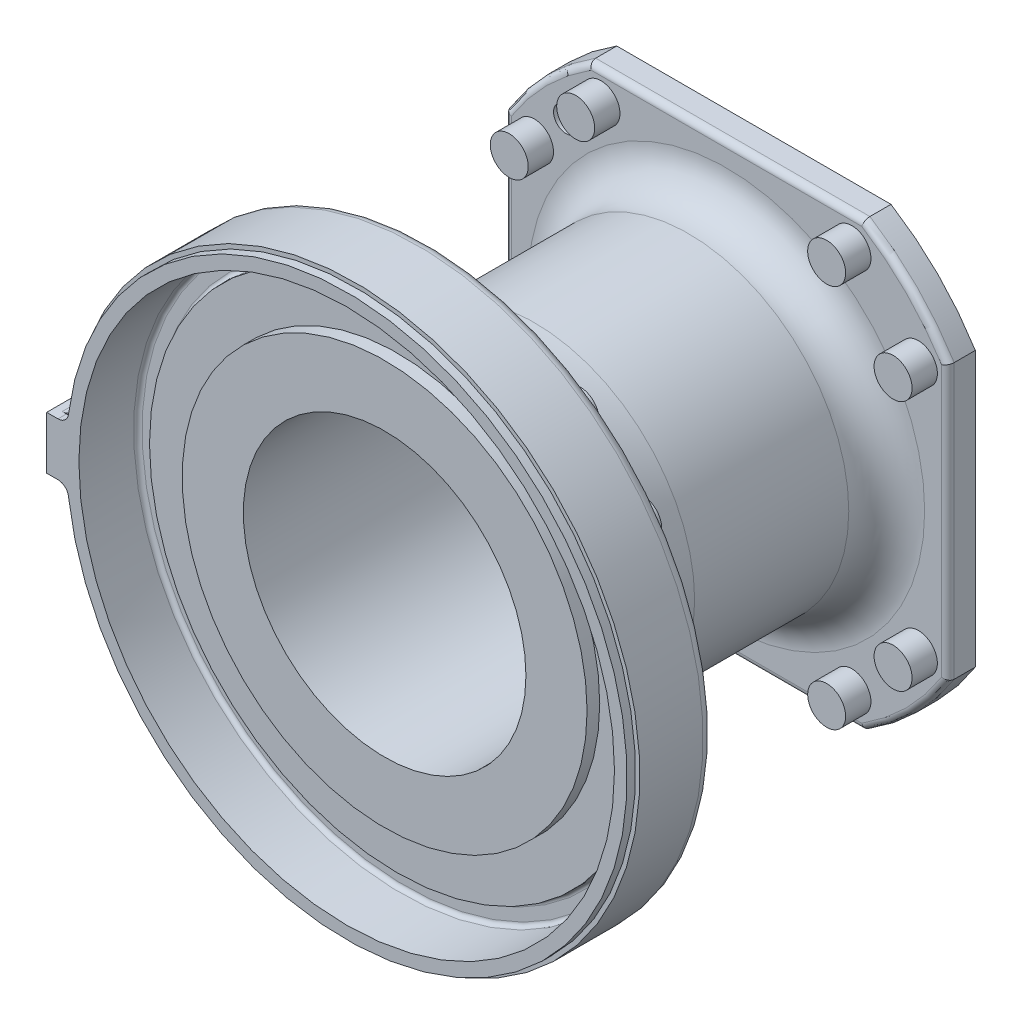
ISO-10303-21;
HEADER;
FILE_DESCRIPTION(('STEP AP214'),'2;1');
FILE_NAME('part.step','',(''),(''),'','','');
FILE_SCHEMA(('AUTOMOTIVE_DESIGN { 1 0 10303 214 1 1 1 1 }'));
ENDSEC;
DATA;
#1=APPLICATION_CONTEXT('core data for automotive mechanical design processes');
#2=APPLICATION_PROTOCOL_DEFINITION('international standard','automotive_design',2000,#1);
#3=PRODUCT_CONTEXT('',#1,'mechanical');
#4=PRODUCT('Part','Part','',(#3));
#5=PRODUCT_RELATED_PRODUCT_CATEGORY('part','',(#4));
#6=PRODUCT_DEFINITION_FORMATION('','',#4);
#7=PRODUCT_DEFINITION_CONTEXT('part definition',#1,'design');
#8=PRODUCT_DEFINITION('design','',#6,#7);
#9=PRODUCT_DEFINITION_SHAPE('','',#8);
#10=(LENGTH_UNIT() NAMED_UNIT(*) SI_UNIT(.MILLI.,.METRE.));
#11=(NAMED_UNIT(*) PLANE_ANGLE_UNIT() SI_UNIT($,.RADIAN.));
#12=(NAMED_UNIT(*) SI_UNIT($,.STERADIAN.) SOLID_ANGLE_UNIT());
#13=UNCERTAINTY_MEASURE_WITH_UNIT(LENGTH_MEASURE(1.E-05),#10,'distance_accuracy_value','');
#14=(GEOMETRIC_REPRESENTATION_CONTEXT(3) GLOBAL_UNCERTAINTY_ASSIGNED_CONTEXT((#13)) GLOBAL_UNIT_ASSIGNED_CONTEXT((#10,
#11,#12)) REPRESENTATION_CONTEXT('',''));
#15=CARTESIAN_POINT('',(0.,0.,0.));
#16=DIRECTION('',(0.,0.,1.));
#17=DIRECTION('',(1.,0.,0.));
#18=AXIS2_PLACEMENT_3D('',#15,#16,#17);
#19=CARTESIAN_POINT('',(0.,0.,0.));
#20=DIRECTION('',(0.,0.,1.));
#21=DIRECTION('',(1.,0.,0.));
#22=AXIS2_PLACEMENT_3D('',#19,#20,#21);
#23=CYLINDRICAL_SURFACE('',#22,67.);
#24=CARTESIAN_POINT('',(0.,0.,-174.08));
#25=DIRECTION('',(0.,0.,1.));
#26=DIRECTION('',(1.,0.,0.));
#27=AXIS2_PLACEMENT_3D('',#24,#25,#26);
#28=CIRCLE('',#27,67.);
#29=CARTESIAN_POINT('',(67.,0.,-174.08));
#30=VERTEX_POINT('',#29);
#31=EDGE_CURVE('E588',#30,#30,#28,.T.);
#32=ORIENTED_EDGE('',*,*,#31,.F.);
#33=EDGE_LOOP('',(#32));
#34=FACE_BOUND('',#33,.T.);
#35=CARTESIAN_POINT('',(0.,0.,6.));
#36=DIRECTION('',(0.,0.,1.));
#37=DIRECTION('',(1.,0.,0.));
#38=AXIS2_PLACEMENT_3D('',#35,#36,#37);
#39=CIRCLE('',#38,67.);
#40=CARTESIAN_POINT('',(67.,0.,6.));
#41=VERTEX_POINT('',#40);
#42=EDGE_CURVE('E2065',#41,#41,#39,.T.);
#43=ORIENTED_EDGE('',*,*,#42,.T.);
#44=EDGE_LOOP('',(#43));
#45=FACE_BOUND('',#44,.T.);
#46=ADVANCED_FACE('F39',(#34,#45),#23,.F.);
#47=CARTESIAN_POINT('',(0.,0.,0.));
#48=DIRECTION('',(0.,0.,1.));
#49=DIRECTION('',(1.,0.,0.));
#50=AXIS2_PLACEMENT_3D('',#47,#48,#49);
#51=CYLINDRICAL_SURFACE('',#50,96.);
#52=CARTESIAN_POINT('',(0.,0.,0.));
#53=DIRECTION('',(0.,0.,1.));
#54=DIRECTION('',(1.,0.,0.));
#55=AXIS2_PLACEMENT_3D('',#52,#53,#54);
#56=CIRCLE('',#55,96.);
#57=CARTESIAN_POINT('',(96.,0.,0.));
#58=VERTEX_POINT('',#57);
#59=EDGE_CURVE('E590',#58,#58,#56,.T.);
#60=ORIENTED_EDGE('',*,*,#59,.T.);
#61=EDGE_LOOP('',(#60));
#62=FACE_BOUND('',#61,.T.);
#63=CARTESIAN_POINT('',(0.,0.,6.));
#64=DIRECTION('',(0.,0.,1.));
#65=DIRECTION('',(1.,0.,0.));
#66=AXIS2_PLACEMENT_3D('',#63,#64,#65);
#67=CIRCLE('',#66,96.);
#68=CARTESIAN_POINT('',(96.,0.,6.));
#69=VERTEX_POINT('',#68);
#70=EDGE_CURVE('E2068',#69,#69,#67,.T.);
#71=ORIENTED_EDGE('',*,*,#70,.F.);
#72=EDGE_LOOP('',(#71));
#73=FACE_BOUND('',#72,.T.);
#74=ADVANCED_FACE('F735',(#62,#73),#51,.T.);
#75=CARTESIAN_POINT('',(87.5,0.,-169.08));
#76=DIRECTION('',(0.,0.,1.));
#77=DIRECTION('',(1.,0.,0.));
#78=AXIS2_PLACEMENT_3D('',#75,#76,#77);
#79=PLANE('',#78);
#80=CARTESIAN_POINT('',(0.,0.,-169.08));
#81=DIRECTION('',(0.,0.,1.));
#82=DIRECTION('',(1.,0.,0.));
#83=AXIS2_PLACEMENT_3D('',#80,#81,#82);
#84=CIRCLE('',#83,87.5);
#85=CARTESIAN_POINT('',(87.5,0.,-169.08));
#86=VERTEX_POINT('',#85);
#87=EDGE_CURVE('E2034',#86,#86,#84,.T.);
#88=ORIENTED_EDGE('',*,*,#87,.T.);
#89=EDGE_LOOP('',(#88));
#90=FACE_BOUND('',#89,.T.);
#91=DIRECTION('',(0.,1.,0.));
#92=VECTOR('',#91,1.);
#93=CARTESIAN_POINT('',(105.,65.0173053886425,-169.08));
#94=LINE('',#93,#92);
#95=CARTESIAN_POINT('',(105.,-65.0173053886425,-169.08));
#96=VERTEX_POINT('',#95);
#97=CARTESIAN_POINT('',(105.,65.0173053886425,-169.08));
#98=VERTEX_POINT('',#97);
#99=EDGE_CURVE('E581',#96,#98,#94,.T.);
#100=ORIENTED_EDGE('',*,*,#99,.F.);
#101=CARTESIAN_POINT('',(0.,0.,-169.08));
#102=DIRECTION('',(0.,0.,1.));
#103=DIRECTION('',(1.,0.,0.));
#104=AXIS2_PLACEMENT_3D('',#101,#102,#103);
#105=CIRCLE('',#104,123.5);
#106=CARTESIAN_POINT('',(65.0173053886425,-105.,-169.08));
#107=VERTEX_POINT('',#106);
#108=EDGE_CURVE('E987',#107,#96,#105,.T.);
#109=ORIENTED_EDGE('',*,*,#108,.F.);
#110=DIRECTION('',(1.,0.,0.));
#111=VECTOR('',#110,1.);
#112=CARTESIAN_POINT('',(65.0173053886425,-105.,-169.08));
#113=LINE('',#112,#111);
#114=CARTESIAN_POINT('',(-65.0173053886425,-105.,-169.08));
#115=VERTEX_POINT('',#114);
#116=EDGE_CURVE('E2095',#115,#107,#113,.T.);
#117=ORIENTED_EDGE('',*,*,#116,.F.);
#118=CARTESIAN_POINT('',(0.,0.,-169.08));
#119=DIRECTION('',(0.,0.,1.));
#120=DIRECTION('',(1.,0.,0.));
#121=AXIS2_PLACEMENT_3D('',#118,#119,#120);
#122=CIRCLE('',#121,123.5);
#123=CARTESIAN_POINT('',(-105.,-65.0173053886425,-169.08));
#124=VERTEX_POINT('',#123);
#125=EDGE_CURVE('E996',#124,#115,#122,.T.);
#126=ORIENTED_EDGE('',*,*,#125,.F.);
#127=DIRECTION('',(0.,-1.,0.));
#128=VECTOR('',#127,1.);
#129=CARTESIAN_POINT('',(-105.,65.0173053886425,-169.08));
#130=LINE('',#129,#128);
#131=CARTESIAN_POINT('',(-105.,65.0173053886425,-169.08));
#132=VERTEX_POINT('',#131);
#133=EDGE_CURVE('E2091',#132,#124,#130,.T.);
#134=ORIENTED_EDGE('',*,*,#133,.F.);
#135=CARTESIAN_POINT('',(0.,0.,-169.08));
#136=DIRECTION('',(0.,0.,1.));
#137=DIRECTION('',(1.,0.,0.));
#138=AXIS2_PLACEMENT_3D('',#135,#136,#137);
#139=CIRCLE('',#138,123.5);
#140=CARTESIAN_POINT('',(-65.0173053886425,105.,-169.08));
#141=VERTEX_POINT('',#140);
#142=EDGE_CURVE('E605',#141,#132,#139,.T.);
#143=ORIENTED_EDGE('',*,*,#142,.F.);
#144=DIRECTION('',(-1.,0.,0.));
#145=VECTOR('',#144,1.);
#146=CARTESIAN_POINT('',(65.0173053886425,105.,-169.08));
#147=LINE('',#146,#145);
#148=CARTESIAN_POINT('',(65.0173053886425,105.,-169.08));
#149=VERTEX_POINT('',#148);
#150=EDGE_CURVE('E598',#149,#141,#147,.T.);
#151=ORIENTED_EDGE('',*,*,#150,.F.);
#152=CARTESIAN_POINT('',(0.,0.,-169.08));
#153=DIRECTION('',(0.,0.,1.));
#154=DIRECTION('',(1.,0.,0.));
#155=AXIS2_PLACEMENT_3D('',#152,#153,#154);
#156=CIRCLE('',#155,123.5);
#157=EDGE_CURVE('E591',#98,#149,#156,.T.);
#158=ORIENTED_EDGE('',*,*,#157,.F.);
#159=EDGE_LOOP('',(#100,#109,#117,#126,#134,#143,#151,#158));
#160=FACE_BOUND('',#159,.T.);
#161=CARTESIAN_POINT('',(-76.,76.,-169.08));
#162=DIRECTION('',(0.,0.,-1.));
#163=DIRECTION('',(-1.,0.,0.));
#164=AXIS2_PLACEMENT_3D('',#161,#162,#163);
#165=CIRCLE('',#164,6.);
#166=CARTESIAN_POINT('',(-82.,76.,-169.08));
#167=VERTEX_POINT('',#166);
#168=EDGE_CURVE('E2038',#167,#167,#165,.T.);
#169=ORIENTED_EDGE('',*,*,#168,.F.);
#170=EDGE_LOOP('',(#169));
#171=FACE_BOUND('',#170,.T.);
#172=ADVANCED_FACE('F1611',(#90,#160,#171),#79,.F.);
#173=CARTESIAN_POINT('',(96.,0.,0.));
#174=DIRECTION('',(0.,0.,-1.));
#175=DIRECTION('',(-1.,0.,0.));
#176=AXIS2_PLACEMENT_3D('',#173,#174,#175);
#177=PLANE('',#176);
#178=ORIENTED_EDGE('',*,*,#59,.F.);
#179=EDGE_LOOP('',(#178));
#180=FACE_BOUND('',#179,.T.);
#181=CARTESIAN_POINT('',(0.,0.,0.));
#182=DIRECTION('',(0.,0.,-1.));
#183=DIRECTION('',(-1.,0.,0.));
#184=AXIS2_PLACEMENT_3D('',#181,#182,#183);
#185=CIRCLE('',#184,117.5);
#186=CARTESIAN_POINT('',(-117.5,0.,0.));
#187=VERTEX_POINT('',#186);
#188=EDGE_CURVE('E583',#187,#187,#185,.F.);
#189=ORIENTED_EDGE('',*,*,#188,.T.);
#190=EDGE_LOOP('',(#189));
#191=FACE_BOUND('',#190,.T.);
#192=CARTESIAN_POINT('',(0.,107.5,0.));
#193=DIRECTION('',(0.,0.,1.));
#194=DIRECTION('',(1.,0.,0.));
#195=AXIS2_PLACEMENT_3D('',#192,#193,#194);
#196=CIRCLE('',#195,6.5);
#197=CARTESIAN_POINT('',(6.5,107.5,0.));
#198=VERTEX_POINT('',#197);
#199=EDGE_CURVE('E333',#198,#198,#196,.T.);
#200=ORIENTED_EDGE('',*,*,#199,.F.);
#201=EDGE_LOOP('',(#200));
#202=FACE_BOUND('',#201,.T.);
#203=ADVANCED_FACE('F746',(#180,#191,#202),#177,.F.);
#204=CARTESIAN_POINT('',(135.,0.,-15.));
#205=DIRECTION('',(0.,0.,-1.));
#206=DIRECTION('',(-1.,0.,0.));
#207=AXIS2_PLACEMENT_3D('',#204,#205,#206);
#208=PLANE('',#207);
#209=CARTESIAN_POINT('',(-20.9722096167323,105.434417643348,-15.));
#210=DIRECTION('',(0.,0.,-1.));
#211=DIRECTION('',(-1.,0.,0.));
#212=AXIS2_PLACEMENT_3D('',#209,#210,#211);
#213=CIRCLE('',#212,9.);
#214=CARTESIAN_POINT('',(-29.9722096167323,105.434417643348,-15.));
#215=VERTEX_POINT('',#214);
#216=EDGE_CURVE('E879',#215,#215,#213,.T.);
#217=ORIENTED_EDGE('',*,*,#216,.F.);
#218=EDGE_LOOP('',(#217));
#219=FACE_BOUND('',#218,.T.);
#220=CARTESIAN_POINT('',(-59.7238000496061,89.3829833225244,-15.));
#221=DIRECTION('',(0.,0.,-1.));
#222=DIRECTION('',(-1.,0.,0.));
#223=AXIS2_PLACEMENT_3D('',#220,#221,#222);
#224=CIRCLE('',#223,9.);
#225=CARTESIAN_POINT('',(-68.7238000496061,89.3829833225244,-15.));
#226=VERTEX_POINT('',#225);
#227=EDGE_CURVE('E876',#226,#226,#224,.T.);
#228=ORIENTED_EDGE('',*,*,#227,.F.);
#229=EDGE_LOOP('',(#228));
#230=FACE_BOUND('',#229,.T.);
#231=CARTESIAN_POINT('',(-89.3829833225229,59.7238000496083,-15.));
#232=DIRECTION('',(0.,0.,-1.));
#233=DIRECTION('',(-1.,0.,0.));
#234=AXIS2_PLACEMENT_3D('',#231,#232,#233);
#235=CIRCLE('',#234,9.);
#236=CARTESIAN_POINT('',(-98.3829833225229,59.7238000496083,-15.));
#237=VERTEX_POINT('',#236);
#238=EDGE_CURVE('E873',#237,#237,#235,.T.);
#239=ORIENTED_EDGE('',*,*,#238,.F.);
#240=EDGE_LOOP('',(#239));
#241=FACE_BOUND('',#240,.T.);
#242=CARTESIAN_POINT('',(-105.434417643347,20.972209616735,-15.));
#243=DIRECTION('',(0.,0.,-1.));
#244=DIRECTION('',(-1.,0.,0.));
#245=AXIS2_PLACEMENT_3D('',#242,#243,#244);
#246=CIRCLE('',#245,9.);
#247=CARTESIAN_POINT('',(-114.434417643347,20.972209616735,-15.));
#248=VERTEX_POINT('',#247);
#249=EDGE_CURVE('E870',#248,#248,#246,.T.);
#250=ORIENTED_EDGE('',*,*,#249,.F.);
#251=EDGE_LOOP('',(#250));
#252=FACE_BOUND('',#251,.T.);
#253=CARTESIAN_POINT('',(-105.434417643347,-20.9722096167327,-15.));
#254=DIRECTION('',(0.,0.,-1.));
#255=DIRECTION('',(-1.,0.,0.));
#256=AXIS2_PLACEMENT_3D('',#253,#254,#255);
#257=CIRCLE('',#256,9.);
#258=CARTESIAN_POINT('',(-114.434417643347,-20.9722096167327,-15.));
#259=VERTEX_POINT('',#258);
#260=EDGE_CURVE('E867',#259,#259,#257,.T.);
#261=ORIENTED_EDGE('',*,*,#260,.F.);
#262=EDGE_LOOP('',(#261));
#263=FACE_BOUND('',#262,.T.);
#264=CARTESIAN_POINT('',(-89.3829833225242,-59.7238000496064,-15.));
#265=DIRECTION('',(0.,0.,-1.));
#266=DIRECTION('',(-1.,0.,0.));
#267=AXIS2_PLACEMENT_3D('',#264,#265,#266);
#268=CIRCLE('',#267,9.);
#269=CARTESIAN_POINT('',(-98.3829833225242,-59.7238000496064,-15.));
#270=VERTEX_POINT('',#269);
#271=EDGE_CURVE('E864',#270,#270,#268,.T.);
#272=ORIENTED_EDGE('',*,*,#271,.F.);
#273=EDGE_LOOP('',(#272));
#274=FACE_BOUND('',#273,.T.);
#275=CARTESIAN_POINT('',(-59.723800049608,-89.3829833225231,-15.));
#276=DIRECTION('',(0.,0.,-1.));
#277=DIRECTION('',(-1.,0.,0.));
#278=AXIS2_PLACEMENT_3D('',#275,#276,#277);
#279=CIRCLE('',#278,9.);
#280=CARTESIAN_POINT('',(-68.723800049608,-89.3829833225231,-15.));
#281=VERTEX_POINT('',#280);
#282=EDGE_CURVE('E861',#281,#281,#279,.T.);
#283=ORIENTED_EDGE('',*,*,#282,.F.);
#284=EDGE_LOOP('',(#283));
#285=FACE_BOUND('',#284,.T.);
#286=CARTESIAN_POINT('',(-20.9722096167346,-105.434417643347,-15.));
#287=DIRECTION('',(0.,0.,-1.));
#288=DIRECTION('',(-1.,0.,0.));
#289=AXIS2_PLACEMENT_3D('',#286,#287,#288);
#290=CIRCLE('',#289,9.);
#291=CARTESIAN_POINT('',(-29.9722096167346,-105.434417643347,-15.));
#292=VERTEX_POINT('',#291);
#293=EDGE_CURVE('E858',#292,#292,#290,.T.);
#294=ORIENTED_EDGE('',*,*,#293,.F.);
#295=EDGE_LOOP('',(#294));
#296=FACE_BOUND('',#295,.T.);
#297=CARTESIAN_POINT('',(20.9722096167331,-105.434417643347,-15.));
#298=DIRECTION('',(0.,0.,-1.));
#299=DIRECTION('',(-1.,0.,0.));
#300=AXIS2_PLACEMENT_3D('',#297,#298,#299);
#301=CIRCLE('',#300,9.);
#302=CARTESIAN_POINT('',(11.9722096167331,-105.434417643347,-15.));
#303=VERTEX_POINT('',#302);
#304=EDGE_CURVE('E855',#303,#303,#301,.T.);
#305=ORIENTED_EDGE('',*,*,#304,.F.);
#306=EDGE_LOOP('',(#305));
#307=FACE_BOUND('',#306,.T.);
#308=CARTESIAN_POINT('',(59.7238000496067,-89.382983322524,-15.));
#309=DIRECTION('',(0.,0.,-1.));
#310=DIRECTION('',(-1.,0.,0.));
#311=AXIS2_PLACEMENT_3D('',#308,#309,#310);
#312=CIRCLE('',#311,9.);
#313=CARTESIAN_POINT('',(50.7238000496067,-89.382983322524,-15.));
#314=VERTEX_POINT('',#313);
#315=EDGE_CURVE('E852',#314,#314,#312,.T.);
#316=ORIENTED_EDGE('',*,*,#315,.F.);
#317=EDGE_LOOP('',(#316));
#318=FACE_BOUND('',#317,.T.);
#319=CARTESIAN_POINT('',(89.3829833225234,-59.7238000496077,-15.));
#320=DIRECTION('',(0.,0.,-1.));
#321=DIRECTION('',(-1.,0.,0.));
#322=AXIS2_PLACEMENT_3D('',#319,#320,#321);
#323=CIRCLE('',#322,9.);
#324=CARTESIAN_POINT('',(80.3829833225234,-59.7238000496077,-15.));
#325=VERTEX_POINT('',#324);
#326=EDGE_CURVE('E849',#325,#325,#323,.T.);
#327=ORIENTED_EDGE('',*,*,#326,.F.);
#328=EDGE_LOOP('',(#327));
#329=FACE_BOUND('',#328,.T.);
#330=CARTESIAN_POINT('',(105.434417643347,-20.9722096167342,-15.));
#331=DIRECTION('',(0.,0.,-1.));
#332=DIRECTION('',(-1.,0.,0.));
#333=AXIS2_PLACEMENT_3D('',#330,#331,#332);
#334=CIRCLE('',#333,9.);
#335=CARTESIAN_POINT('',(96.4344176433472,-20.9722096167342,-15.));
#336=VERTEX_POINT('',#335);
#337=EDGE_CURVE('E846',#336,#336,#334,.T.);
#338=ORIENTED_EDGE('',*,*,#337,.F.);
#339=EDGE_LOOP('',(#338));
#340=FACE_BOUND('',#339,.T.);
#341=CARTESIAN_POINT('',(105.434417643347,20.9722096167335,-15.));
#342=DIRECTION('',(0.,0.,-1.));
#343=DIRECTION('',(-1.,0.,0.));
#344=AXIS2_PLACEMENT_3D('',#341,#342,#343);
#345=CIRCLE('',#344,9.);
#346=CARTESIAN_POINT('',(96.4344176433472,20.9722096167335,-15.));
#347=VERTEX_POINT('',#346);
#348=EDGE_CURVE('E843',#347,#347,#345,.T.);
#349=ORIENTED_EDGE('',*,*,#348,.F.);
#350=EDGE_LOOP('',(#349));
#351=FACE_BOUND('',#350,.T.);
#352=CARTESIAN_POINT('',(89.3829833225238,59.7238000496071,-15.));
#353=DIRECTION('',(0.,0.,-1.));
#354=DIRECTION('',(-1.,0.,0.));
#355=AXIS2_PLACEMENT_3D('',#352,#353,#354);
#356=CIRCLE('',#355,9.);
#357=CARTESIAN_POINT('',(80.3829833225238,59.7238000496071,-15.));
#358=VERTEX_POINT('',#357);
#359=EDGE_CURVE('E840',#358,#358,#356,.T.);
#360=ORIENTED_EDGE('',*,*,#359,.F.);
#361=EDGE_LOOP('',(#360));
#362=FACE_BOUND('',#361,.T.);
#363=CARTESIAN_POINT('',(59.7238000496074,89.3829833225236,-15.));
#364=DIRECTION('',(0.,0.,-1.));
#365=DIRECTION('',(-1.,0.,0.));
#366=AXIS2_PLACEMENT_3D('',#363,#364,#365);
#367=CIRCLE('',#366,9.);
#368=CARTESIAN_POINT('',(50.7238000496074,89.3829833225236,-15.));
#369=VERTEX_POINT('',#368);
#370=EDGE_CURVE('E337',#369,#369,#367,.T.);
#371=ORIENTED_EDGE('',*,*,#370,.F.);
#372=EDGE_LOOP('',(#371));
#373=FACE_BOUND('',#372,.T.);
#374=DIRECTION('',(0.,-1.,0.));
#375=VECTOR('',#374,1.);
#376=CARTESIAN_POINT('',(-137.,0.,-15.));
#377=LINE('',#376,#375);
#378=CARTESIAN_POINT('',(-137.,12.5223855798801,-15.));
#379=VERTEX_POINT('',#378);
#380=CARTESIAN_POINT('',(-137.,-12.52238557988,-15.));
#381=VERTEX_POINT('',#380);
#382=EDGE_CURVE('E2117',#379,#381,#377,.T.);
#383=ORIENTED_EDGE('',*,*,#382,.F.);
#384=CARTESIAN_POINT('',(-138.682831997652,12.5,-7.92622245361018));
#385=CARTESIAN_POINT('',(-134.359501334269,12.5,-8.84997649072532));
#386=CARTESIAN_POINT('',(-133.830010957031,16.8876360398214,-8.96311122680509));
#387=CARTESIAN_POINT('',(-138.755586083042,12.5,-8.26655961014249));
#388=CARTESIAN_POINT('',(-134.403565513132,12.5,-9.03794347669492));
#389=CARTESIAN_POINT('',(-133.866917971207,16.8834353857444,-9.13327980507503));
#390=CARTESIAN_POINT('',(-138.810342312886,12.5,-8.61058013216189));
#391=CARTESIAN_POINT('',(-134.436770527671,12.5,-9.22858439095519));
#392=CARTESIAN_POINT('',(-133.894694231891,16.8802776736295,-9.30529006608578));
#393=CARTESIAN_POINT('',(-138.883556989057,12.5,-9.30301006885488));
#394=CARTESIAN_POINT('',(-134.481181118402,12.5,-9.61274948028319));
#395=CARTESIAN_POINT('',(-133.931833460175,16.8760579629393,-9.65150503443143));
#396=CARTESIAN_POINT('',(-138.901958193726,12.5,-9.65142553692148));
#397=CARTESIAN_POINT('',(-134.492368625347,12.5,-9.80634883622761));
#398=CARTESIAN_POINT('',(-133.941167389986,16.8749992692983,-9.82571276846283));
#399=CARTESIAN_POINT('',(-138.901920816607,12.5,-10.5585381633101));
#400=CARTESIAN_POINT('',(-134.492341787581,12.5,-10.3102969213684));
#401=CARTESIAN_POINT('',(-133.941148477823,16.8750011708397,-10.2792690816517));
#402=CARTESIAN_POINT('',(-138.854615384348,12.5,-11.1174845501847));
#403=CARTESIAN_POINT('',(-134.463570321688,12.5,-10.6209705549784));
#404=CARTESIAN_POINT('',(-133.91715308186,16.8777224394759,-10.5587422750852));
#405=CARTESIAN_POINT('',(-138.666688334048,12.5,-12.2195814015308));
#406=CARTESIAN_POINT('',(-134.349668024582,12.5,-11.2310990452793));
#407=CARTESIAN_POINT('',(-133.821822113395,16.8885650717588,-11.1097907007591));
#408=CARTESIAN_POINT('',(-138.526010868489,12.5,-12.7627222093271));
#409=CARTESIAN_POINT('',(-134.264394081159,12.5,-11.5308300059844));
#410=CARTESIAN_POINT('',(-133.750458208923,16.8966896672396,-11.3813611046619));
#411=CARTESIAN_POINT('',(-138.155556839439,12.5,-13.8175087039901));
#412=CARTESIAN_POINT('',(-134.041011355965,12.5,-12.1084450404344));
#413=CARTESIAN_POINT('',(-133.562511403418,16.918190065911,-11.9087543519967));
#414=CARTESIAN_POINT('',(-137.925817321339,12.5,-14.3291673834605));
#415=CARTESIAN_POINT('',(-133.902716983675,12.5,-12.3865698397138));
#416=CARTESIAN_POINT('',(-133.445947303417,16.9315636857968,-12.1645836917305));
#417=CARTESIAN_POINT('',(-137.383994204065,12.5,-15.3067663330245));
#418=CARTESIAN_POINT('',(-133.578831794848,12.5,-12.9116048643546));
#419=CARTESIAN_POINT('',(-133.170998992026,16.9633166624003,-12.6533831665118));
#420=CARTESIAN_POINT('',(-137.071916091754,12.5,-15.772709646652));
#421=CARTESIAN_POINT('',(-133.392960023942,12.5,-13.158668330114));
#422=CARTESIAN_POINT('',(-133.012617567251,16.9816956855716,-12.8863548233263));
#423=CARTESIAN_POINT('',(-136.373295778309,12.5,-16.6474955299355));
#424=CARTESIAN_POINT('',(-132.9805213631,12.5,-13.6143432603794));
#425=CARTESIAN_POINT('',(-132.657997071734,17.0231839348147,-13.3237477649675));
#426=CARTESIAN_POINT('',(-135.986509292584,12.5,-17.0561429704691));
#427=CARTESIAN_POINT('',(-132.753490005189,12.5,-13.8228717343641));
#428=CARTESIAN_POINT('',(-132.461633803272,17.0463086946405,-13.528071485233));
#429=CARTESIAN_POINT('',(-135.150255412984,12.5,-17.8033066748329));
#430=CARTESIAN_POINT('',(-132.2679265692,12.5,-14.1941155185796));
#431=CARTESIAN_POINT('',(-132.036989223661,17.0967991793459,-13.9016533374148));
#432=CARTESIAN_POINT('',(-134.700783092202,12.5,-18.1418174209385));
#433=CARTESIAN_POINT('',(-132.009046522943,12.5,-14.356764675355));
#434=CARTESIAN_POINT('',(-131.808705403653,17.1241652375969,-14.0709087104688));
#435=CARTESIAN_POINT('',(-133.748332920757,12.5,-18.7418279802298));
#436=CARTESIAN_POINT('',(-131.467523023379,12.5,-14.6329464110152));
#437=CARTESIAN_POINT('',(-131.324835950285,17.1827979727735,-14.3709139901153));
#438=CARTESIAN_POINT('',(-133.244977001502,12.5,-19.0027275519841));
#439=CARTESIAN_POINT('',(-131.18440199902,12.5,-14.7459159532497));
#440=CARTESIAN_POINT('',(-131.069057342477,17.2140925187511,-14.5013637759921));
#441=CARTESIAN_POINT('',(-132.201897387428,12.5,-19.4370355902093));
#442=CARTESIAN_POINT('',(-130.606671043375,12.5,-14.9187108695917));
#443=CARTESIAN_POINT('',(-130.538863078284,17.2797294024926,-14.7185177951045));
#444=CARTESIAN_POINT('',(-131.662176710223,12.5,-19.6104513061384));
#445=CARTESIAN_POINT('',(-130.311803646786,12.5,-14.978262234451));
#446=CARTESIAN_POINT('',(-130.264448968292,17.3140714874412,-14.8052256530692));
#447=CARTESIAN_POINT('',(-130.557182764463,12.5,-19.8663067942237));
#448=CARTESIAN_POINT('',(-129.718786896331,12.5,-15.0445846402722));
#449=CARTESIAN_POINT('',(-129.702447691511,17.385278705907,-14.9331533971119));
#450=CARTESIAN_POINT('',(-129.991741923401,12.5,-19.9480203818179));
#451=CARTESIAN_POINT('',(-129.420485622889,12.5,-15.050577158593));
#452=CARTESIAN_POINT('',(-129.414773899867,17.4221615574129,-14.9740101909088));
#453=CARTESIAN_POINT('',(-128.854750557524,12.5,-20.015824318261));
#454=CARTESIAN_POINT('',(-128.832974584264,12.5,-15.010943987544));
#455=CARTESIAN_POINT('',(-128.83611772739,17.4973041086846,-15.0079121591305));
#456=CARTESIAN_POINT('',(-128.283198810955,12.5,-20.0018951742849));
#457=CARTESIAN_POINT('',(-128.543730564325,12.5,-14.96491287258));
#458=CARTESIAN_POINT('',(-128.545134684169,17.5355640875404,-15.0009475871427));
#459=CARTESIAN_POINT('',(-127.432910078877,12.5,-19.9096311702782));
#460=CARTESIAN_POINT('',(-128.124144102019,12.5,-14.8606251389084));
#461=CARTESIAN_POINT('',(-128.112089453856,17.59322628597,-14.954815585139));
#462=CARTESIAN_POINT('',(-127.149892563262,12.5,-19.866766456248));
#463=CARTESIAN_POINT('',(-127.985918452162,12.5,-14.8196564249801));
#464=CARTESIAN_POINT('',(-127.967924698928,17.6125453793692,-14.9333832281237));
#465=CARTESIAN_POINT('',(-126.588387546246,12.5,-19.7573680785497));
#466=CARTESIAN_POINT('',(-127.715085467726,12.5,-14.7265086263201));
#467=CARTESIAN_POINT('',(-127.68185110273,17.651121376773,-14.8786840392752));
#468=CARTESIAN_POINT('',(-126.309900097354,12.5,-19.6908341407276));
#469=CARTESIAN_POINT('',(-127.582499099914,12.5,-14.6742843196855));
#470=CARTESIAN_POINT('',(-127.53994228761,17.6703782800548,-14.845417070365));
#471=CARTESIAN_POINT('',(-125.759348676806,12.5,-19.5344810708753));
#472=CARTESIAN_POINT('',(-127.323839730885,12.5,-14.5594024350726));
#473=CARTESIAN_POINT('',(-127.259346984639,17.7086898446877,-14.767240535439));
#474=CARTESIAN_POINT('',(-125.487289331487,12.5,-19.4446456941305));
#475=CARTESIAN_POINT('',(-127.197800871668,12.5,-14.4966973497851));
#476=CARTESIAN_POINT('',(-127.120662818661,17.7277443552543,-14.7223228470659));
#477=CARTESIAN_POINT('',(-124.951697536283,12.5,-19.2423539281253));
#478=CARTESIAN_POINT('',(-126.953074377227,12.5,-14.3617739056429));
#479=CARTESIAN_POINT('',(-126.847592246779,17.7654871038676,-14.6211769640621));
#480=CARTESIAN_POINT('',(-124.688165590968,12.5,-19.1298962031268));
#481=CARTESIAN_POINT('',(-126.834423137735,12.5,-14.2895207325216));
#482=CARTESIAN_POINT('',(-126.713206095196,17.784175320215,-14.5649481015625));
#483=CARTESIAN_POINT('',(-124.429864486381,12.5,-19.006453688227));
#484=CARTESIAN_POINT('',(-126.720068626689,12.5,-14.2131310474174));
#485=CARTESIAN_POINT('',(-126.58146360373,17.8026040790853,-14.5032268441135));
#486=(BOUNDED_SURFACE() B_SPLINE_SURFACE(3,2,((#384,#385,#386),(#387,#388,#389),(#390,#391,
#392),(#393,#394,#395),(#396,#397,#398),(#399,#400,#401),(#402,#403,#404),(#405,#406,#407),
(#408,#409,#410),(#411,#412,#413),(#414,#415,#416),(#417,#418,#419),(#420,#421,#422),(#423,#424,
#425),(#426,#427,#428),(#429,#430,#431),(#432,#433,#434),(#435,#436,#437),(#438,#439,#440),
(#441,#442,#443),(#444,#445,#446),(#447,#448,#449),(#450,#451,#452),(#453,#454,#455),(#456,#457,
#458),(#459,#460,#461),(#462,#463,#464),(#465,#466,#467),(#468,#469,#470),(#471,#472,#473),
(#474,#475,#476),(#477,#478,#479),(#480,#481,#482),(#483,#484,#485)),.UNSPECIFIED.,.F.,.F.,
.F.) B_SPLINE_SURFACE_WITH_KNOTS((4,2,2,2,2,2,2,2,2,2,2,2,2,2,2,2,4),(3,3),(0.,1.04328534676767,
2.08821206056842,3.76254999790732,5.43789029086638,7.11253447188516,8.78706708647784,
10.4671708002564,12.1474066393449,13.8403182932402,15.5330896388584,17.2391733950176,
18.945604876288,19.8035063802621,20.6614178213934,21.5199289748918,22.3784908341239),(0.,1.),
.UNSPECIFIED.) GEOMETRIC_REPRESENTATION_ITEM() RATIONAL_B_SPLINE_SURFACE(((1.,0.749157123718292,
1.),(1.,0.749437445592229,1.),(1.,0.749648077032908,1.),(1.,0.749929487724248,1.),(1.,
0.750000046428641,1.),(1.,0.749999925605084,1.),(1.,0.749818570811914,1.),(1.,0.749095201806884,
1.),(1.,0.748552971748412,1.),(1.,0.747115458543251,1.),(1.,0.74622032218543,1.),(1.,
0.744089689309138,1.),(1.,0.742854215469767,1.),(1.,0.740056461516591,1.),(1.,0.738493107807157,
1.),(1.,0.735066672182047,1.),(1.,0.733203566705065,1.),(1.,0.72919424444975,1.),(1.,
0.727045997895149,1.),(1.,0.7225179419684,1.),(1.,0.7201381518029,1.),(1.,0.715177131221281,1.),
(1.,0.712594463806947,1.),(1.,0.707302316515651,1.),(1.,0.704592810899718,1.),(1.,
0.700485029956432,1.),(1.,0.699104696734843,1.),(1.,0.696340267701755,1.),(1.,0.694956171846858,
1.),(1.,0.692194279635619,1.),(1.,0.690816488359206,1.),(1.,0.688079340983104,1.),(1.,
0.686719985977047,1.),(1.,0.685375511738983,1.))) REPRESENTATION_ITEM('') SURFACE());
#487=CARTESIAN_POINT('',(-137.55150326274,12.5,-15.));
#488=CARTESIAN_POINT('',(-137.337293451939,12.4999709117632,-15.));
#489=CARTESIAN_POINT('',(-137.123209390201,12.5102773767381,-15.));
#490=CARTESIAN_POINT('',(-136.697151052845,12.5501299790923,-15.));
#491=CARTESIAN_POINT('',(-136.485174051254,12.5796466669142,-15.));
#492=CARTESIAN_POINT('',(-136.067097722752,12.6560265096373,-15.));
#493=CARTESIAN_POINT('',(-135.860958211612,12.7026729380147,-15.));
#494=CARTESIAN_POINT('',(-135.452875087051,12.8118842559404,-15.));
#495=CARTESIAN_POINT('',(-135.250933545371,12.8744568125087,-15.));
#496=CARTESIAN_POINT('',(-134.774041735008,13.041307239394,-15.));
#497=CARTESIAN_POINT('',(-134.501441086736,13.1523237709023,-15.));
#498=CARTESIAN_POINT('',(-133.967243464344,13.3981624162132,-15.));
#499=CARTESIAN_POINT('',(-133.705650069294,13.5329922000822,-15.));
#500=CARTESIAN_POINT('',(-133.192467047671,13.8231654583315,-15.));
#501=CARTESIAN_POINT('',(-132.940933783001,13.9786078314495,-15.));
#502=CARTESIAN_POINT('',(-132.448673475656,14.3058469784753,-15.));
#503=CARTESIAN_POINT('',(-132.20795147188,14.4776512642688,-15.));
#504=CARTESIAN_POINT('',(-131.690237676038,14.8688576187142,-15.));
#505=CARTESIAN_POINT('',(-131.415335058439,15.0910055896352,-15.));
#506=CARTESIAN_POINT('',(-130.876692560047,15.5483111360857,-15.));
#507=CARTESIAN_POINT('',(-130.612953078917,15.7834691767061,-15.));
#508=CARTESIAN_POINT('',(-129.834032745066,16.5008350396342,-15.));
#509=CARTESIAN_POINT('',(-129.330471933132,16.9954829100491,-15.));
#510=CARTESIAN_POINT('',(-128.82358009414,17.4932732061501,-15.));
#511=CARTESIAN_POINT('',(-128.820155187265,17.496636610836,-15.));
#512=CARTESIAN_POINT('',(-128.816730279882,17.5,-15.));
#513=B_SPLINE_CURVE_WITH_KNOTS('',3,(#487,#488,#489,#490,#491,#492,#493,#494,#495,#496,#497,
#498,#499,#500,#501,#502,#503,#504,#505,#506,#507,#508,#509,#510,#511,#512),.UNSPECIFIED.,.F.,
.F.,(4,2,2,2,2,2,2,2,2,2,2,2,4),(0.,0.642197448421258,1.28341271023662,1.91678007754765,
2.55045293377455,3.43206347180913,4.31395848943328,5.20024922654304,6.08694884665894,
7.14668300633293,8.2064550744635,10.3233898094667,10.3377905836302),.UNSPECIFIED.);
#514=CARTESIAN_POINT('',(-128.816730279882,17.5,-15.));
#515=VERTEX_POINT('',#514);
#516=EDGE_CURVE('E757',#379,#515,#513,.T.);
#517=ORIENTED_EDGE('',*,*,#516,.T.);
#518=CARTESIAN_POINT('',(0.,0.,-15.));
#519=DIRECTION('',(0.,0.,-1.));
#520=DIRECTION('',(-1.,0.,0.));
#521=AXIS2_PLACEMENT_3D('',#518,#519,#520);
#522=CIRCLE('',#521,130.);
#523=CARTESIAN_POINT('',(-128.816730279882,-17.5,-15.));
#524=VERTEX_POINT('',#523);
#525=EDGE_CURVE('E666',#515,#524,#522,.T.);
#526=ORIENTED_EDGE('',*,*,#525,.T.);
#527=CARTESIAN_POINT('',(-133.830010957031,-16.8876360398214,-8.96311122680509));
#528=CARTESIAN_POINT('',(-134.359501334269,-12.5,-8.84997649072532));
#529=CARTESIAN_POINT('',(-138.682831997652,-12.5,-7.92622245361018));
#530=CARTESIAN_POINT('',(-133.866917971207,-16.8834353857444,-9.13327980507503));
#531=CARTESIAN_POINT('',(-134.403565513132,-12.5,-9.03794347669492));
#532=CARTESIAN_POINT('',(-138.755586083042,-12.5,-8.26655961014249));
#533=CARTESIAN_POINT('',(-133.894694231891,-16.8802776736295,-9.30529006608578));
#534=CARTESIAN_POINT('',(-134.436770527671,-12.5,-9.22858439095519));
#535=CARTESIAN_POINT('',(-138.810342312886,-12.5,-8.61058013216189));
#536=CARTESIAN_POINT('',(-133.931833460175,-16.8760579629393,-9.65150503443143));
#537=CARTESIAN_POINT('',(-134.481181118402,-12.5,-9.61274948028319));
#538=CARTESIAN_POINT('',(-138.883556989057,-12.5,-9.30301006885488));
#539=CARTESIAN_POINT('',(-133.941167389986,-16.8749992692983,-9.82571276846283));
#540=CARTESIAN_POINT('',(-134.492368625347,-12.5,-9.80634883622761));
#541=CARTESIAN_POINT('',(-138.901958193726,-12.5,-9.65142553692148));
#542=CARTESIAN_POINT('',(-133.941148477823,-16.8750011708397,-10.2792690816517));
#543=CARTESIAN_POINT('',(-134.492341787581,-12.5,-10.3102969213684));
#544=CARTESIAN_POINT('',(-138.901920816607,-12.5,-10.5585381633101));
#545=CARTESIAN_POINT('',(-133.91715308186,-16.8777224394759,-10.5587422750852));
#546=CARTESIAN_POINT('',(-134.463570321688,-12.5,-10.6209705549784));
#547=CARTESIAN_POINT('',(-138.854615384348,-12.5,-11.1174845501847));
#548=CARTESIAN_POINT('',(-133.821822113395,-16.8885650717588,-11.1097907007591));
#549=CARTESIAN_POINT('',(-134.349668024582,-12.5,-11.2310990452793));
#550=CARTESIAN_POINT('',(-138.666688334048,-12.5,-12.2195814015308));
#551=CARTESIAN_POINT('',(-133.750458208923,-16.8966896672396,-11.3813611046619));
#552=CARTESIAN_POINT('',(-134.264394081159,-12.5,-11.5308300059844));
#553=CARTESIAN_POINT('',(-138.526010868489,-12.5,-12.7627222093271));
#554=CARTESIAN_POINT('',(-133.562511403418,-16.918190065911,-11.9087543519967));
#555=CARTESIAN_POINT('',(-134.041011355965,-12.5,-12.1084450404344));
#556=CARTESIAN_POINT('',(-138.155556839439,-12.5,-13.8175087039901));
#557=CARTESIAN_POINT('',(-133.445947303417,-16.9315636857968,-12.1645836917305));
#558=CARTESIAN_POINT('',(-133.902716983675,-12.5,-12.3865698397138));
#559=CARTESIAN_POINT('',(-137.925817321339,-12.5,-14.3291673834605));
#560=CARTESIAN_POINT('',(-133.170998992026,-16.9633166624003,-12.6533831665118));
#561=CARTESIAN_POINT('',(-133.578831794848,-12.5,-12.9116048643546));
#562=CARTESIAN_POINT('',(-137.383994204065,-12.5,-15.3067663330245));
#563=CARTESIAN_POINT('',(-133.012617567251,-16.9816956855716,-12.8863548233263));
#564=CARTESIAN_POINT('',(-133.392960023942,-12.5,-13.158668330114));
#565=CARTESIAN_POINT('',(-137.071916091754,-12.5,-15.772709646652));
#566=CARTESIAN_POINT('',(-132.657997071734,-17.0231839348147,-13.3237477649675));
#567=CARTESIAN_POINT('',(-132.9805213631,-12.5,-13.6143432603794));
#568=CARTESIAN_POINT('',(-136.373295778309,-12.5,-16.6474955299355));
#569=CARTESIAN_POINT('',(-132.461633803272,-17.0463086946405,-13.528071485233));
#570=CARTESIAN_POINT('',(-132.753490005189,-12.5,-13.8228717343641));
#571=CARTESIAN_POINT('',(-135.986509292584,-12.5,-17.0561429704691));
#572=CARTESIAN_POINT('',(-132.036989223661,-17.0967991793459,-13.9016533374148));
#573=CARTESIAN_POINT('',(-132.2679265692,-12.5,-14.1941155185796));
#574=CARTESIAN_POINT('',(-135.150255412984,-12.5,-17.8033066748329));
#575=CARTESIAN_POINT('',(-131.808705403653,-17.1241652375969,-14.0709087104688));
#576=CARTESIAN_POINT('',(-132.009046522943,-12.5,-14.356764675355));
#577=CARTESIAN_POINT('',(-134.700783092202,-12.5,-18.1418174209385));
#578=CARTESIAN_POINT('',(-131.324835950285,-17.1827979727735,-14.3709139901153));
#579=CARTESIAN_POINT('',(-131.467523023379,-12.5,-14.6329464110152));
#580=CARTESIAN_POINT('',(-133.748332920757,-12.5,-18.7418279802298));
#581=CARTESIAN_POINT('',(-131.069057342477,-17.2140925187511,-14.5013637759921));
#582=CARTESIAN_POINT('',(-131.18440199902,-12.5,-14.7459159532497));
#583=CARTESIAN_POINT('',(-133.244977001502,-12.5,-19.0027275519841));
#584=CARTESIAN_POINT('',(-130.538863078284,-17.2797294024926,-14.7185177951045));
#585=CARTESIAN_POINT('',(-130.606671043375,-12.5,-14.9187108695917));
#586=CARTESIAN_POINT('',(-132.201897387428,-12.5,-19.4370355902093));
#587=CARTESIAN_POINT('',(-130.264448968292,-17.3140714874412,-14.8052256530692));
#588=CARTESIAN_POINT('',(-130.311803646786,-12.5,-14.978262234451));
#589=CARTESIAN_POINT('',(-131.662176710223,-12.5,-19.6104513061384));
#590=CARTESIAN_POINT('',(-129.702447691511,-17.385278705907,-14.9331533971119));
#591=CARTESIAN_POINT('',(-129.718786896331,-12.5,-15.0445846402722));
#592=CARTESIAN_POINT('',(-130.557182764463,-12.5,-19.8663067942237));
#593=CARTESIAN_POINT('',(-129.414773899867,-17.4221615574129,-14.9740101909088));
#594=CARTESIAN_POINT('',(-129.420485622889,-12.5,-15.050577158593));
#595=CARTESIAN_POINT('',(-129.991741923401,-12.5,-19.9480203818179));
#596=CARTESIAN_POINT('',(-128.83611772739,-17.4973041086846,-15.0079121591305));
#597=CARTESIAN_POINT('',(-128.832974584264,-12.5,-15.010943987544));
#598=CARTESIAN_POINT('',(-128.854750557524,-12.5,-20.015824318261));
#599=CARTESIAN_POINT('',(-128.545134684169,-17.5355640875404,-15.0009475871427));
#600=CARTESIAN_POINT('',(-128.543730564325,-12.5,-14.96491287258));
#601=CARTESIAN_POINT('',(-128.283198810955,-12.5,-20.0018951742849));
#602=CARTESIAN_POINT('',(-128.112089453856,-17.59322628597,-14.954815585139));
#603=CARTESIAN_POINT('',(-128.124144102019,-12.5,-14.8606251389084));
#604=CARTESIAN_POINT('',(-127.432910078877,-12.5,-19.9096311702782));
#605=CARTESIAN_POINT('',(-127.967924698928,-17.6125453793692,-14.9333832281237));
#606=CARTESIAN_POINT('',(-127.985918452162,-12.5,-14.8196564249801));
#607=CARTESIAN_POINT('',(-127.149892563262,-12.5,-19.866766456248));
#608=CARTESIAN_POINT('',(-127.68185110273,-17.651121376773,-14.8786840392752));
#609=CARTESIAN_POINT('',(-127.715085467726,-12.5,-14.7265086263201));
#610=CARTESIAN_POINT('',(-126.588387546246,-12.5,-19.7573680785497));
#611=CARTESIAN_POINT('',(-127.53994228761,-17.6703782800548,-14.845417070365));
#612=CARTESIAN_POINT('',(-127.582499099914,-12.5,-14.6742843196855));
#613=CARTESIAN_POINT('',(-126.309900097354,-12.5,-19.6908341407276));
#614=CARTESIAN_POINT('',(-127.259346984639,-17.7086898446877,-14.767240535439));
#615=CARTESIAN_POINT('',(-127.323839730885,-12.5,-14.5594024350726));
#616=CARTESIAN_POINT('',(-125.759348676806,-12.5,-19.5344810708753));
#617=CARTESIAN_POINT('',(-127.120662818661,-17.7277443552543,-14.7223228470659));
#618=CARTESIAN_POINT('',(-127.197800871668,-12.5,-14.4966973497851));
#619=CARTESIAN_POINT('',(-125.487289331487,-12.5,-19.4446456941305));
#620=CARTESIAN_POINT('',(-126.847592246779,-17.7654871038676,-14.6211769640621));
#621=CARTESIAN_POINT('',(-126.953074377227,-12.5,-14.3617739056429));
#622=CARTESIAN_POINT('',(-124.951697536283,-12.5,-19.2423539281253));
#623=CARTESIAN_POINT('',(-126.713206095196,-17.784175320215,-14.5649481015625));
#624=CARTESIAN_POINT('',(-126.834423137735,-12.5,-14.2895207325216));
#625=CARTESIAN_POINT('',(-124.688165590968,-12.5,-19.1298962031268));
#626=CARTESIAN_POINT('',(-126.58146360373,-17.8026040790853,-14.5032268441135));
#627=CARTESIAN_POINT('',(-126.720068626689,-12.5,-14.2131310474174));
#628=CARTESIAN_POINT('',(-124.429864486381,-12.5,-19.006453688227));
#629=(BOUNDED_SURFACE() B_SPLINE_SURFACE(3,2,((#527,#528,#529),(#530,#531,#532),(#533,#534,
#535),(#536,#537,#538),(#539,#540,#541),(#542,#543,#544),(#545,#546,#547),(#548,#549,#550),
(#551,#552,#553),(#554,#555,#556),(#557,#558,#559),(#560,#561,#562),(#563,#564,#565),(#566,#567,
#568),(#569,#570,#571),(#572,#573,#574),(#575,#576,#577),(#578,#579,#580),(#581,#582,#583),
(#584,#585,#586),(#587,#588,#589),(#590,#591,#592),(#593,#594,#595),(#596,#597,#598),(#599,#600,
#601),(#602,#603,#604),(#605,#606,#607),(#608,#609,#610),(#611,#612,#613),(#614,#615,#616),
(#617,#618,#619),(#620,#621,#622),(#623,#624,#625),(#626,#627,#628)),.UNSPECIFIED.,.F.,.F.,
.F.) B_SPLINE_SURFACE_WITH_KNOTS((4,2,2,2,2,2,2,2,2,2,2,2,2,2,2,2,4),(3,3),(0.,1.04328534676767,
2.08821206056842,3.76254999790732,5.43789029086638,7.11253447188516,8.78706708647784,
10.4671708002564,12.1474066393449,13.8403182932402,15.5330896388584,17.2391733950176,
18.945604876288,19.8035063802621,20.6614178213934,21.5199289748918,22.3784908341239),(0.,1.),
.UNSPECIFIED.) GEOMETRIC_REPRESENTATION_ITEM() RATIONAL_B_SPLINE_SURFACE(((1.,0.749157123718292,
1.),(1.,0.749437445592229,1.),(1.,0.749648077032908,1.),(1.,0.749929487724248,1.),(1.,
0.750000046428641,1.),(1.,0.749999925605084,1.),(1.,0.749818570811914,1.),(1.,0.749095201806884,
1.),(1.,0.748552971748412,1.),(1.,0.747115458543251,1.),(1.,0.74622032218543,1.),(1.,
0.744089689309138,1.),(1.,0.742854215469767,1.),(1.,0.740056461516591,1.),(1.,0.738493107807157,
1.),(1.,0.735066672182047,1.),(1.,0.733203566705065,1.),(1.,0.72919424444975,1.),(1.,
0.727045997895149,1.),(1.,0.7225179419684,1.),(1.,0.7201381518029,1.),(1.,0.715177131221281,1.),
(1.,0.712594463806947,1.),(1.,0.707302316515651,1.),(1.,0.704592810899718,1.),(1.,
0.700485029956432,1.),(1.,0.699104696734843,1.),(1.,0.696340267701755,1.),(1.,0.694956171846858,
1.),(1.,0.692194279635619,1.),(1.,0.690816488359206,1.),(1.,0.688079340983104,1.),(1.,
0.686719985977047,1.),(1.,0.685375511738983,1.))) REPRESENTATION_ITEM('') SURFACE());
#630=CARTESIAN_POINT('',(-137.55150326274,-12.5,-15.));
#631=CARTESIAN_POINT('',(-137.337293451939,-12.4999709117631,-15.));
#632=CARTESIAN_POINT('',(-137.123209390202,-12.5102773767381,-15.));
#633=CARTESIAN_POINT('',(-136.697151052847,-12.5501299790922,-15.));
#634=CARTESIAN_POINT('',(-136.485174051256,-12.579646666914,-15.));
#635=CARTESIAN_POINT('',(-136.067097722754,-12.6560265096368,-15.));
#636=CARTESIAN_POINT('',(-135.860958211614,-12.702672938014,-15.));
#637=CARTESIAN_POINT('',(-135.452875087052,-12.8118842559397,-15.));
#638=CARTESIAN_POINT('',(-135.250933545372,-12.8744568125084,-15.));
#639=CARTESIAN_POINT('',(-134.774041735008,-13.0413072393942,-15.));
#640=CARTESIAN_POINT('',(-134.501441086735,-13.1523237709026,-15.));
#641=CARTESIAN_POINT('',(-133.967243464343,-13.3981624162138,-15.));
#642=CARTESIAN_POINT('',(-133.705650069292,-13.532992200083,-15.));
#643=CARTESIAN_POINT('',(-133.19246704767,-13.8231654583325,-15.));
#644=CARTESIAN_POINT('',(-132.940933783,-13.9786078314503,-15.));
#645=CARTESIAN_POINT('',(-132.448673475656,-14.3058469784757,-15.));
#646=CARTESIAN_POINT('',(-132.20795147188,-14.4776512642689,-15.));
#647=CARTESIAN_POINT('',(-131.690237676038,-14.8688576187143,-15.));
#648=CARTESIAN_POINT('',(-131.415335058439,-15.0910055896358,-15.));
#649=CARTESIAN_POINT('',(-130.876692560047,-15.5483111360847,-15.));
#650=CARTESIAN_POINT('',(-130.612953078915,-15.7834691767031,-15.));
#651=CARTESIAN_POINT('',(-129.834032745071,-16.5008350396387,-15.));
#652=CARTESIAN_POINT('',(-129.330471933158,-16.9954829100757,-15.));
#653=CARTESIAN_POINT('',(-128.82358009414,-17.4932732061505,-15.));
#654=CARTESIAN_POINT('',(-128.820155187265,-17.4966366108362,-15.));
#655=CARTESIAN_POINT('',(-128.816730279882,-17.5,-15.));
#656=B_SPLINE_CURVE_WITH_KNOTS('',3,(#630,#631,#632,#633,#634,#635,#636,#637,#638,#639,#640,
#641,#642,#643,#644,#645,#646,#647,#648,#649,#650,#651,#652,#653,#654,#655),.UNSPECIFIED.,.F.,
.F.,(4,2,2,2,2,2,2,2,2,2,2,2,4),(0.,0.642197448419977,1.28341271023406,1.91678007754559,
2.55045293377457,3.4320634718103,4.31395848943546,5.20024922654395,6.08694884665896,
7.14668300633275,8.20645507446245,10.3233898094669,10.3377905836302),.UNSPECIFIED.);
#657=EDGE_CURVE('E751',#524,#381,#656,.F.);
#658=ORIENTED_EDGE('',*,*,#657,.T.);
#659=EDGE_LOOP('',(#383,#517,#526,#658));
#660=FACE_BOUND('',#659,.T.);
#661=CARTESIAN_POINT('',(0.,0.,-15.));
#662=DIRECTION('',(0.,0.,1.));
#663=DIRECTION('',(1.,0.,0.));
#664=AXIS2_PLACEMENT_3D('',#661,#662,#663);
#665=CIRCLE('',#664,90.2582437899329);
#666=CARTESIAN_POINT('',(90.2582437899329,0.,-15.));
#667=VERTEX_POINT('',#666);
#668=EDGE_CURVE('E660',#667,#667,#665,.F.);
#669=ORIENTED_EDGE('',*,*,#668,.F.);
#670=EDGE_LOOP('',(#669));
#671=FACE_BOUND('',#670,.T.);
#672=CARTESIAN_POINT('',(20.9722096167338,105.434417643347,-15.));
#673=DIRECTION('',(0.,0.,-1.));
#674=DIRECTION('',(-1.,0.,0.));
#675=AXIS2_PLACEMENT_3D('',#672,#673,#674);
#676=CIRCLE('',#675,9.);
#677=CARTESIAN_POINT('',(11.9722096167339,105.434417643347,-15.));
#678=VERTEX_POINT('',#677);
#679=EDGE_CURVE('E334',#678,#678,#676,.T.);
#680=ORIENTED_EDGE('',*,*,#679,.F.);
#681=EDGE_LOOP('',(#680));
#682=FACE_BOUND('',#681,.T.);
#683=ADVANCED_FACE('F741',(#219,#230,#241,#252,#263,#274,#285,#296,#307,#318,#329,#340,#351,
#362,#373,#660,#671,#682),#208,.T.);
#684=CARTESIAN_POINT('',(90.5,0.,-156.08));
#685=DIRECTION('',(0.,0.,1.));
#686=DIRECTION('',(1.,0.,0.));
#687=AXIS2_PLACEMENT_3D('',#684,#685,#686);
#688=PLANE('',#687);
#689=CARTESIAN_POINT('',(-59.5,91.,-156.08));
#690=DIRECTION('',(0.,0.,1.));
#691=DIRECTION('',(1.,0.,0.));
#692=AXIS2_PLACEMENT_3D('',#689,#690,#691);
#693=CIRCLE('',#692,9.);
#694=CARTESIAN_POINT('',(-50.5,91.,-156.08));
#695=VERTEX_POINT('',#694);
#696=EDGE_CURVE('E11',#695,#695,#693,.T.);
#697=ORIENTED_EDGE('',*,*,#696,.F.);
#698=EDGE_LOOP('',(#697));
#699=FACE_BOUND('',#698,.T.);
#700=CARTESIAN_POINT('',(-91.,59.5,-156.08));
#701=DIRECTION('',(0.,0.,1.));
#702=DIRECTION('',(1.,0.,0.));
#703=AXIS2_PLACEMENT_3D('',#700,#701,#702);
#704=CIRCLE('',#703,9.);
#705=CARTESIAN_POINT('',(-82.,59.5,-156.08));
#706=VERTEX_POINT('',#705);
#707=EDGE_CURVE('E48',#706,#706,#704,.T.);
#708=ORIENTED_EDGE('',*,*,#707,.F.);
#709=EDGE_LOOP('',(#708));
#710=FACE_BOUND('',#709,.T.);
#711=CARTESIAN_POINT('',(-91.,-59.5,-156.08));
#712=DIRECTION('',(0.,0.,1.));
#713=DIRECTION('',(1.,0.,0.));
#714=AXIS2_PLACEMENT_3D('',#711,#712,#713);
#715=CIRCLE('',#714,9.);
#716=CARTESIAN_POINT('',(-82.,-59.5,-156.08));
#717=VERTEX_POINT('',#716);
#718=EDGE_CURVE('E897',#717,#717,#715,.T.);
#719=ORIENTED_EDGE('',*,*,#718,.F.);
#720=EDGE_LOOP('',(#719));
#721=FACE_BOUND('',#720,.T.);
#722=CARTESIAN_POINT('',(-59.5,-91.,-156.08));
#723=DIRECTION('',(0.,0.,1.));
#724=DIRECTION('',(1.,0.,0.));
#725=AXIS2_PLACEMENT_3D('',#722,#723,#724);
#726=CIRCLE('',#725,9.);
#727=CARTESIAN_POINT('',(-50.5,-91.,-156.08));
#728=VERTEX_POINT('',#727);
#729=EDGE_CURVE('E894',#728,#728,#726,.T.);
#730=ORIENTED_EDGE('',*,*,#729,.F.);
#731=EDGE_LOOP('',(#730));
#732=FACE_BOUND('',#731,.T.);
#733=CARTESIAN_POINT('',(59.5,-91.,-156.08));
#734=DIRECTION('',(0.,0.,1.));
#735=DIRECTION('',(1.,0.,0.));
#736=AXIS2_PLACEMENT_3D('',#733,#734,#735);
#737=CIRCLE('',#736,9.);
#738=CARTESIAN_POINT('',(68.5,-91.,-156.08));
#739=VERTEX_POINT('',#738);
#740=EDGE_CURVE('E891',#739,#739,#737,.T.);
#741=ORIENTED_EDGE('',*,*,#740,.F.);
#742=EDGE_LOOP('',(#741));
#743=FACE_BOUND('',#742,.T.);
#744=CARTESIAN_POINT('',(91.,-59.5,-156.08));
#745=DIRECTION('',(0.,0.,1.));
#746=DIRECTION('',(1.,0.,0.));
#747=AXIS2_PLACEMENT_3D('',#744,#745,#746);
#748=CIRCLE('',#747,9.);
#749=CARTESIAN_POINT('',(100.,-59.5,-156.08));
#750=VERTEX_POINT('',#749);
#751=EDGE_CURVE('E888',#750,#750,#748,.T.);
#752=ORIENTED_EDGE('',*,*,#751,.F.);
#753=EDGE_LOOP('',(#752));
#754=FACE_BOUND('',#753,.T.);
#755=CARTESIAN_POINT('',(91.,59.5,-156.08));
#756=DIRECTION('',(0.,0.,1.));
#757=DIRECTION('',(1.,0.,0.));
#758=AXIS2_PLACEMENT_3D('',#755,#756,#757);
#759=CIRCLE('',#758,9.);
#760=CARTESIAN_POINT('',(100.,59.5,-156.08));
#761=VERTEX_POINT('',#760);
#762=EDGE_CURVE('E885',#761,#761,#759,.T.);
#763=ORIENTED_EDGE('',*,*,#762,.F.);
#764=EDGE_LOOP('',(#763));
#765=FACE_BOUND('',#764,.T.);
#766=CARTESIAN_POINT('',(59.5,91.,-156.08));
#767=DIRECTION('',(0.,0.,1.));
#768=DIRECTION('',(1.,0.,0.));
#769=AXIS2_PLACEMENT_3D('',#766,#767,#768);
#770=CIRCLE('',#769,9.);
#771=CARTESIAN_POINT('',(68.5,91.,-156.08));
#772=VERTEX_POINT('',#771);
#773=EDGE_CURVE('E882',#772,#772,#770,.T.);
#774=ORIENTED_EDGE('',*,*,#773,.F.);
#775=EDGE_LOOP('',(#774));
#776=FACE_BOUND('',#775,.T.);
#777=CARTESIAN_POINT('',(-76.,76.,-156.08));
#778=DIRECTION('',(0.,0.,1.));
#779=DIRECTION('',(1.,0.,0.));
#780=AXIS2_PLACEMENT_3D('',#777,#778,#779);
#781=CIRCLE('',#780,6.);
#782=CARTESIAN_POINT('',(-70.,76.,-156.08));
#783=VERTEX_POINT('',#782);
#784=EDGE_CURVE('E285',#783,#783,#781,.T.);
#785=ORIENTED_EDGE('',*,*,#784,.F.);
#786=EDGE_LOOP('',(#785));
#787=FACE_BOUND('',#786,.T.);
#788=DIRECTION('',(1.,0.,0.));
#789=VECTOR('',#788,1.);
#790=CARTESIAN_POINT('',(65.0173053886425,-102.,-156.08));
#791=LINE('',#790,#789);
#792=CARTESIAN_POINT('',(-64.1580080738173,-102.,-156.08));
#793=VERTEX_POINT('',#792);
#794=CARTESIAN_POINT('',(64.1580080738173,-102.,-156.08));
#795=VERTEX_POINT('',#794);
#796=EDGE_CURVE('E924',#793,#795,#791,.T.);
#797=ORIENTED_EDGE('',*,*,#796,.T.);
#798=CARTESIAN_POINT('',(0.,0.,-156.08));
#799=DIRECTION('',(0.,0.,1.));
#800=DIRECTION('',(1.,0.,0.));
#801=AXIS2_PLACEMENT_3D('',#798,#799,#800);
#802=CIRCLE('',#801,120.5);
#803=CARTESIAN_POINT('',(102.,-64.1580080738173,-156.08));
#804=VERTEX_POINT('',#803);
#805=EDGE_CURVE('E949',#795,#804,#802,.T.);
#806=ORIENTED_EDGE('',*,*,#805,.T.);
#807=DIRECTION('',(0.,1.,0.));
#808=VECTOR('',#807,1.);
#809=CARTESIAN_POINT('',(102.,65.0173053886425,-156.08));
#810=LINE('',#809,#808);
#811=CARTESIAN_POINT('',(102.,64.1580080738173,-156.08));
#812=VERTEX_POINT('',#811);
#813=EDGE_CURVE('E940',#804,#812,#810,.T.);
#814=ORIENTED_EDGE('',*,*,#813,.T.);
#815=CARTESIAN_POINT('',(0.,0.,-156.08));
#816=DIRECTION('',(0.,0.,1.));
#817=DIRECTION('',(1.,0.,0.));
#818=AXIS2_PLACEMENT_3D('',#815,#816,#817);
#819=CIRCLE('',#818,120.5);
#820=CARTESIAN_POINT('',(64.1580080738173,102.,-156.08));
#821=VERTEX_POINT('',#820);
#822=EDGE_CURVE('E932',#812,#821,#819,.T.);
#823=ORIENTED_EDGE('',*,*,#822,.T.);
#824=DIRECTION('',(-1.,0.,0.));
#825=VECTOR('',#824,1.);
#826=CARTESIAN_POINT('',(-65.0173053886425,102.,-156.08));
#827=LINE('',#826,#825);
#828=CARTESIAN_POINT('',(-64.1580080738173,102.,-156.08));
#829=VERTEX_POINT('',#828);
#830=EDGE_CURVE('E929',#821,#829,#827,.T.);
#831=ORIENTED_EDGE('',*,*,#830,.T.);
#832=CARTESIAN_POINT('',(0.,0.,-156.08));
#833=DIRECTION('',(0.,0.,1.));
#834=DIRECTION('',(1.,0.,0.));
#835=AXIS2_PLACEMENT_3D('',#832,#833,#834);
#836=CIRCLE('',#835,120.5);
#837=CARTESIAN_POINT('',(-102.,64.1580080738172,-156.08));
#838=VERTEX_POINT('',#837);
#839=EDGE_CURVE('E942',#829,#838,#836,.T.);
#840=ORIENTED_EDGE('',*,*,#839,.T.);
#841=DIRECTION('',(0.,-1.,0.));
#842=VECTOR('',#841,1.);
#843=CARTESIAN_POINT('',(-102.,-65.0173053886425,-156.08));
#844=LINE('',#843,#842);
#845=CARTESIAN_POINT('',(-102.,-64.1580080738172,-156.08));
#846=VERTEX_POINT('',#845);
#847=EDGE_CURVE('E944',#838,#846,#844,.T.);
#848=ORIENTED_EDGE('',*,*,#847,.T.);
#849=CARTESIAN_POINT('',(0.,0.,-156.08));
#850=DIRECTION('',(0.,0.,1.));
#851=DIRECTION('',(1.,0.,0.));
#852=AXIS2_PLACEMENT_3D('',#849,#850,#851);
#853=CIRCLE('',#852,120.5);
#854=EDGE_CURVE('E946',#846,#793,#853,.T.);
#855=ORIENTED_EDGE('',*,*,#854,.T.);
#856=EDGE_LOOP('',(#797,#806,#814,#823,#831,#840,#848,#855));
#857=FACE_BOUND('',#856,.T.);
#858=CARTESIAN_POINT('',(0.,0.,-156.08));
#859=DIRECTION('',(0.,0.,1.));
#860=DIRECTION('',(1.,0.,0.));
#861=AXIS2_PLACEMENT_3D('',#858,#859,#860);
#862=CIRCLE('',#861,94.);
#863=CARTESIAN_POINT('',(94.,0.,-156.08));
#864=VERTEX_POINT('',#863);
#865=EDGE_CURVE('E928',#864,#864,#862,.F.);
#866=ORIENTED_EDGE('',*,*,#865,.T.);
#867=EDGE_LOOP('',(#866));
#868=FACE_BOUND('',#867,.T.);
#869=ADVANCED_FACE('F737',(#699,#710,#721,#732,#743,#754,#765,#776,#787,#857,#868),#688,.T.);
#870=CARTESIAN_POINT('',(0.,0.,0.));
#871=DIRECTION('',(0.,0.,1.));
#872=DIRECTION('',(1.,0.,0.));
#873=AXIS2_PLACEMENT_3D('',#870,#871,#872);
#874=CYLINDRICAL_SURFACE('',#873,133.);
#875=CARTESIAN_POINT('',(0.,0.,24.));
#876=DIRECTION('',(0.,0.,-1.));
#877=DIRECTION('',(-1.,0.,0.));
#878=AXIS2_PLACEMENT_3D('',#875,#876,#877);
#879=CIRCLE('',#878,133.);
#880=CARTESIAN_POINT('',(-131.926267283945,-16.8659420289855,24.));
#881=VERTEX_POINT('',#880);
#882=CARTESIAN_POINT('',(-131.926267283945,16.8659420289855,24.));
#883=VERTEX_POINT('',#882);
#884=EDGE_CURVE('E610',#881,#883,#879,.F.);
#885=ORIENTED_EDGE('',*,*,#884,.F.);
#886=DIRECTION('',(0.,0.,1.));
#887=VECTOR('',#886,1.);
#888=CARTESIAN_POINT('',(-131.926267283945,-16.8659420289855,0.));
#889=LINE('',#888,#887);
#890=CARTESIAN_POINT('',(-131.926267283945,-16.8659420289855,20.));
#891=VERTEX_POINT('',#890);
#892=EDGE_CURVE('E2135',#881,#891,#889,.F.);
#893=ORIENTED_EDGE('',*,*,#892,.T.);
#894=CARTESIAN_POINT('',(0.,0.,20.));
#895=DIRECTION('',(0.,0.,1.));
#896=DIRECTION('',(1.,0.,0.));
#897=AXIS2_PLACEMENT_3D('',#894,#895,#896);
#898=CIRCLE('',#897,133.);
#899=CARTESIAN_POINT('',(-131.926267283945,16.8659420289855,20.));
#900=VERTEX_POINT('',#899);
#901=EDGE_CURVE('E657',#891,#900,#898,.T.);
#902=ORIENTED_EDGE('',*,*,#901,.T.);
#903=DIRECTION('',(0.,0.,1.));
#904=VECTOR('',#903,1.);
#905=CARTESIAN_POINT('',(-131.926267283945,16.8659420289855,0.));
#906=LINE('',#905,#904);
#907=EDGE_CURVE('E2139',#900,#883,#906,.T.);
#908=ORIENTED_EDGE('',*,*,#907,.T.);
#909=EDGE_LOOP('',(#885,#893,#902,#908));
#910=FACE_BOUND('',#909,.T.);
#911=ADVANCED_FACE('F740',(#910),#874,.T.);
#912=CARTESIAN_POINT('',(133.,0.,20.));
#913=DIRECTION('',(0.,0.,1.));
#914=DIRECTION('',(1.,0.,0.));
#915=AXIS2_PLACEMENT_3D('',#912,#913,#914);
#916=PLANE('',#915);
#917=ORIENTED_EDGE('',*,*,#901,.F.);
#918=CARTESIAN_POINT('',(-136.885901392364,-17.5,20.));
#919=DIRECTION('',(0.,0.,1.));
#920=DIRECTION('',(1.,0.,0.));
#921=AXIS2_PLACEMENT_3D('',#918,#919,#920);
#922=CIRCLE('',#921,5.);
#923=CARTESIAN_POINT('',(-136.885901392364,-12.5,20.));
#924=VERTEX_POINT('',#923);
#925=EDGE_CURVE('E2136',#891,#924,#922,.T.);
#926=ORIENTED_EDGE('',*,*,#925,.T.);
#927=DIRECTION('',(1.,0.,0.));
#928=VECTOR('',#927,1.);
#929=CARTESIAN_POINT('',(133.,-12.5,20.));
#930=LINE('',#929,#928);
#931=CARTESIAN_POINT('',(-138.901943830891,-12.5,20.));
#932=VERTEX_POINT('',#931);
#933=EDGE_CURVE('E619',#932,#924,#930,.T.);
#934=ORIENTED_EDGE('',*,*,#933,.F.);
#935=CARTESIAN_POINT('',(-138.901943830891,-17.5,20.));
#936=DIRECTION('',(0.,0.,1.));
#937=DIRECTION('',(1.,0.,0.));
#938=AXIS2_PLACEMENT_3D('',#935,#936,#937);
#939=CIRCLE('',#938,5.);
#940=CARTESIAN_POINT('',(-133.941160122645,-16.875,20.));
#941=VERTEX_POINT('',#940);
#942=EDGE_CURVE('E762',#932,#941,#939,.F.);
#943=ORIENTED_EDGE('',*,*,#942,.T.);
#944=CARTESIAN_POINT('',(0.,0.,20.));
#945=DIRECTION('',(0.,0.,1.));
#946=DIRECTION('',(1.,0.,0.));
#947=AXIS2_PLACEMENT_3D('',#944,#945,#946);
#948=CIRCLE('',#947,135.);
#949=CARTESIAN_POINT('',(-133.941160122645,16.875,20.));
#950=VERTEX_POINT('',#949);
#951=EDGE_CURVE('E654',#941,#950,#948,.T.);
#952=ORIENTED_EDGE('',*,*,#951,.T.);
#953=CARTESIAN_POINT('',(-138.901943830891,17.5,20.));
#954=DIRECTION('',(0.,0.,1.));
#955=DIRECTION('',(1.,0.,0.));
#956=AXIS2_PLACEMENT_3D('',#953,#954,#955);
#957=CIRCLE('',#956,5.);
#958=CARTESIAN_POINT('',(-138.901943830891,12.5,20.));
#959=VERTEX_POINT('',#958);
#960=EDGE_CURVE('E764',#950,#959,#957,.F.);
#961=ORIENTED_EDGE('',*,*,#960,.T.);
#962=DIRECTION('',(1.,0.,0.));
#963=VECTOR('',#962,1.);
#964=CARTESIAN_POINT('',(133.,12.5,20.));
#965=LINE('',#964,#963);
#966=CARTESIAN_POINT('',(-136.885901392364,12.5,20.));
#967=VERTEX_POINT('',#966);
#968=EDGE_CURVE('E622',#959,#967,#965,.T.);
#969=ORIENTED_EDGE('',*,*,#968,.T.);
#970=CARTESIAN_POINT('',(-136.885901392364,17.5,20.));
#971=DIRECTION('',(0.,0.,1.));
#972=DIRECTION('',(1.,0.,0.));
#973=AXIS2_PLACEMENT_3D('',#970,#971,#972);
#974=CIRCLE('',#973,5.);
#975=EDGE_CURVE('E2138',#967,#900,#974,.T.);
#976=ORIENTED_EDGE('',*,*,#975,.T.);
#977=EDGE_LOOP('',(#917,#926,#934,#943,#952,#961,#969,#976));
#978=FACE_BOUND('',#977,.T.);
#979=ADVANCED_FACE('F1642',(#978),#916,.T.);
#980=CARTESIAN_POINT('',(0.,0.,0.));
#981=DIRECTION('',(0.,0.,1.));
#982=DIRECTION('',(1.,0.,0.));
#983=AXIS2_PLACEMENT_3D('',#980,#981,#982);
#984=CYLINDRICAL_SURFACE('',#983,135.);
#985=ORIENTED_EDGE('',*,*,#951,.F.);
#986=DIRECTION('',(0.,0.,1.));
#987=VECTOR('',#986,1.);
#988=CARTESIAN_POINT('',(-133.941160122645,-16.875,0.));
#989=LINE('',#988,#987);
#990=CARTESIAN_POINT('',(-133.941160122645,-16.875,-10.));
#991=VERTEX_POINT('',#990);
#992=EDGE_CURVE('E793',#941,#991,#989,.F.);
#993=ORIENTED_EDGE('',*,*,#992,.T.);
#994=CARTESIAN_POINT('',(0.,0.,-10.));
#995=DIRECTION('',(0.,0.,-1.));
#996=DIRECTION('',(-1.,0.,0.));
#997=AXIS2_PLACEMENT_3D('',#994,#995,#996);
#998=CIRCLE('',#997,135.);
#999=CARTESIAN_POINT('',(-133.941160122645,16.875,-10.));
#1000=VERTEX_POINT('',#999);
#1001=EDGE_CURVE('E663',#991,#1000,#998,.F.);
#1002=ORIENTED_EDGE('',*,*,#1001,.T.);
#1003=DIRECTION('',(0.,0.,1.));
#1004=VECTOR('',#1003,1.);
#1005=CARTESIAN_POINT('',(-133.941160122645,16.875,0.));
#1006=LINE('',#1005,#1004);
#1007=EDGE_CURVE('E790',#1000,#950,#1006,.T.);
#1008=ORIENTED_EDGE('',*,*,#1007,.T.);
#1009=EDGE_LOOP('',(#985,#993,#1002,#1008));
#1010=FACE_BOUND('',#1009,.T.);
#1011=ADVANCED_FACE('F731',(#1010),#984,.T.);
#1012=CARTESIAN_POINT('',(0.,0.,-25.));
#1013=DIRECTION('',(0.,0.,1.));
#1014=DIRECTION('',(1.,0.,0.));
#1015=AXIS2_PLACEMENT_3D('',#1012,#1013,#1014);
#1016=TOROIDAL_SURFACE('',#1015,90.2582437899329,10.);
#1017=CARTESIAN_POINT('',(0.,0.,-22.8947368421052));
#1018=DIRECTION('',(0.,0.,1.));
#1019=DIRECTION('',(1.,0.,0.));
#1020=AXIS2_PLACEMENT_3D('',#1017,#1018,#1019);
#1021=CIRCLE('',#1020,80.4823618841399);
#1022=CARTESIAN_POINT('',(80.4823618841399,0.,-22.8947368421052));
#1023=VERTEX_POINT('',#1022);
#1024=EDGE_CURVE('E651',#1023,#1023,#1021,.T.);
#1025=ORIENTED_EDGE('',*,*,#1024,.T.);
#1026=EDGE_LOOP('',(#1025));
#1027=FACE_BOUND('',#1026,.T.);
#1028=ORIENTED_EDGE('',*,*,#668,.T.);
#1029=EDGE_LOOP('',(#1028));
#1030=FACE_BOUND('',#1029,.T.);
#1031=ADVANCED_FACE('F727',(#1027,#1030),#1016,.F.);
#1032=CARTESIAN_POINT('',(0.,0.,-65.));
#1033=DIRECTION('',(0.,0.,1.));
#1034=DIRECTION('',(1.,0.,0.));
#1035=AXIS2_PLACEMENT_3D('',#1032,#1033,#1034);
#1036=TOROIDAL_SURFACE('',#1035,276.,200.);
#1037=CARTESIAN_POINT('',(0.,0.,-65.));
#1038=DIRECTION('',(0.,0.,1.));
#1039=DIRECTION('',(1.,0.,0.));
#1040=AXIS2_PLACEMENT_3D('',#1037,#1038,#1039);
#1041=CIRCLE('',#1040,76.);
#1042=CARTESIAN_POINT('',(76.,0.,-65.));
#1043=VERTEX_POINT('',#1042);
#1044=EDGE_CURVE('E648',#1043,#1043,#1041,.T.);
#1045=ORIENTED_EDGE('',*,*,#1044,.T.);
#1046=EDGE_LOOP('',(#1045));
#1047=FACE_BOUND('',#1046,.T.);
#1048=ORIENTED_EDGE('',*,*,#1024,.F.);
#1049=EDGE_LOOP('',(#1048));
#1050=FACE_BOUND('',#1049,.T.);
#1051=ADVANCED_FACE('F723',(#1047,#1050),#1036,.F.);
#1052=CARTESIAN_POINT('',(0.,0.,0.));
#1053=DIRECTION('',(0.,0.,1.));
#1054=DIRECTION('',(1.,0.,0.));
#1055=AXIS2_PLACEMENT_3D('',#1052,#1053,#1054);
#1056=CYLINDRICAL_SURFACE('',#1055,76.);
#1057=CARTESIAN_POINT('',(0.,0.,-138.08));
#1058=DIRECTION('',(0.,0.,1.));
#1059=DIRECTION('',(1.,0.,0.));
#1060=AXIS2_PLACEMENT_3D('',#1057,#1058,#1059);
#1061=CIRCLE('',#1060,76.);
#1062=CARTESIAN_POINT('',(76.,0.,-138.08));
#1063=VERTEX_POINT('',#1062);
#1064=EDGE_CURVE('E930',#1063,#1063,#1061,.T.);
#1065=ORIENTED_EDGE('',*,*,#1064,.T.);
#1066=EDGE_LOOP('',(#1065));
#1067=FACE_BOUND('',#1066,.T.);
#1068=ORIENTED_EDGE('',*,*,#1044,.F.);
#1069=EDGE_LOOP('',(#1068));
#1070=FACE_BOUND('',#1069,.T.);
#1071=ADVANCED_FACE('F720',(#1067,#1070),#1056,.T.);
#1072=CARTESIAN_POINT('',(0.,0.,-156.08));
#1073=DIRECTION('',(0.,0.,-1.));
#1074=DIRECTION('',(-1.,0.,0.));
#1075=AXIS2_PLACEMENT_3D('',#1072,#1073,#1074);
#1076=CYLINDRICAL_SURFACE('',#1075,123.5);
#1077=DIRECTION('',(0.,0.,-1.));
#1078=VECTOR('',#1077,1.);
#1079=CARTESIAN_POINT('',(105.,65.0173053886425,-156.08));
#1080=LINE('',#1079,#1078);
#1081=CARTESIAN_POINT('',(105.,65.0173053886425,-159.08));
#1082=VERTEX_POINT('',#1081);
#1083=EDGE_CURVE('E626',#1082,#98,#1080,.T.);
#1084=ORIENTED_EDGE('',*,*,#1083,.T.);
#1085=ORIENTED_EDGE('',*,*,#157,.T.);
#1086=DIRECTION('',(0.,0.,-1.));
#1087=VECTOR('',#1086,1.);
#1088=CARTESIAN_POINT('',(65.0173053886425,105.,-156.08));
#1089=LINE('',#1088,#1087);
#1090=CARTESIAN_POINT('',(65.0173053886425,105.,-159.08));
#1091=VERTEX_POINT('',#1090);
#1092=EDGE_CURVE('E646',#1091,#149,#1089,.T.);
#1093=ORIENTED_EDGE('',*,*,#1092,.F.);
#1094=CARTESIAN_POINT('',(0.,0.,-159.08));
#1095=DIRECTION('',(0.,0.,1.));
#1096=DIRECTION('',(1.,0.,0.));
#1097=AXIS2_PLACEMENT_3D('',#1094,#1095,#1096);
#1098=CIRCLE('',#1097,123.5);
#1099=EDGE_CURVE('E964',#1091,#1082,#1098,.F.);
#1100=ORIENTED_EDGE('',*,*,#1099,.T.);
#1101=EDGE_LOOP('',(#1084,#1085,#1093,#1100));
#1102=FACE_BOUND('',#1101,.T.);
#1103=ADVANCED_FACE('F716',(#1102),#1076,.T.);
#1104=CARTESIAN_POINT('',(65.0173053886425,105.,-156.08));
#1105=DIRECTION('',(0.,-1.,0.));
#1106=DIRECTION('',(0.,0.,-1.));
#1107=AXIS2_PLACEMENT_3D('',#1104,#1105,#1106);
#1108=PLANE('',#1107);
#1109=ORIENTED_EDGE('',*,*,#1092,.T.);
#1110=ORIENTED_EDGE('',*,*,#150,.T.);
#1111=DIRECTION('',(0.,0.,-1.));
#1112=VECTOR('',#1111,1.);
#1113=CARTESIAN_POINT('',(-65.0173053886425,105.,-156.08));
#1114=LINE('',#1113,#1112);
#1115=CARTESIAN_POINT('',(-65.0173053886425,105.,-159.08));
#1116=VERTEX_POINT('',#1115);
#1117=EDGE_CURVE('E643',#1116,#141,#1114,.T.);
#1118=ORIENTED_EDGE('',*,*,#1117,.F.);
#1119=DIRECTION('',(-1.,0.,0.));
#1120=VECTOR('',#1119,1.);
#1121=CARTESIAN_POINT('',(65.0173053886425,105.,-159.08));
#1122=LINE('',#1121,#1120);
#1123=EDGE_CURVE('E582',#1116,#1091,#1122,.F.);
#1124=ORIENTED_EDGE('',*,*,#1123,.T.);
#1125=EDGE_LOOP('',(#1109,#1110,#1118,#1124));
#1126=FACE_BOUND('',#1125,.T.);
#1127=ADVANCED_FACE('F712',(#1126),#1108,.F.);
#1128=CARTESIAN_POINT('',(0.,0.,-156.08));
#1129=DIRECTION('',(0.,0.,-1.));
#1130=DIRECTION('',(-1.,0.,0.));
#1131=AXIS2_PLACEMENT_3D('',#1128,#1129,#1130);
#1132=CYLINDRICAL_SURFACE('',#1131,123.5);
#1133=ORIENTED_EDGE('',*,*,#1117,.T.);
#1134=ORIENTED_EDGE('',*,*,#142,.T.);
#1135=DIRECTION('',(0.,0.,-1.));
#1136=VECTOR('',#1135,1.);
#1137=CARTESIAN_POINT('',(-105.,65.0173053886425,-156.08));
#1138=LINE('',#1137,#1136);
#1139=CARTESIAN_POINT('',(-105.,65.0173053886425,-159.08));
#1140=VERTEX_POINT('',#1139);
#1141=EDGE_CURVE('E640',#1140,#132,#1138,.T.);
#1142=ORIENTED_EDGE('',*,*,#1141,.F.);
#1143=CARTESIAN_POINT('',(0.,0.,-159.08));
#1144=DIRECTION('',(0.,0.,1.));
#1145=DIRECTION('',(1.,0.,0.));
#1146=AXIS2_PLACEMENT_3D('',#1143,#1144,#1145);
#1147=CIRCLE('',#1146,123.5);
#1148=EDGE_CURVE('E960',#1140,#1116,#1147,.F.);
#1149=ORIENTED_EDGE('',*,*,#1148,.T.);
#1150=EDGE_LOOP('',(#1133,#1134,#1142,#1149));
#1151=FACE_BOUND('',#1150,.T.);
#1152=ADVANCED_FACE('F708',(#1151),#1132,.T.);
#1153=CARTESIAN_POINT('',(-105.,65.0173053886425,-156.08));
#1154=DIRECTION('',(1.,0.,0.));
#1155=DIRECTION('',(0.,0.,-1.));
#1156=AXIS2_PLACEMENT_3D('',#1153,#1154,#1155);
#1157=PLANE('',#1156);
#1158=ORIENTED_EDGE('',*,*,#1141,.T.);
#1159=ORIENTED_EDGE('',*,*,#133,.T.);
#1160=DIRECTION('',(0.,0.,-1.));
#1161=VECTOR('',#1160,1.);
#1162=CARTESIAN_POINT('',(-105.,-65.0173053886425,-156.08));
#1163=LINE('',#1162,#1161);
#1164=CARTESIAN_POINT('',(-105.,-65.0173053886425,-159.08));
#1165=VERTEX_POINT('',#1164);
#1166=EDGE_CURVE('E637',#1165,#124,#1163,.T.);
#1167=ORIENTED_EDGE('',*,*,#1166,.F.);
#1168=DIRECTION('',(0.,-1.,0.));
#1169=VECTOR('',#1168,1.);
#1170=CARTESIAN_POINT('',(-105.,65.0173053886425,-159.08));
#1171=LINE('',#1170,#1169);
#1172=EDGE_CURVE('E958',#1165,#1140,#1171,.F.);
#1173=ORIENTED_EDGE('',*,*,#1172,.T.);
#1174=EDGE_LOOP('',(#1158,#1159,#1167,#1173));
#1175=FACE_BOUND('',#1174,.T.);
#1176=ADVANCED_FACE('F704',(#1175),#1157,.F.);
#1177=CARTESIAN_POINT('',(0.,0.,-156.08));
#1178=DIRECTION('',(0.,0.,-1.));
#1179=DIRECTION('',(-1.,0.,0.));
#1180=AXIS2_PLACEMENT_3D('',#1177,#1178,#1179);
#1181=CYLINDRICAL_SURFACE('',#1180,123.5);
#1182=ORIENTED_EDGE('',*,*,#1166,.T.);
#1183=ORIENTED_EDGE('',*,*,#125,.T.);
#1184=DIRECTION('',(0.,0.,-1.));
#1185=VECTOR('',#1184,1.);
#1186=CARTESIAN_POINT('',(-65.0173053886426,-105.,-156.08));
#1187=LINE('',#1186,#1185);
#1188=CARTESIAN_POINT('',(-65.0173053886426,-105.,-159.08));
#1189=VERTEX_POINT('',#1188);
#1190=EDGE_CURVE('E634',#1189,#115,#1187,.T.);
#1191=ORIENTED_EDGE('',*,*,#1190,.F.);
#1192=CARTESIAN_POINT('',(0.,0.,-159.08));
#1193=DIRECTION('',(0.,0.,1.));
#1194=DIRECTION('',(1.,0.,0.));
#1195=AXIS2_PLACEMENT_3D('',#1192,#1193,#1194);
#1196=CIRCLE('',#1195,123.5);
#1197=EDGE_CURVE('E956',#1189,#1165,#1196,.F.);
#1198=ORIENTED_EDGE('',*,*,#1197,.T.);
#1199=EDGE_LOOP('',(#1182,#1183,#1191,#1198));
#1200=FACE_BOUND('',#1199,.T.);
#1201=ADVANCED_FACE('F700',(#1200),#1181,.T.);
#1202=CARTESIAN_POINT('',(65.0173053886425,-105.,-156.08));
#1203=DIRECTION('',(0.,1.,0.));
#1204=DIRECTION('',(0.,0.,1.));
#1205=AXIS2_PLACEMENT_3D('',#1202,#1203,#1204);
#1206=PLANE('',#1205);
#1207=ORIENTED_EDGE('',*,*,#1190,.T.);
#1208=ORIENTED_EDGE('',*,*,#116,.T.);
#1209=DIRECTION('',(0.,0.,-1.));
#1210=VECTOR('',#1209,1.);
#1211=CARTESIAN_POINT('',(65.0173053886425,-105.,-156.08));
#1212=LINE('',#1211,#1210);
#1213=CARTESIAN_POINT('',(65.0173053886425,-105.,-159.08));
#1214=VERTEX_POINT('',#1213);
#1215=EDGE_CURVE('E631',#1214,#107,#1212,.T.);
#1216=ORIENTED_EDGE('',*,*,#1215,.F.);
#1217=DIRECTION('',(1.,0.,0.));
#1218=VECTOR('',#1217,1.);
#1219=CARTESIAN_POINT('',(-65.0173053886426,-105.,-159.08));
#1220=LINE('',#1219,#1218);
#1221=EDGE_CURVE('E954',#1214,#1189,#1220,.F.);
#1222=ORIENTED_EDGE('',*,*,#1221,.T.);
#1223=EDGE_LOOP('',(#1207,#1208,#1216,#1222));
#1224=FACE_BOUND('',#1223,.T.);
#1225=ADVANCED_FACE('F696',(#1224),#1206,.F.);
#1226=CARTESIAN_POINT('',(0.,0.,-156.08));
#1227=DIRECTION('',(0.,0.,-1.));
#1228=DIRECTION('',(-1.,0.,0.));
#1229=AXIS2_PLACEMENT_3D('',#1226,#1227,#1228);
#1230=CYLINDRICAL_SURFACE('',#1229,123.5);
#1231=ORIENTED_EDGE('',*,*,#1215,.T.);
#1232=ORIENTED_EDGE('',*,*,#108,.T.);
#1233=DIRECTION('',(0.,0.,-1.));
#1234=VECTOR('',#1233,1.);
#1235=CARTESIAN_POINT('',(105.,-65.0173053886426,-156.08));
#1236=LINE('',#1235,#1234);
#1237=CARTESIAN_POINT('',(105.,-65.0173053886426,-159.08));
#1238=VERTEX_POINT('',#1237);
#1239=EDGE_CURVE('E628',#1238,#96,#1236,.T.);
#1240=ORIENTED_EDGE('',*,*,#1239,.F.);
#1241=CARTESIAN_POINT('',(0.,0.,-159.08));
#1242=DIRECTION('',(0.,0.,1.));
#1243=DIRECTION('',(1.,0.,0.));
#1244=AXIS2_PLACEMENT_3D('',#1241,#1242,#1243);
#1245=CIRCLE('',#1244,123.5);
#1246=EDGE_CURVE('E951',#1238,#1214,#1245,.F.);
#1247=ORIENTED_EDGE('',*,*,#1246,.T.);
#1248=EDGE_LOOP('',(#1231,#1232,#1240,#1247));
#1249=FACE_BOUND('',#1248,.T.);
#1250=ADVANCED_FACE('F692',(#1249),#1230,.T.);
#1251=CARTESIAN_POINT('',(105.,65.0173053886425,-156.08));
#1252=DIRECTION('',(-1.,0.,0.));
#1253=DIRECTION('',(0.,0.,1.));
#1254=AXIS2_PLACEMENT_3D('',#1251,#1252,#1253);
#1255=PLANE('',#1254);
#1256=ORIENTED_EDGE('',*,*,#1239,.T.);
#1257=ORIENTED_EDGE('',*,*,#99,.T.);
#1258=ORIENTED_EDGE('',*,*,#1083,.F.);
#1259=DIRECTION('',(0.,1.,0.));
#1260=VECTOR('',#1259,1.);
#1261=CARTESIAN_POINT('',(105.,-65.0173053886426,-159.08));
#1262=LINE('',#1261,#1260);
#1263=EDGE_CURVE('E962',#1082,#1238,#1262,.F.);
#1264=ORIENTED_EDGE('',*,*,#1263,.T.);
#1265=EDGE_LOOP('',(#1256,#1257,#1258,#1264));
#1266=FACE_BOUND('',#1265,.T.);
#1267=ADVANCED_FACE('F688',(#1266),#1255,.F.);
#1268=CARTESIAN_POINT('',(-147.,12.5,2.));
#1269=DIRECTION('',(0.,-1.,0.));
#1270=DIRECTION('',(0.,0.,-1.));
#1271=AXIS2_PLACEMENT_3D('',#1268,#1269,#1270);
#1272=PLANE('',#1271);
#1273=CARTESIAN_POINT('',(-138.682831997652,12.5,-7.92622245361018));
#1274=CARTESIAN_POINT('',(-138.755586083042,12.5,-8.26655961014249));
#1275=CARTESIAN_POINT('',(-138.810342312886,12.5,-8.61058013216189));
#1276=CARTESIAN_POINT('',(-138.883556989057,12.5,-9.30301006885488));
#1277=CARTESIAN_POINT('',(-138.901958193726,12.5,-9.65142553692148));
#1278=CARTESIAN_POINT('',(-138.901920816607,12.5,-10.5585381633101));
#1279=CARTESIAN_POINT('',(-138.854615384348,12.5,-11.1174845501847));
#1280=CARTESIAN_POINT('',(-138.666688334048,12.5,-12.2195814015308));
#1281=CARTESIAN_POINT('',(-138.526010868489,12.5,-12.7627222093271));
#1282=CARTESIAN_POINT('',(-138.155556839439,12.5,-13.8175087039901));
#1283=CARTESIAN_POINT('',(-137.925817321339,12.5,-14.3291673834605));
#1284=CARTESIAN_POINT('',(-137.383994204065,12.5,-15.3067663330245));
#1285=CARTESIAN_POINT('',(-137.071916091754,12.5,-15.772709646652));
#1286=CARTESIAN_POINT('',(-136.373295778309,12.5,-16.6474955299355));
#1287=CARTESIAN_POINT('',(-135.986509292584,12.5,-17.0561429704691));
#1288=CARTESIAN_POINT('',(-135.150255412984,12.5,-17.8033066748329));
#1289=CARTESIAN_POINT('',(-134.700783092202,12.5,-18.1418174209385));
#1290=CARTESIAN_POINT('',(-133.748332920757,12.5,-18.7418279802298));
#1291=CARTESIAN_POINT('',(-133.244977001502,12.5,-19.0027275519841));
#1292=CARTESIAN_POINT('',(-132.201897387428,12.5,-19.4370355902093));
#1293=CARTESIAN_POINT('',(-131.662176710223,12.5,-19.6104513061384));
#1294=CARTESIAN_POINT('',(-130.557182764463,12.5,-19.8663067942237));
#1295=CARTESIAN_POINT('',(-129.991741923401,12.5,-19.9480203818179));
#1296=CARTESIAN_POINT('',(-128.854750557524,12.5,-20.015824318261));
#1297=CARTESIAN_POINT('',(-128.283198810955,12.5,-20.0018951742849));
#1298=CARTESIAN_POINT('',(-127.432910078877,12.5,-19.9096311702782));
#1299=CARTESIAN_POINT('',(-127.149892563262,12.5,-19.866766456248));
#1300=CARTESIAN_POINT('',(-126.588387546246,12.5,-19.7573680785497));
#1301=CARTESIAN_POINT('',(-126.309900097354,12.5,-19.6908341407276));
#1302=CARTESIAN_POINT('',(-125.759348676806,12.5,-19.5344810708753));
#1303=CARTESIAN_POINT('',(-125.487289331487,12.5,-19.4446456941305));
#1304=CARTESIAN_POINT('',(-124.951697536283,12.5,-19.2423539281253));
#1305=CARTESIAN_POINT('',(-124.688165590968,12.5,-19.1298962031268));
#1306=CARTESIAN_POINT('',(-124.429864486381,12.5,-19.006453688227));
#1307=B_SPLINE_CURVE_WITH_KNOTS('',3,(#1273,#1274,#1275,#1276,#1277,#1278,#1279,#1280,#1281,
#1282,#1283,#1284,#1285,#1286,#1287,#1288,#1289,#1290,#1291,#1292,#1293,#1294,#1295,#1296,#1297,
#1298,#1299,#1300,#1301,#1302,#1303,#1304,#1305,#1306),.UNSPECIFIED.,.F.,.F.,(4,2,2,2,2,2,2,2,2,
2,2,2,2,2,2,2,4),(0.,1.04328534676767,2.08821206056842,3.76254999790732,5.43789029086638,
7.11253447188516,8.78706708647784,10.4671708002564,12.1474066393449,13.8403182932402,
15.5330896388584,17.2391733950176,18.945604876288,19.8035063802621,20.6614178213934,
21.5199289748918,22.3784908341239),.UNSPECIFIED.);
#1308=CARTESIAN_POINT('',(-138.901943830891,12.5,-10.));
#1309=VERTEX_POINT('',#1308);
#1310=CARTESIAN_POINT('',(-138.698303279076,12.5,-12.));
#1311=VERTEX_POINT('',#1310);
#1312=EDGE_CURVE('E785',#1309,#1311,#1307,.T.);
#1313=ORIENTED_EDGE('',*,*,#1312,.T.);
#1314=DIRECTION('',(-1.,0.,0.));
#1315=VECTOR('',#1314,1.);
#1316=CARTESIAN_POINT('',(-147.,12.5,-12.));
#1317=LINE('',#1316,#1315);
#1318=CARTESIAN_POINT('',(-148.5,12.5,-12.));
#1319=VERTEX_POINT('',#1318);
#1320=EDGE_CURVE('E392',#1311,#1319,#1317,.T.);
#1321=ORIENTED_EDGE('',*,*,#1320,.T.);
#1322=DIRECTION('',(0.,0.,1.));
#1323=VECTOR('',#1322,1.);
#1324=CARTESIAN_POINT('',(-148.5,12.5,2.));
#1325=LINE('',#1324,#1323);
#1326=CARTESIAN_POINT('',(-148.5,12.5,-3.));
#1327=VERTEX_POINT('',#1326);
#1328=EDGE_CURVE('E2102',#1319,#1327,#1325,.T.);
#1329=ORIENTED_EDGE('',*,*,#1328,.T.);
#1330=DIRECTION('',(1.,0.,0.));
#1331=VECTOR('',#1330,1.);
#1332=CARTESIAN_POINT('',(-147.,12.5,-3.));
#1333=LINE('',#1332,#1331);
#1334=CARTESIAN_POINT('',(-144.,12.5,-3.));
#1335=VERTEX_POINT('',#1334);
#1336=EDGE_CURVE('E2105',#1327,#1335,#1333,.T.);
#1337=ORIENTED_EDGE('',*,*,#1336,.T.);
#1338=DIRECTION('',(0.,0.,1.));
#1339=VECTOR('',#1338,1.);
#1340=CARTESIAN_POINT('',(-144.,12.5,2.));
#1341=LINE('',#1340,#1339);
#1342=CARTESIAN_POINT('',(-144.,12.5,2.));
#1343=VERTEX_POINT('',#1342);
#1344=EDGE_CURVE('E2108',#1335,#1343,#1341,.T.);
#1345=ORIENTED_EDGE('',*,*,#1344,.T.);
#1346=DIRECTION('',(1.,0.,0.));
#1347=VECTOR('',#1346,1.);
#1348=CARTESIAN_POINT('',(-147.,12.5,2.));
#1349=LINE('',#1348,#1347);
#1350=CARTESIAN_POINT('',(-142.25,12.5,2.));
#1351=VERTEX_POINT('',#1350);
#1352=EDGE_CURVE('E2111',#1343,#1351,#1349,.T.);
#1353=ORIENTED_EDGE('',*,*,#1352,.T.);
#1354=DIRECTION('',(0.,0.,1.));
#1355=VECTOR('',#1354,1.);
#1356=CARTESIAN_POINT('',(-142.25,12.5,2.));
#1357=LINE('',#1356,#1355);
#1358=CARTESIAN_POINT('',(-142.25,12.5,24.));
#1359=VERTEX_POINT('',#1358);
#1360=EDGE_CURVE('E389',#1351,#1359,#1357,.T.);
#1361=ORIENTED_EDGE('',*,*,#1360,.T.);
#1362=DIRECTION('',(1.,0.,0.));
#1363=VECTOR('',#1362,1.);
#1364=CARTESIAN_POINT('',(-147.,12.5,24.));
#1365=LINE('',#1364,#1363);
#1366=CARTESIAN_POINT('',(-136.885901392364,12.5,24.));
#1367=VERTEX_POINT('',#1366);
#1368=EDGE_CURVE('E595',#1359,#1367,#1365,.T.);
#1369=ORIENTED_EDGE('',*,*,#1368,.T.);
#1370=DIRECTION('',(0.,0.,1.));
#1371=VECTOR('',#1370,1.);
#1372=CARTESIAN_POINT('',(-136.885901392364,12.5,2.));
#1373=LINE('',#1372,#1371);
#1374=EDGE_CURVE('E2145',#1367,#967,#1373,.F.);
#1375=ORIENTED_EDGE('',*,*,#1374,.T.);
#1376=ORIENTED_EDGE('',*,*,#968,.F.);
#1377=DIRECTION('',(0.,0.,1.));
#1378=VECTOR('',#1377,1.);
#1379=CARTESIAN_POINT('',(-138.901943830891,12.5,2.));
#1380=LINE('',#1379,#1378);
#1381=EDGE_CURVE('E789',#959,#1309,#1380,.F.);
#1382=ORIENTED_EDGE('',*,*,#1381,.T.);
#1383=EDGE_LOOP('',(#1313,#1321,#1329,#1337,#1345,#1353,#1361,#1369,#1375,#1376,#1382));
#1384=FACE_BOUND('',#1383,.T.);
#1385=ADVANCED_FACE('F458',(#1384),#1272,.F.);
#1386=CARTESIAN_POINT('',(-147.,-12.5,2.));
#1387=DIRECTION('',(0.,-1.,0.));
#1388=DIRECTION('',(0.,0.,-1.));
#1389=AXIS2_PLACEMENT_3D('',#1386,#1387,#1388);
#1390=PLANE('',#1389);
#1391=DIRECTION('',(-1.,0.,0.));
#1392=VECTOR('',#1391,1.);
#1393=CARTESIAN_POINT('',(-147.,-12.5,-12.));
#1394=LINE('',#1393,#1392);
#1395=CARTESIAN_POINT('',(-138.698303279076,-12.5,-12.));
#1396=VERTEX_POINT('',#1395);
#1397=CARTESIAN_POINT('',(-148.5,-12.5,-12.));
#1398=VERTEX_POINT('',#1397);
#1399=EDGE_CURVE('E403',#1396,#1398,#1394,.T.);
#1400=ORIENTED_EDGE('',*,*,#1399,.F.);
#1401=CARTESIAN_POINT('',(-124.429864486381,-12.5,-19.006453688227));
#1402=CARTESIAN_POINT('',(-124.688165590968,-12.5,-19.1298962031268));
#1403=CARTESIAN_POINT('',(-124.951697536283,-12.5,-19.2423539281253));
#1404=CARTESIAN_POINT('',(-125.487289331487,-12.5,-19.4446456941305));
#1405=CARTESIAN_POINT('',(-125.759348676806,-12.5,-19.5344810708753));
#1406=CARTESIAN_POINT('',(-126.309900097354,-12.5,-19.6908341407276));
#1407=CARTESIAN_POINT('',(-126.588387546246,-12.5,-19.7573680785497));
#1408=CARTESIAN_POINT('',(-127.149892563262,-12.5,-19.866766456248));
#1409=CARTESIAN_POINT('',(-127.432910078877,-12.5,-19.9096311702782));
#1410=CARTESIAN_POINT('',(-128.283198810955,-12.5,-20.0018951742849));
#1411=CARTESIAN_POINT('',(-128.854750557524,-12.5,-20.015824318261));
#1412=CARTESIAN_POINT('',(-129.991741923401,-12.5,-19.9480203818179));
#1413=CARTESIAN_POINT('',(-130.557182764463,-12.5,-19.8663067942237));
#1414=CARTESIAN_POINT('',(-131.662176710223,-12.5,-19.6104513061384));
#1415=CARTESIAN_POINT('',(-132.201897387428,-12.5,-19.4370355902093));
#1416=CARTESIAN_POINT('',(-133.244977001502,-12.5,-19.0027275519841));
#1417=CARTESIAN_POINT('',(-133.748332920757,-12.5,-18.7418279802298));
#1418=CARTESIAN_POINT('',(-134.700783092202,-12.5,-18.1418174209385));
#1419=CARTESIAN_POINT('',(-135.150255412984,-12.5,-17.8033066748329));
#1420=CARTESIAN_POINT('',(-135.986509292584,-12.5,-17.0561429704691));
#1421=CARTESIAN_POINT('',(-136.373295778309,-12.5,-16.6474955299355));
#1422=CARTESIAN_POINT('',(-137.071916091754,-12.5,-15.772709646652));
#1423=CARTESIAN_POINT('',(-137.383994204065,-12.5,-15.3067663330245));
#1424=CARTESIAN_POINT('',(-137.925817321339,-12.5,-14.3291673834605));
#1425=CARTESIAN_POINT('',(-138.155556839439,-12.5,-13.8175087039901));
#1426=CARTESIAN_POINT('',(-138.526010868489,-12.5,-12.7627222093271));
#1427=CARTESIAN_POINT('',(-138.666688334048,-12.5,-12.2195814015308));
#1428=CARTESIAN_POINT('',(-138.854615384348,-12.5,-11.1174845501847));
#1429=CARTESIAN_POINT('',(-138.901920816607,-12.5,-10.5585381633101));
#1430=CARTESIAN_POINT('',(-138.901958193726,-12.5,-9.65142553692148));
#1431=CARTESIAN_POINT('',(-138.883556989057,-12.5,-9.30301006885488));
#1432=CARTESIAN_POINT('',(-138.810342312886,-12.5,-8.61058013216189));
#1433=CARTESIAN_POINT('',(-138.755586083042,-12.5,-8.26655961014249));
#1434=CARTESIAN_POINT('',(-138.682831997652,-12.5,-7.92622245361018));
#1435=B_SPLINE_CURVE_WITH_KNOTS('',3,(#1401,#1402,#1403,#1404,#1405,#1406,#1407,#1408,#1409,
#1410,#1411,#1412,#1413,#1414,#1415,#1416,#1417,#1418,#1419,#1420,#1421,#1422,#1423,#1424,#1425,
#1426,#1427,#1428,#1429,#1430,#1431,#1432,#1433,#1434),.UNSPECIFIED.,.F.,.F.,(4,2,2,2,2,2,2,2,2,
2,2,2,2,2,2,2,4),(0.,0.858561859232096,1.71707301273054,2.5749844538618,3.43288595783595,
5.13931743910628,6.84540119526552,8.53817254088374,10.231084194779,11.9113200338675,
13.5914237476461,15.2659563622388,16.9406005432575,18.6159408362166,20.2902787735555,
21.3352054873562,22.3784908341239),.UNSPECIFIED.);
#1436=CARTESIAN_POINT('',(-138.901943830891,-12.5,-10.));
#1437=VERTEX_POINT('',#1436);
#1438=EDGE_CURVE('E672',#1396,#1437,#1435,.T.);
#1439=ORIENTED_EDGE('',*,*,#1438,.T.);
#1440=DIRECTION('',(0.,0.,-1.));
#1441=VECTOR('',#1440,1.);
#1442=CARTESIAN_POINT('',(-138.901943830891,-12.5,20.));
#1443=LINE('',#1442,#1441);
#1444=EDGE_CURVE('E669',#1437,#932,#1443,.F.);
#1445=ORIENTED_EDGE('',*,*,#1444,.T.);
#1446=ORIENTED_EDGE('',*,*,#933,.T.);
#1447=DIRECTION('',(0.,0.,-1.));
#1448=VECTOR('',#1447,1.);
#1449=CARTESIAN_POINT('',(-136.885901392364,-12.5,27.));
#1450=LINE('',#1449,#1448);
#1451=CARTESIAN_POINT('',(-136.885901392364,-12.5,24.));
#1452=VERTEX_POINT('',#1451);
#1453=EDGE_CURVE('E472',#924,#1452,#1450,.F.);
#1454=ORIENTED_EDGE('',*,*,#1453,.T.);
#1455=DIRECTION('',(1.,0.,0.));
#1456=VECTOR('',#1455,1.);
#1457=CARTESIAN_POINT('',(-147.,-12.5,24.));
#1458=LINE('',#1457,#1456);
#1459=CARTESIAN_POINT('',(-142.25,-12.5,24.));
#1460=VERTEX_POINT('',#1459);
#1461=EDGE_CURVE('E615',#1460,#1452,#1458,.T.);
#1462=ORIENTED_EDGE('',*,*,#1461,.F.);
#1463=DIRECTION('',(0.,0.,1.));
#1464=VECTOR('',#1463,1.);
#1465=CARTESIAN_POINT('',(-142.25,-12.5,2.));
#1466=LINE('',#1465,#1464);
#1467=CARTESIAN_POINT('',(-142.25,-12.5,2.));
#1468=VERTEX_POINT('',#1467);
#1469=EDGE_CURVE('E63',#1468,#1460,#1466,.T.);
#1470=ORIENTED_EDGE('',*,*,#1469,.F.);
#1471=DIRECTION('',(1.,0.,0.));
#1472=VECTOR('',#1471,1.);
#1473=CARTESIAN_POINT('',(-147.,-12.5,2.));
#1474=LINE('',#1473,#1472);
#1475=CARTESIAN_POINT('',(-144.,-12.5,2.));
#1476=VERTEX_POINT('',#1475);
#1477=EDGE_CURVE('E828',#1476,#1468,#1474,.T.);
#1478=ORIENTED_EDGE('',*,*,#1477,.F.);
#1479=DIRECTION('',(0.,0.,1.));
#1480=VECTOR('',#1479,1.);
#1481=CARTESIAN_POINT('',(-144.,-12.5,2.));
#1482=LINE('',#1481,#1480);
#1483=CARTESIAN_POINT('',(-144.,-12.5,-3.));
#1484=VERTEX_POINT('',#1483);
#1485=EDGE_CURVE('E829',#1484,#1476,#1482,.T.);
#1486=ORIENTED_EDGE('',*,*,#1485,.F.);
#1487=DIRECTION('',(1.,0.,0.));
#1488=VECTOR('',#1487,1.);
#1489=CARTESIAN_POINT('',(-147.,-12.5,-3.));
#1490=LINE('',#1489,#1488);
#1491=CARTESIAN_POINT('',(-148.5,-12.5,-3.));
#1492=VERTEX_POINT('',#1491);
#1493=EDGE_CURVE('E833',#1492,#1484,#1490,.T.);
#1494=ORIENTED_EDGE('',*,*,#1493,.F.);
#1495=DIRECTION('',(0.,0.,1.));
#1496=VECTOR('',#1495,1.);
#1497=CARTESIAN_POINT('',(-148.5,-12.5,2.));
#1498=LINE('',#1497,#1496);
#1499=EDGE_CURVE('E338',#1398,#1492,#1498,.T.);
#1500=ORIENTED_EDGE('',*,*,#1499,.F.);
#1501=EDGE_LOOP('',(#1400,#1439,#1445,#1446,#1454,#1462,#1470,#1478,#1486,#1494,#1500));
#1502=FACE_BOUND('',#1501,.T.);
#1503=ADVANCED_FACE('F683',(#1502),#1390,.T.);
#1504=CARTESIAN_POINT('',(0.,0.,-10.));
#1505=DIRECTION('',(0.,0.,-1.));
#1506=DIRECTION('',(-1.,0.,0.));
#1507=AXIS2_PLACEMENT_3D('',#1504,#1505,#1506);
#1508=TOROIDAL_SURFACE('',#1507,130.,5.);
#1509=ORIENTED_EDGE('',*,*,#1001,.F.);
#1510=CARTESIAN_POINT('',(-133.830010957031,-16.8876360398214,-8.96311122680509));
#1511=CARTESIAN_POINT('',(-133.866917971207,-16.8834353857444,-9.13327980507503));
#1512=CARTESIAN_POINT('',(-133.894694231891,-16.8802776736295,-9.30529006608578));
#1513=CARTESIAN_POINT('',(-133.931833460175,-16.8760579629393,-9.65150503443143));
#1514=CARTESIAN_POINT('',(-133.941167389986,-16.8749992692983,-9.82571276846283));
#1515=CARTESIAN_POINT('',(-133.941148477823,-16.8750011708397,-10.2792690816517));
#1516=CARTESIAN_POINT('',(-133.91715308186,-16.8777224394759,-10.5587422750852));
#1517=CARTESIAN_POINT('',(-133.821822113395,-16.8885650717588,-11.1097907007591));
#1518=CARTESIAN_POINT('',(-133.750458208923,-16.8966896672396,-11.3813611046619));
#1519=CARTESIAN_POINT('',(-133.562511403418,-16.918190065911,-11.9087543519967));
#1520=CARTESIAN_POINT('',(-133.445947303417,-16.9315636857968,-12.1645836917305));
#1521=CARTESIAN_POINT('',(-133.170998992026,-16.9633166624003,-12.6533831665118));
#1522=CARTESIAN_POINT('',(-133.012617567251,-16.9816956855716,-12.8863548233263));
#1523=CARTESIAN_POINT('',(-132.657997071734,-17.0231839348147,-13.3237477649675));
#1524=CARTESIAN_POINT('',(-132.461633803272,-17.0463086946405,-13.528071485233));
#1525=CARTESIAN_POINT('',(-132.036989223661,-17.0967991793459,-13.9016533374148));
#1526=CARTESIAN_POINT('',(-131.808705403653,-17.1241652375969,-14.0709087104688));
#1527=CARTESIAN_POINT('',(-131.324835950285,-17.1827979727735,-14.3709139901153));
#1528=CARTESIAN_POINT('',(-131.069057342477,-17.2140925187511,-14.5013637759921));
#1529=CARTESIAN_POINT('',(-130.538863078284,-17.2797294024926,-14.7185177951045));
#1530=CARTESIAN_POINT('',(-130.264448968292,-17.3140714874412,-14.8052256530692));
#1531=CARTESIAN_POINT('',(-129.702447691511,-17.385278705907,-14.9331533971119));
#1532=CARTESIAN_POINT('',(-129.414773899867,-17.4221615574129,-14.9740101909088));
#1533=CARTESIAN_POINT('',(-128.83611772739,-17.4973041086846,-15.0079121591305));
#1534=CARTESIAN_POINT('',(-128.545134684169,-17.5355640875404,-15.0009475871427));
#1535=CARTESIAN_POINT('',(-128.112089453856,-17.59322628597,-14.954815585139));
#1536=CARTESIAN_POINT('',(-127.967924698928,-17.6125453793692,-14.9333832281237));
#1537=CARTESIAN_POINT('',(-127.68185110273,-17.651121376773,-14.8786840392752));
#1538=CARTESIAN_POINT('',(-127.53994228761,-17.6703782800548,-14.845417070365));
#1539=CARTESIAN_POINT('',(-127.259346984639,-17.7086898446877,-14.767240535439));
#1540=CARTESIAN_POINT('',(-127.120662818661,-17.7277443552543,-14.7223228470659));
#1541=CARTESIAN_POINT('',(-126.847592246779,-17.7654871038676,-14.6211769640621));
#1542=CARTESIAN_POINT('',(-126.713206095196,-17.784175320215,-14.5649481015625));
#1543=CARTESIAN_POINT('',(-126.58146360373,-17.8026040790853,-14.5032268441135));
#1544=B_SPLINE_CURVE_WITH_KNOTS('',3,(#1510,#1511,#1512,#1513,#1514,#1515,#1516,#1517,#1518,
#1519,#1520,#1521,#1522,#1523,#1524,#1525,#1526,#1527,#1528,#1529,#1530,#1531,#1532,#1533,#1534,
#1535,#1536,#1537,#1538,#1539,#1540,#1541,#1542,#1543),.UNSPECIFIED.,.F.,.F.,(4,2,2,2,2,2,2,2,2,
2,2,2,2,2,2,2,4),(0.,1.04328534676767,2.08821206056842,3.76254999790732,5.43789029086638,
7.11253447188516,8.78706708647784,10.4671708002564,12.1474066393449,13.8403182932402,
15.5330896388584,17.2391733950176,18.945604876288,19.8035063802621,20.6614178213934,
21.5199289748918,22.3784908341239),.UNSPECIFIED.);
#1545=EDGE_CURVE('E804',#991,#524,#1544,.T.);
#1546=ORIENTED_EDGE('',*,*,#1545,.T.);
#1547=ORIENTED_EDGE('',*,*,#525,.F.);
#1548=CARTESIAN_POINT('',(-126.58146360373,17.8026040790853,-14.5032268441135));
#1549=CARTESIAN_POINT('',(-126.713206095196,17.784175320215,-14.5649481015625));
#1550=CARTESIAN_POINT('',(-126.847592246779,17.7654871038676,-14.6211769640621));
#1551=CARTESIAN_POINT('',(-127.120662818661,17.7277443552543,-14.7223228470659));
#1552=CARTESIAN_POINT('',(-127.259346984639,17.7086898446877,-14.767240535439));
#1553=CARTESIAN_POINT('',(-127.53994228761,17.6703782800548,-14.845417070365));
#1554=CARTESIAN_POINT('',(-127.68185110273,17.651121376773,-14.8786840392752));
#1555=CARTESIAN_POINT('',(-127.967924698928,17.6125453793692,-14.9333832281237));
#1556=CARTESIAN_POINT('',(-128.112089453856,17.59322628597,-14.954815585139));
#1557=CARTESIAN_POINT('',(-128.545134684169,17.5355640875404,-15.0009475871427));
#1558=CARTESIAN_POINT('',(-128.83611772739,17.4973041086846,-15.0079121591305));
#1559=CARTESIAN_POINT('',(-129.414773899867,17.4221615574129,-14.9740101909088));
#1560=CARTESIAN_POINT('',(-129.702447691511,17.385278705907,-14.9331533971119));
#1561=CARTESIAN_POINT('',(-130.264448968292,17.3140714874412,-14.8052256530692));
#1562=CARTESIAN_POINT('',(-130.538863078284,17.2797294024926,-14.7185177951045));
#1563=CARTESIAN_POINT('',(-131.069057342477,17.2140925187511,-14.5013637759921));
#1564=CARTESIAN_POINT('',(-131.324835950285,17.1827979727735,-14.3709139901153));
#1565=CARTESIAN_POINT('',(-131.808705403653,17.1241652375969,-14.0709087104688));
#1566=CARTESIAN_POINT('',(-132.036989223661,17.0967991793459,-13.9016533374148));
#1567=CARTESIAN_POINT('',(-132.461633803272,17.0463086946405,-13.528071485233));
#1568=CARTESIAN_POINT('',(-132.657997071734,17.0231839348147,-13.3237477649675));
#1569=CARTESIAN_POINT('',(-133.012617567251,16.9816956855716,-12.8863548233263));
#1570=CARTESIAN_POINT('',(-133.170998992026,16.9633166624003,-12.6533831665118));
#1571=CARTESIAN_POINT('',(-133.445947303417,16.9315636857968,-12.1645836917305));
#1572=CARTESIAN_POINT('',(-133.562511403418,16.918190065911,-11.9087543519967));
#1573=CARTESIAN_POINT('',(-133.750458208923,16.8966896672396,-11.3813611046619));
#1574=CARTESIAN_POINT('',(-133.821822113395,16.8885650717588,-11.1097907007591));
#1575=CARTESIAN_POINT('',(-133.91715308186,16.8777224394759,-10.5587422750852));
#1576=CARTESIAN_POINT('',(-133.941148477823,16.8750011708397,-10.2792690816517));
#1577=CARTESIAN_POINT('',(-133.941167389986,16.8749992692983,-9.82571276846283));
#1578=CARTESIAN_POINT('',(-133.931833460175,16.8760579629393,-9.65150503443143));
#1579=CARTESIAN_POINT('',(-133.894694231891,16.8802776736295,-9.30529006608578));
#1580=CARTESIAN_POINT('',(-133.866917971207,16.8834353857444,-9.13327980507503));
#1581=CARTESIAN_POINT('',(-133.830010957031,16.8876360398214,-8.96311122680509));
#1582=B_SPLINE_CURVE_WITH_KNOTS('',3,(#1548,#1549,#1550,#1551,#1552,#1553,#1554,#1555,#1556,
#1557,#1558,#1559,#1560,#1561,#1562,#1563,#1564,#1565,#1566,#1567,#1568,#1569,#1570,#1571,#1572,
#1573,#1574,#1575,#1576,#1577,#1578,#1579,#1580,#1581),.UNSPECIFIED.,.F.,.F.,(4,2,2,2,2,2,2,2,2,
2,2,2,2,2,2,2,4),(0.,0.858561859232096,1.71707301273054,2.5749844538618,3.43288595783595,
5.13931743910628,6.84540119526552,8.53817254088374,10.231084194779,11.9113200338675,
13.5914237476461,15.2659563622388,16.9406005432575,18.6159408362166,20.2902787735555,
21.3352054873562,22.3784908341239),.UNSPECIFIED.);
#1583=EDGE_CURVE('E677',#515,#1000,#1582,.T.);
#1584=ORIENTED_EDGE('',*,*,#1583,.T.);
#1585=EDGE_LOOP('',(#1509,#1546,#1547,#1584));
#1586=FACE_BOUND('',#1585,.T.);
#1587=ADVANCED_FACE('F461',(#1586),#1508,.T.);
#1588=CARTESIAN_POINT('',(-138.901943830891,-17.5,0.));
#1589=DIRECTION('',(0.,0.,1.));
#1590=DIRECTION('',(1.,0.,0.));
#1591=AXIS2_PLACEMENT_3D('',#1588,#1589,#1590);
#1592=CYLINDRICAL_SURFACE('',#1591,5.);
#1593=ORIENTED_EDGE('',*,*,#942,.F.);
#1594=ORIENTED_EDGE('',*,*,#1444,.F.);
#1595=CARTESIAN_POINT('',(-138.901943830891,-17.5,-10.));
#1596=DIRECTION('',(0.,0.,1.));
#1597=DIRECTION('',(1.,0.,0.));
#1598=AXIS2_PLACEMENT_3D('',#1595,#1596,#1597);
#1599=CIRCLE('',#1598,5.);
#1600=EDGE_CURVE('E623',#991,#1437,#1599,.T.);
#1601=ORIENTED_EDGE('',*,*,#1600,.F.);
#1602=ORIENTED_EDGE('',*,*,#992,.F.);
#1603=EDGE_LOOP('',(#1593,#1594,#1601,#1602));
#1604=FACE_BOUND('',#1603,.T.);
#1605=ADVANCED_FACE('F451',(#1604),#1592,.F.);
#1606=CARTESIAN_POINT('',(-138.698303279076,-12.5,-12.));
#1607=CARTESIAN_POINT('',(-138.55369420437,-12.4999866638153,-12.));
#1608=CARTESIAN_POINT('',(-138.409093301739,-12.5060183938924,-12.));
#1609=CARTESIAN_POINT('',(-138.121847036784,-12.529924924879,-12.));
#1610=CARTESIAN_POINT('',(-137.9791950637,-12.5477202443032,-12.));
#1611=CARTESIAN_POINT('',(-137.695418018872,-12.5949795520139,-12.));
#1612=CARTESIAN_POINT('',(-137.554298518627,-12.6244769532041,-12.));
#1613=CARTESIAN_POINT('',(-137.274817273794,-12.6948965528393,-12.));
#1614=CARTESIAN_POINT('',(-137.136457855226,-12.7358279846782,-12.));
#1615=CARTESIAN_POINT('',(-137.,-12.7823307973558,-12.));
#1616=B_SPLINE_CURVE_WITH_KNOTS('',3,(#1606,#1607,#1608,#1609,#1610,#1611,#1612,#1613,#1614,
#1615),.UNSPECIFIED.,.F.,.F.,(4,2,2,2,4),(0.,0.433689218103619,0.864477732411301,
1.29650523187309,1.72888262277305),.UNSPECIFIED.);
#1617=CARTESIAN_POINT('',(-137.,-12.7823307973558,-12.));
#1618=VERTEX_POINT('',#1617);
#1619=EDGE_CURVE('E395',#1396,#1618,#1616,.T.);
#1620=ORIENTED_EDGE('',*,*,#1619,.T.);
#1621=CARTESIAN_POINT('',(-137.,-12.7823307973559,-12.));
#1622=CARTESIAN_POINT('',(-137.,-12.7687411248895,-12.1601413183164));
#1623=CARTESIAN_POINT('',(-137.,-12.7541385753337,-12.320189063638));
#1624=CARTESIAN_POINT('',(-137.,-12.7238272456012,-12.6401729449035));
#1625=CARTESIAN_POINT('',(-137.,-12.7081185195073,-12.8001090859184));
#1626=CARTESIAN_POINT('',(-137.,-12.6607265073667,-13.2797199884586));
#1627=CARTESIAN_POINT('',(-137.,-12.6287612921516,-13.5993641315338));
#1628=CARTESIAN_POINT('',(-137.,-12.5716930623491,-14.239639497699));
#1629=CARTESIAN_POINT('',(-137.,-12.5465965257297,-14.5602713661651));
#1630=CARTESIAN_POINT('',(-137.,-12.5197097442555,-15.041924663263));
#1631=CARTESIAN_POINT('',(-137.,-12.5125400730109,-15.2026307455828));
#1632=CARTESIAN_POINT('',(-137.,-12.5026824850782,-15.5242329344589));
#1633=CARTESIAN_POINT('',(-137.,-12.4999961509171,-15.6851290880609));
#1634=CARTESIAN_POINT('',(-137.,-12.5,-15.8460532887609));
#1635=B_SPLINE_CURVE_WITH_KNOTS('',3,(#1621,#1622,#1623,#1624,#1625,#1626,#1627,#1628,#1629,
#1630,#1631,#1632,#1633,#1634),.UNSPECIFIED.,.F.,.F.,(4,2,2,2,2,2,4),(0.,0.482137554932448,
0.964251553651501,1.92797653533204,2.89260731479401,3.37514686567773,3.85785670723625),.UNSPECIFIED.);
#1636=EDGE_CURVE('E820',#1618,#381,#1635,.T.);
#1637=ORIENTED_EDGE('',*,*,#1636,.T.);
#1638=ORIENTED_EDGE('',*,*,#657,.F.);
#1639=ORIENTED_EDGE('',*,*,#1545,.F.);
#1640=ORIENTED_EDGE('',*,*,#1600,.T.);
#1641=ORIENTED_EDGE('',*,*,#1438,.F.);
#1642=EDGE_LOOP('',(#1620,#1637,#1638,#1639,#1640,#1641));
#1643=FACE_BOUND('',#1642,.T.);
#1644=ADVANCED_FACE('F405',(#1643),#629,.F.);
#1645=CARTESIAN_POINT('',(-138.901943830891,17.5,0.));
#1646=DIRECTION('',(0.,0.,1.));
#1647=DIRECTION('',(1.,0.,0.));
#1648=AXIS2_PLACEMENT_3D('',#1645,#1646,#1647);
#1649=CYLINDRICAL_SURFACE('',#1648,5.);
#1650=ORIENTED_EDGE('',*,*,#960,.F.);
#1651=ORIENTED_EDGE('',*,*,#1007,.F.);
#1652=CARTESIAN_POINT('',(-138.901943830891,17.5,-10.));
#1653=DIRECTION('',(0.,0.,1.));
#1654=DIRECTION('',(1.,0.,0.));
#1655=AXIS2_PLACEMENT_3D('',#1652,#1653,#1654);
#1656=CIRCLE('',#1655,5.);
#1657=EDGE_CURVE('E471',#1309,#1000,#1656,.T.);
#1658=ORIENTED_EDGE('',*,*,#1657,.F.);
#1659=ORIENTED_EDGE('',*,*,#1381,.F.);
#1660=EDGE_LOOP('',(#1650,#1651,#1658,#1659));
#1661=FACE_BOUND('',#1660,.T.);
#1662=ADVANCED_FACE('F449',(#1661),#1649,.F.);
#1663=ORIENTED_EDGE('',*,*,#516,.F.);
#1664=CARTESIAN_POINT('',(-136.999999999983,12.5,-15.8460532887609));
#1665=CARTESIAN_POINT('',(-136.999999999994,12.4999961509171,-15.6851290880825));
#1666=CARTESIAN_POINT('',(-136.999999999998,12.5026824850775,-15.524232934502));
#1667=CARTESIAN_POINT('',(-137.000000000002,12.5125400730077,-15.202630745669));
#1668=CARTESIAN_POINT('',(-137.000000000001,12.5197097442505,-15.0419246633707));
#1669=CARTESIAN_POINT('',(-136.999999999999,12.546596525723,-14.5602713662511));
#1670=CARTESIAN_POINT('',(-137.,12.5716930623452,-14.2396394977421));
#1671=CARTESIAN_POINT('',(-137.,12.6287612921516,-13.5993641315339));
#1672=CARTESIAN_POINT('',(-137.,12.6607265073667,-13.2797199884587));
#1673=CARTESIAN_POINT('',(-137.,12.7081185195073,-12.8001090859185));
#1674=CARTESIAN_POINT('',(-137.,12.7238272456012,-12.6401729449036));
#1675=CARTESIAN_POINT('',(-137.,12.7541385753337,-12.320189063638));
#1676=CARTESIAN_POINT('',(-137.,12.7687411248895,-12.1601413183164));
#1677=CARTESIAN_POINT('',(-137.,12.7823307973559,-12.));
#1678=B_SPLINE_CURVE_WITH_KNOTS('',3,(#1664,#1665,#1666,#1667,#1668,#1669,#1670,#1671,#1672,
#1673,#1674,#1675,#1676,#1677),.UNSPECIFIED.,.F.,.F.,(4,2,2,2,2,2,4),(0.,0.482709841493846,
0.96524939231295,1.92988017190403,2.89360515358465,3.37571915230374,3.85785670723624),.UNSPECIFIED.);
#1679=CARTESIAN_POINT('',(-137.,12.7823307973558,-12.));
#1680=VERTEX_POINT('',#1679);
#1681=EDGE_CURVE('E434',#379,#1680,#1678,.T.);
#1682=ORIENTED_EDGE('',*,*,#1681,.T.);
#1683=CARTESIAN_POINT('',(-137.,12.7823307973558,-12.));
#1684=CARTESIAN_POINT('',(-137.136457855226,12.7358279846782,-12.));
#1685=CARTESIAN_POINT('',(-137.274817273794,12.6948965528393,-12.));
#1686=CARTESIAN_POINT('',(-137.554298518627,12.6244769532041,-12.));
#1687=CARTESIAN_POINT('',(-137.695418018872,12.5949795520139,-12.));
#1688=CARTESIAN_POINT('',(-137.9791950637,12.5477202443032,-12.));
#1689=CARTESIAN_POINT('',(-138.121847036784,12.529924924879,-12.));
#1690=CARTESIAN_POINT('',(-138.409093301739,12.5060183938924,-12.));
#1691=CARTESIAN_POINT('',(-138.55369420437,12.4999866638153,-12.));
#1692=CARTESIAN_POINT('',(-138.698303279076,12.5,-12.));
#1693=B_SPLINE_CURVE_WITH_KNOTS('',3,(#1683,#1684,#1685,#1686,#1687,#1688,#1689,#1690,#1691,
#1692),.UNSPECIFIED.,.F.,.F.,(4,2,2,2,4),(0.,0.432377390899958,0.864404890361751,
1.29519340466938,1.72888262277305),.UNSPECIFIED.);
#1694=EDGE_CURVE('E426',#1680,#1311,#1693,.T.);
#1695=ORIENTED_EDGE('',*,*,#1694,.T.);
#1696=ORIENTED_EDGE('',*,*,#1312,.F.);
#1697=ORIENTED_EDGE('',*,*,#1657,.T.);
#1698=ORIENTED_EDGE('',*,*,#1583,.F.);
#1699=EDGE_LOOP('',(#1663,#1682,#1695,#1696,#1697,#1698));
#1700=FACE_BOUND('',#1699,.T.);
#1701=ADVANCED_FACE('F441',(#1700),#486,.F.);
#1702=CARTESIAN_POINT('',(-136.885901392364,-17.5,0.));
#1703=DIRECTION('',(0.,0.,1.));
#1704=DIRECTION('',(1.,0.,0.));
#1705=AXIS2_PLACEMENT_3D('',#1702,#1703,#1704);
#1706=CYLINDRICAL_SURFACE('',#1705,5.);
#1707=ORIENTED_EDGE('',*,*,#892,.F.);
#1708=CARTESIAN_POINT('',(-136.885901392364,-17.5,24.));
#1709=DIRECTION('',(0.,0.,-1.));
#1710=DIRECTION('',(-1.,0.,0.));
#1711=AXIS2_PLACEMENT_3D('',#1708,#1709,#1710);
#1712=CIRCLE('',#1711,5.);
#1713=EDGE_CURVE('E612',#881,#1452,#1712,.F.);
#1714=ORIENTED_EDGE('',*,*,#1713,.T.);
#1715=ORIENTED_EDGE('',*,*,#1453,.F.);
#1716=ORIENTED_EDGE('',*,*,#925,.F.);
#1717=EDGE_LOOP('',(#1707,#1714,#1715,#1716));
#1718=FACE_BOUND('',#1717,.T.);
#1719=ADVANCED_FACE('F448',(#1718),#1706,.F.);
#1720=CARTESIAN_POINT('',(-136.885901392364,17.5,0.));
#1721=DIRECTION('',(0.,0.,1.));
#1722=DIRECTION('',(1.,0.,0.));
#1723=AXIS2_PLACEMENT_3D('',#1720,#1721,#1722);
#1724=CYLINDRICAL_SURFACE('',#1723,5.);
#1725=ORIENTED_EDGE('',*,*,#1374,.F.);
#1726=CARTESIAN_POINT('',(-136.885901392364,17.5,24.));
#1727=DIRECTION('',(0.,0.,-1.));
#1728=DIRECTION('',(-1.,0.,0.));
#1729=AXIS2_PLACEMENT_3D('',#1726,#1727,#1728);
#1730=CIRCLE('',#1729,5.);
#1731=EDGE_CURVE('E578',#1367,#883,#1730,.F.);
#1732=ORIENTED_EDGE('',*,*,#1731,.T.);
#1733=ORIENTED_EDGE('',*,*,#907,.F.);
#1734=ORIENTED_EDGE('',*,*,#975,.F.);
#1735=EDGE_LOOP('',(#1725,#1732,#1733,#1734));
#1736=FACE_BOUND('',#1735,.T.);
#1737=ADVANCED_FACE('F481',(#1736),#1724,.F.);
#1738=CARTESIAN_POINT('',(0.,0.,-138.08));
#1739=DIRECTION('',(0.,0.,1.));
#1740=DIRECTION('',(1.,0.,0.));
#1741=AXIS2_PLACEMENT_3D('',#1738,#1739,#1740);
#1742=TOROIDAL_SURFACE('',#1741,94.,18.);
#1743=ORIENTED_EDGE('',*,*,#865,.F.);
#1744=EDGE_LOOP('',(#1743));
#1745=FACE_BOUND('',#1744,.T.);
#1746=ORIENTED_EDGE('',*,*,#1064,.F.);
#1747=EDGE_LOOP('',(#1746));
#1748=FACE_BOUND('',#1747,.T.);
#1749=ADVANCED_FACE('F485',(#1745,#1748),#1742,.F.);
#1750=CARTESIAN_POINT('',(0.,0.,-159.08));
#1751=DIRECTION('',(0.,0.,1.));
#1752=DIRECTION('',(1.,0.,0.));
#1753=AXIS2_PLACEMENT_3D('',#1750,#1751,#1752);
#1754=TOROIDAL_SURFACE('',#1753,120.5,3.);
#1755=CARTESIAN_POINT('',(-65.0173053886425,105.,-159.08));
#1756=CARTESIAN_POINT('',(-65.0173080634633,105.000009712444,-158.997962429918));
#1757=CARTESIAN_POINT('',(-65.0163479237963,104.996635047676,-158.915929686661));
#1758=CARTESIAN_POINT('',(-65.0125226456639,104.983191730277,-158.752469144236));
#1759=CARTESIAN_POINT('',(-65.0096577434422,104.973123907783,-158.671041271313));
#1760=CARTESIAN_POINT('',(-65.0020501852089,104.9463922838,-158.50950578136));
#1761=CARTESIAN_POINT('',(-64.9973108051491,104.929739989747,-158.429396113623));
#1762=CARTESIAN_POINT('',(-64.9859992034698,104.890001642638,-158.270943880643));
#1763=CARTESIAN_POINT('',(-64.9794269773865,104.866915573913,-158.192601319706));
#1764=CARTESIAN_POINT('',(-64.9570322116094,104.788265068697,-157.961032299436));
#1765=CARTESIAN_POINT('',(-64.938525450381,104.723286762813,-157.811135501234));
#1766=CARTESIAN_POINT('',(-64.894974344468,104.570465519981,-157.524650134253));
#1767=CARTESIAN_POINT('',(-64.8699294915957,104.482620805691,-157.388062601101));
#1768=CARTESIAN_POINT('',(-64.8136064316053,104.285210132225,-157.129439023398));
#1769=CARTESIAN_POINT('',(-64.782234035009,104.175316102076,-157.007673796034));
#1770=CARTESIAN_POINT('',(-64.7144388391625,103.938039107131,-156.784224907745));
#1771=CARTESIAN_POINT('',(-64.6780143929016,103.81065043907,-156.682547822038));
#1772=CARTESIAN_POINT('',(-64.599728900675,103.537118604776,-156.498247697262));
#1773=CARTESIAN_POINT('',(-64.557718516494,103.390462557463,-156.416450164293));
#1774=CARTESIAN_POINT('',(-64.4705217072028,103.086385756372,-156.278641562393));
#1775=CARTESIAN_POINT('',(-64.4253357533,102.928966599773,-156.222626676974));
#1776=CARTESIAN_POINT('',(-64.3437776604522,102.645147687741,-156.147413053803));
#1777=CARTESIAN_POINT('',(-64.3078028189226,102.520058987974,-156.122679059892));
#1778=CARTESIAN_POINT('',(-64.235274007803,102.268084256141,-156.089310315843));
#1779=CARTESIAN_POINT('',(-64.198721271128,102.141202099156,-156.08064500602));
#1780=CARTESIAN_POINT('',(-64.1607809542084,102.009616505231,-156.080011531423));
#1781=CARTESIAN_POINT('',(-64.1593945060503,102.004808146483,-156.079999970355));
#1782=CARTESIAN_POINT('',(-64.1580080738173,102.,-156.08));
#1783=B_SPLINE_CURVE_WITH_KNOTS('',3,(#1755,#1756,#1757,#1758,#1759,#1760,#1761,#1762,#1763,
#1764,#1765,#1766,#1767,#1768,#1769,#1770,#1771,#1772,#1773,#1774,#1775,#1776,#1777,#1778,#1779,
#1780,#1781,#1782),.UNSPECIFIED.,.F.,.F.,(4,2,2,2,2,2,2,2,2,2,2,2,2,4),(0.,0.246029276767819,
0.492028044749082,0.737598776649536,0.983170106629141,1.47392491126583,1.96471787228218,
2.46344194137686,2.96232898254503,3.47932308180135,3.99624062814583,4.39280865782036,
4.78862171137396,4.803634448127),.UNSPECIFIED.);
#1784=EDGE_CURVE('E562',#1116,#829,#1783,.T.);
#1785=ORIENTED_EDGE('',*,*,#1784,.F.);
#1786=ORIENTED_EDGE('',*,*,#1148,.F.);
#1787=CARTESIAN_POINT('',(-105.,65.0173053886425,-159.08));
#1788=CARTESIAN_POINT('',(-105.000009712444,65.0173080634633,-158.997962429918));
#1789=CARTESIAN_POINT('',(-104.996635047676,65.0163479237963,-158.915929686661));
#1790=CARTESIAN_POINT('',(-104.983191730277,65.0125226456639,-158.752469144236));
#1791=CARTESIAN_POINT('',(-104.973123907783,65.0096577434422,-158.671041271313));
#1792=CARTESIAN_POINT('',(-104.9463922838,65.0020501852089,-158.50950578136));
#1793=CARTESIAN_POINT('',(-104.929739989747,64.9973108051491,-158.429396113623));
#1794=CARTESIAN_POINT('',(-104.890001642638,64.9859992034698,-158.270943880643));
#1795=CARTESIAN_POINT('',(-104.866915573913,64.9794269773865,-158.192601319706));
#1796=CARTESIAN_POINT('',(-104.788265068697,64.9570322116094,-157.961032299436));
#1797=CARTESIAN_POINT('',(-104.723286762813,64.938525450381,-157.811135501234));
#1798=CARTESIAN_POINT('',(-104.570465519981,64.894974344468,-157.524650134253));
#1799=CARTESIAN_POINT('',(-104.482620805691,64.8699294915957,-157.388062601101));
#1800=CARTESIAN_POINT('',(-104.285210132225,64.8136064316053,-157.129439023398));
#1801=CARTESIAN_POINT('',(-104.175316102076,64.782234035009,-157.007673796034));
#1802=CARTESIAN_POINT('',(-103.938039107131,64.7144388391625,-156.784224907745));
#1803=CARTESIAN_POINT('',(-103.810650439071,64.6780143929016,-156.682547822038));
#1804=CARTESIAN_POINT('',(-103.537118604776,64.599728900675,-156.498247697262));
#1805=CARTESIAN_POINT('',(-103.390462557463,64.557718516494,-156.416450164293));
#1806=CARTESIAN_POINT('',(-103.086385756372,64.4705217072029,-156.278641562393));
#1807=CARTESIAN_POINT('',(-102.928966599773,64.4253357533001,-156.222626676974));
#1808=CARTESIAN_POINT('',(-102.645147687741,64.3437776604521,-156.147413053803));
#1809=CARTESIAN_POINT('',(-102.520058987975,64.3078028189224,-156.122679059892));
#1810=CARTESIAN_POINT('',(-102.268084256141,64.2352740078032,-156.089310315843));
#1811=CARTESIAN_POINT('',(-102.141202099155,64.1987212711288,-156.08064500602));
#1812=CARTESIAN_POINT('',(-102.009616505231,64.1607809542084,-156.080011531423));
#1813=CARTESIAN_POINT('',(-102.004808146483,64.1593945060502,-156.079999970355));
#1814=CARTESIAN_POINT('',(-102.,64.1580080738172,-156.08));
#1815=B_SPLINE_CURVE_WITH_KNOTS('',3,(#1787,#1788,#1789,#1790,#1791,#1792,#1793,#1794,#1795,
#1796,#1797,#1798,#1799,#1800,#1801,#1802,#1803,#1804,#1805,#1806,#1807,#1808,#1809,#1810,#1811,
#1812,#1813,#1814),.UNSPECIFIED.,.F.,.F.,(4,2,2,2,2,2,2,2,2,2,2,2,2,4),(0.,0.246029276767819,
0.492028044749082,0.737598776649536,0.983170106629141,1.47392491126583,1.96471787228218,
2.46344194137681,2.96232898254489,3.47932308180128,3.99624062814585,4.39280865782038,
4.78862171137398,4.80363444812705),.UNSPECIFIED.);
#1816=EDGE_CURVE('E572',#838,#1140,#1815,.F.);
#1817=ORIENTED_EDGE('',*,*,#1816,.F.);
#1818=ORIENTED_EDGE('',*,*,#839,.F.);
#1819=EDGE_LOOP('',(#1785,#1786,#1817,#1818));
#1820=FACE_BOUND('',#1819,.T.);
#1821=ADVANCED_FACE('F41',(#1820),#1754,.T.);
#1822=CARTESIAN_POINT('',(-102.,0.,-159.08));
#1823=DIRECTION('',(0.,1.,0.));
#1824=DIRECTION('',(0.,0.,1.));
#1825=AXIS2_PLACEMENT_3D('',#1822,#1823,#1824);
#1826=CYLINDRICAL_SURFACE('',#1825,3.);
#1827=ORIENTED_EDGE('',*,*,#1816,.T.);
#1828=ORIENTED_EDGE('',*,*,#1172,.F.);
#1829=CARTESIAN_POINT('',(-105.,-65.0173053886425,-159.08));
#1830=CARTESIAN_POINT('',(-105.000009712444,-65.0173080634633,-158.997962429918));
#1831=CARTESIAN_POINT('',(-104.996635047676,-65.0163479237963,-158.915929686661));
#1832=CARTESIAN_POINT('',(-104.983191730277,-65.0125226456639,-158.752469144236));
#1833=CARTESIAN_POINT('',(-104.973123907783,-65.0096577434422,-158.671041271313));
#1834=CARTESIAN_POINT('',(-104.9463922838,-65.0020501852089,-158.50950578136));
#1835=CARTESIAN_POINT('',(-104.929739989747,-64.9973108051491,-158.429396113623));
#1836=CARTESIAN_POINT('',(-104.890001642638,-64.9859992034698,-158.270943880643));
#1837=CARTESIAN_POINT('',(-104.866915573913,-64.9794269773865,-158.192601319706));
#1838=CARTESIAN_POINT('',(-104.788265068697,-64.9570322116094,-157.961032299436));
#1839=CARTESIAN_POINT('',(-104.723286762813,-64.938525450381,-157.811135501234));
#1840=CARTESIAN_POINT('',(-104.570465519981,-64.894974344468,-157.524650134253));
#1841=CARTESIAN_POINT('',(-104.482620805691,-64.8699294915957,-157.388062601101));
#1842=CARTESIAN_POINT('',(-104.285210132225,-64.8136064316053,-157.129439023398));
#1843=CARTESIAN_POINT('',(-104.175316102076,-64.782234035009,-157.007673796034));
#1844=CARTESIAN_POINT('',(-103.938039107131,-64.7144388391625,-156.784224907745));
#1845=CARTESIAN_POINT('',(-103.810650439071,-64.6780143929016,-156.682547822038));
#1846=CARTESIAN_POINT('',(-103.537118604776,-64.599728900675,-156.498247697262));
#1847=CARTESIAN_POINT('',(-103.390462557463,-64.557718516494,-156.416450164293));
#1848=CARTESIAN_POINT('',(-103.086385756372,-64.4705217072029,-156.278641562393));
#1849=CARTESIAN_POINT('',(-102.928966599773,-64.4253357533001,-156.222626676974));
#1850=CARTESIAN_POINT('',(-102.645147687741,-64.3437776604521,-156.147413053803));
#1851=CARTESIAN_POINT('',(-102.520058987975,-64.3078028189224,-156.122679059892));
#1852=CARTESIAN_POINT('',(-102.268084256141,-64.2352740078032,-156.089310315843));
#1853=CARTESIAN_POINT('',(-102.141202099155,-64.1987212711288,-156.08064500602));
#1854=CARTESIAN_POINT('',(-102.009616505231,-64.1607809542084,-156.080011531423));
#1855=CARTESIAN_POINT('',(-102.004808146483,-64.1593945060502,-156.079999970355));
#1856=CARTESIAN_POINT('',(-102.,-64.1580080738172,-156.08));
#1857=B_SPLINE_CURVE_WITH_KNOTS('',3,(#1829,#1830,#1831,#1832,#1833,#1834,#1835,#1836,#1837,
#1838,#1839,#1840,#1841,#1842,#1843,#1844,#1845,#1846,#1847,#1848,#1849,#1850,#1851,#1852,#1853,
#1854,#1855,#1856),.UNSPECIFIED.,.F.,.F.,(4,2,2,2,2,2,2,2,2,2,2,2,2,4),(0.,0.246029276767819,
0.492028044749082,0.737598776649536,0.983170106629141,1.47392491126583,1.96471787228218,
2.46344194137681,2.96232898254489,3.47932308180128,3.99624062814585,4.39280865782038,
4.78862171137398,4.80363444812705),.UNSPECIFIED.);
#1858=EDGE_CURVE('E556',#846,#1165,#1857,.F.);
#1859=ORIENTED_EDGE('',*,*,#1858,.F.);
#1860=ORIENTED_EDGE('',*,*,#847,.F.);
#1861=EDGE_LOOP('',(#1827,#1828,#1859,#1860));
#1862=FACE_BOUND('',#1861,.T.);
#1863=ADVANCED_FACE('F567',(#1862),#1826,.T.);
#1864=CARTESIAN_POINT('',(90.5,102.,-159.08));
#1865=DIRECTION('',(1.,0.,0.));
#1866=DIRECTION('',(0.,0.,-1.));
#1867=AXIS2_PLACEMENT_3D('',#1864,#1865,#1866);
#1868=CYLINDRICAL_SURFACE('',#1867,3.);
#1869=ORIENTED_EDGE('',*,*,#1784,.T.);
#1870=ORIENTED_EDGE('',*,*,#830,.F.);
#1871=CARTESIAN_POINT('',(65.0173053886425,105.,-159.08));
#1872=CARTESIAN_POINT('',(65.0173080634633,105.000009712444,-158.997962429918));
#1873=CARTESIAN_POINT('',(65.0163479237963,104.996635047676,-158.915929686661));
#1874=CARTESIAN_POINT('',(65.0125226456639,104.983191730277,-158.752469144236));
#1875=CARTESIAN_POINT('',(65.0096577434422,104.973123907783,-158.671041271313));
#1876=CARTESIAN_POINT('',(65.0020501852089,104.9463922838,-158.50950578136));
#1877=CARTESIAN_POINT('',(64.9973108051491,104.929739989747,-158.429396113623));
#1878=CARTESIAN_POINT('',(64.9859992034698,104.890001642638,-158.270943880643));
#1879=CARTESIAN_POINT('',(64.9794269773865,104.866915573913,-158.192601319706));
#1880=CARTESIAN_POINT('',(64.9570322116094,104.788265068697,-157.961032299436));
#1881=CARTESIAN_POINT('',(64.938525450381,104.723286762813,-157.811135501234));
#1882=CARTESIAN_POINT('',(64.894974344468,104.570465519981,-157.524650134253));
#1883=CARTESIAN_POINT('',(64.8699294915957,104.482620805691,-157.388062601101));
#1884=CARTESIAN_POINT('',(64.8136064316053,104.285210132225,-157.129439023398));
#1885=CARTESIAN_POINT('',(64.782234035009,104.175316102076,-157.007673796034));
#1886=CARTESIAN_POINT('',(64.7144388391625,103.938039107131,-156.784224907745));
#1887=CARTESIAN_POINT('',(64.6780143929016,103.81065043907,-156.682547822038));
#1888=CARTESIAN_POINT('',(64.599728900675,103.537118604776,-156.498247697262));
#1889=CARTESIAN_POINT('',(64.557718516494,103.390462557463,-156.416450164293));
#1890=CARTESIAN_POINT('',(64.4705217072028,103.086385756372,-156.278641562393));
#1891=CARTESIAN_POINT('',(64.4253357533,102.928966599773,-156.222626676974));
#1892=CARTESIAN_POINT('',(64.3437776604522,102.645147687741,-156.147413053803));
#1893=CARTESIAN_POINT('',(64.3078028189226,102.520058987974,-156.122679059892));
#1894=CARTESIAN_POINT('',(64.235274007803,102.268084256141,-156.089310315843));
#1895=CARTESIAN_POINT('',(64.198721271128,102.141202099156,-156.08064500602));
#1896=CARTESIAN_POINT('',(64.1607809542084,102.009616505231,-156.080011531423));
#1897=CARTESIAN_POINT('',(64.1593945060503,102.004808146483,-156.079999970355));
#1898=CARTESIAN_POINT('',(64.1580080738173,102.,-156.08));
#1899=B_SPLINE_CURVE_WITH_KNOTS('',3,(#1871,#1872,#1873,#1874,#1875,#1876,#1877,#1878,#1879,
#1880,#1881,#1882,#1883,#1884,#1885,#1886,#1887,#1888,#1889,#1890,#1891,#1892,#1893,#1894,#1895,
#1896,#1897,#1898),.UNSPECIFIED.,.F.,.F.,(4,2,2,2,2,2,2,2,2,2,2,2,2,4),(0.,0.246029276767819,
0.492028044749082,0.737598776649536,0.983170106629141,1.47392491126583,1.96471787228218,
2.46344194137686,2.96232898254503,3.47932308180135,3.99624062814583,4.39280865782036,
4.78862171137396,4.803634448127),.UNSPECIFIED.);
#1900=EDGE_CURVE('E543',#1091,#821,#1899,.T.);
#1901=ORIENTED_EDGE('',*,*,#1900,.F.);
#1902=ORIENTED_EDGE('',*,*,#1123,.F.);
#1903=EDGE_LOOP('',(#1869,#1870,#1901,#1902));
#1904=FACE_BOUND('',#1903,.T.);
#1905=ADVANCED_FACE('F552',(#1904),#1868,.T.);
#1906=CARTESIAN_POINT('',(0.,0.,-159.08));
#1907=DIRECTION('',(0.,0.,1.));
#1908=DIRECTION('',(1.,0.,0.));
#1909=AXIS2_PLACEMENT_3D('',#1906,#1907,#1908);
#1910=TOROIDAL_SURFACE('',#1909,120.5,3.);
#1911=ORIENTED_EDGE('',*,*,#1858,.T.);
#1912=ORIENTED_EDGE('',*,*,#1197,.F.);
#1913=CARTESIAN_POINT('',(-65.0173053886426,-105.,-159.08));
#1914=CARTESIAN_POINT('',(-65.0173080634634,-105.000009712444,-158.997962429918));
#1915=CARTESIAN_POINT('',(-65.0163479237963,-104.996635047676,-158.915929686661));
#1916=CARTESIAN_POINT('',(-65.0125226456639,-104.983191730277,-158.752469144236));
#1917=CARTESIAN_POINT('',(-65.0096577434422,-104.973123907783,-158.671041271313));
#1918=CARTESIAN_POINT('',(-65.0020501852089,-104.9463922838,-158.50950578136));
#1919=CARTESIAN_POINT('',(-64.9973108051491,-104.929739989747,-158.429396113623));
#1920=CARTESIAN_POINT('',(-64.9859992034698,-104.890001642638,-158.270943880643));
#1921=CARTESIAN_POINT('',(-64.9794269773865,-104.866915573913,-158.192601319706));
#1922=CARTESIAN_POINT('',(-64.9570322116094,-104.788265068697,-157.961032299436));
#1923=CARTESIAN_POINT('',(-64.938525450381,-104.723286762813,-157.811135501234));
#1924=CARTESIAN_POINT('',(-64.894974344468,-104.570465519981,-157.524650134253));
#1925=CARTESIAN_POINT('',(-64.8699294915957,-104.482620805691,-157.388062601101));
#1926=CARTESIAN_POINT('',(-64.8136064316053,-104.285210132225,-157.129439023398));
#1927=CARTESIAN_POINT('',(-64.782234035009,-104.175316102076,-157.007673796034));
#1928=CARTESIAN_POINT('',(-64.7144388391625,-103.938039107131,-156.784224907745));
#1929=CARTESIAN_POINT('',(-64.6780143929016,-103.81065043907,-156.682547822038));
#1930=CARTESIAN_POINT('',(-64.599728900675,-103.537118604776,-156.498247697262));
#1931=CARTESIAN_POINT('',(-64.557718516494,-103.390462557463,-156.416450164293));
#1932=CARTESIAN_POINT('',(-64.4705217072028,-103.086385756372,-156.278641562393));
#1933=CARTESIAN_POINT('',(-64.4253357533,-102.928966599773,-156.222626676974));
#1934=CARTESIAN_POINT('',(-64.3437776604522,-102.645147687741,-156.147413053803));
#1935=CARTESIAN_POINT('',(-64.3078028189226,-102.520058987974,-156.122679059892));
#1936=CARTESIAN_POINT('',(-64.235274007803,-102.268084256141,-156.089310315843));
#1937=CARTESIAN_POINT('',(-64.198721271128,-102.141202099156,-156.08064500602));
#1938=CARTESIAN_POINT('',(-64.1607809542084,-102.009616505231,-156.080011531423));
#1939=CARTESIAN_POINT('',(-64.1593945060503,-102.004808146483,-156.079999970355));
#1940=CARTESIAN_POINT('',(-64.1580080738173,-102.,-156.08));
#1941=B_SPLINE_CURVE_WITH_KNOTS('',3,(#1913,#1914,#1915,#1916,#1917,#1918,#1919,#1920,#1921,
#1922,#1923,#1924,#1925,#1926,#1927,#1928,#1929,#1930,#1931,#1932,#1933,#1934,#1935,#1936,#1937,
#1938,#1939,#1940),.UNSPECIFIED.,.F.,.F.,(4,2,2,2,2,2,2,2,2,2,2,2,2,4),(0.,0.24602927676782,
0.492028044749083,0.737598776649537,0.983170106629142,1.47392491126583,1.96471787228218,
2.46344194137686,2.96232898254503,3.47932308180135,3.99624062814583,4.39280865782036,
4.78862171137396,4.80363444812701),.UNSPECIFIED.);
#1942=EDGE_CURVE('E537',#793,#1189,#1941,.F.);
#1943=ORIENTED_EDGE('',*,*,#1942,.F.);
#1944=ORIENTED_EDGE('',*,*,#854,.F.);
#1945=EDGE_LOOP('',(#1911,#1912,#1943,#1944));
#1946=FACE_BOUND('',#1945,.T.);
#1947=ADVANCED_FACE('F549',(#1946),#1910,.T.);
#1948=CARTESIAN_POINT('',(0.,0.,-159.08));
#1949=DIRECTION('',(0.,0.,1.));
#1950=DIRECTION('',(1.,0.,0.));
#1951=AXIS2_PLACEMENT_3D('',#1948,#1949,#1950);
#1952=TOROIDAL_SURFACE('',#1951,120.5,3.);
#1953=ORIENTED_EDGE('',*,*,#1900,.T.);
#1954=ORIENTED_EDGE('',*,*,#822,.F.);
#1955=CARTESIAN_POINT('',(105.,65.0173053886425,-159.08));
#1956=CARTESIAN_POINT('',(105.000009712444,65.0173080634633,-158.997962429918));
#1957=CARTESIAN_POINT('',(104.996635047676,65.0163479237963,-158.915929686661));
#1958=CARTESIAN_POINT('',(104.983191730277,65.0125226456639,-158.752469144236));
#1959=CARTESIAN_POINT('',(104.973123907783,65.0096577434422,-158.671041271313));
#1960=CARTESIAN_POINT('',(104.9463922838,65.0020501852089,-158.50950578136));
#1961=CARTESIAN_POINT('',(104.929739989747,64.9973108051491,-158.429396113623));
#1962=CARTESIAN_POINT('',(104.890001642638,64.9859992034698,-158.270943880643));
#1963=CARTESIAN_POINT('',(104.866915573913,64.9794269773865,-158.192601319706));
#1964=CARTESIAN_POINT('',(104.788265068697,64.9570322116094,-157.961032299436));
#1965=CARTESIAN_POINT('',(104.723286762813,64.938525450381,-157.811135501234));
#1966=CARTESIAN_POINT('',(104.570465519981,64.894974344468,-157.524650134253));
#1967=CARTESIAN_POINT('',(104.482620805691,64.8699294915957,-157.388062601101));
#1968=CARTESIAN_POINT('',(104.285210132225,64.8136064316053,-157.129439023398));
#1969=CARTESIAN_POINT('',(104.175316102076,64.782234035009,-157.007673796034));
#1970=CARTESIAN_POINT('',(103.938039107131,64.7144388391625,-156.784224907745));
#1971=CARTESIAN_POINT('',(103.81065043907,64.6780143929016,-156.682547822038));
#1972=CARTESIAN_POINT('',(103.537118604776,64.599728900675,-156.498247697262));
#1973=CARTESIAN_POINT('',(103.390462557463,64.557718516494,-156.416450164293));
#1974=CARTESIAN_POINT('',(103.086385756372,64.4705217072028,-156.278641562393));
#1975=CARTESIAN_POINT('',(102.928966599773,64.4253357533,-156.222626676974));
#1976=CARTESIAN_POINT('',(102.645147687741,64.3437776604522,-156.147413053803));
#1977=CARTESIAN_POINT('',(102.520058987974,64.3078028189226,-156.122679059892));
#1978=CARTESIAN_POINT('',(102.268084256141,64.235274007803,-156.089310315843));
#1979=CARTESIAN_POINT('',(102.141202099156,64.198721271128,-156.08064500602));
#1980=CARTESIAN_POINT('',(102.009616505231,64.1607809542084,-156.080011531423));
#1981=CARTESIAN_POINT('',(102.004808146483,64.1593945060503,-156.079999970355));
#1982=CARTESIAN_POINT('',(102.,64.1580080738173,-156.08));
#1983=B_SPLINE_CURVE_WITH_KNOTS('',3,(#1955,#1956,#1957,#1958,#1959,#1960,#1961,#1962,#1963,
#1964,#1965,#1966,#1967,#1968,#1969,#1970,#1971,#1972,#1973,#1974,#1975,#1976,#1977,#1978,#1979,
#1980,#1981,#1982),.UNSPECIFIED.,.F.,.F.,(4,2,2,2,2,2,2,2,2,2,2,2,2,4),(0.,0.246029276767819,
0.492028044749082,0.737598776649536,0.983170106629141,1.47392491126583,1.96471787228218,
2.46344194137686,2.96232898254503,3.47932308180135,3.99624062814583,4.39280865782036,
4.78862171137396,4.803634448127),.UNSPECIFIED.);
#1984=EDGE_CURVE('E523',#1082,#812,#1983,.T.);
#1985=ORIENTED_EDGE('',*,*,#1984,.F.);
#1986=ORIENTED_EDGE('',*,*,#1099,.F.);
#1987=EDGE_LOOP('',(#1953,#1954,#1985,#1986));
#1988=FACE_BOUND('',#1987,.T.);
#1989=ADVANCED_FACE('F532',(#1988),#1952,.T.);
#1990=CARTESIAN_POINT('',(90.5,-102.,-159.08));
#1991=DIRECTION('',(-1.,0.,0.));
#1992=DIRECTION('',(0.,0.,1.));
#1993=AXIS2_PLACEMENT_3D('',#1990,#1991,#1992);
#1994=CYLINDRICAL_SURFACE('',#1993,3.);
#1995=ORIENTED_EDGE('',*,*,#1942,.T.);
#1996=ORIENTED_EDGE('',*,*,#1221,.F.);
#1997=CARTESIAN_POINT('',(65.0173053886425,-105.,-159.08));
#1998=CARTESIAN_POINT('',(65.0173080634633,-105.000009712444,-158.997962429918));
#1999=CARTESIAN_POINT('',(65.0163479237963,-104.996635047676,-158.915929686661));
#2000=CARTESIAN_POINT('',(65.0125226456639,-104.983191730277,-158.752469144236));
#2001=CARTESIAN_POINT('',(65.0096577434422,-104.973123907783,-158.671041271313));
#2002=CARTESIAN_POINT('',(65.0020501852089,-104.9463922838,-158.50950578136));
#2003=CARTESIAN_POINT('',(64.9973108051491,-104.929739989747,-158.429396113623));
#2004=CARTESIAN_POINT('',(64.9859992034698,-104.890001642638,-158.270943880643));
#2005=CARTESIAN_POINT('',(64.9794269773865,-104.866915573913,-158.192601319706));
#2006=CARTESIAN_POINT('',(64.9570322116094,-104.788265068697,-157.961032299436));
#2007=CARTESIAN_POINT('',(64.938525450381,-104.723286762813,-157.811135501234));
#2008=CARTESIAN_POINT('',(64.894974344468,-104.570465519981,-157.524650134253));
#2009=CARTESIAN_POINT('',(64.8699294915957,-104.482620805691,-157.388062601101));
#2010=CARTESIAN_POINT('',(64.8136064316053,-104.285210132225,-157.129439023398));
#2011=CARTESIAN_POINT('',(64.782234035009,-104.175316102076,-157.007673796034));
#2012=CARTESIAN_POINT('',(64.7144388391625,-103.938039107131,-156.784224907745));
#2013=CARTESIAN_POINT('',(64.6780143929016,-103.81065043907,-156.682547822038));
#2014=CARTESIAN_POINT('',(64.599728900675,-103.537118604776,-156.498247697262));
#2015=CARTESIAN_POINT('',(64.557718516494,-103.390462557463,-156.416450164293));
#2016=CARTESIAN_POINT('',(64.4705217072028,-103.086385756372,-156.278641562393));
#2017=CARTESIAN_POINT('',(64.4253357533,-102.928966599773,-156.222626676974));
#2018=CARTESIAN_POINT('',(64.3437776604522,-102.645147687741,-156.147413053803));
#2019=CARTESIAN_POINT('',(64.3078028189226,-102.520058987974,-156.122679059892));
#2020=CARTESIAN_POINT('',(64.235274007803,-102.268084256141,-156.089310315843));
#2021=CARTESIAN_POINT('',(64.198721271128,-102.141202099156,-156.08064500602));
#2022=CARTESIAN_POINT('',(64.1607809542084,-102.009616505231,-156.080011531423));
#2023=CARTESIAN_POINT('',(64.1593945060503,-102.004808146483,-156.079999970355));
#2024=CARTESIAN_POINT('',(64.1580080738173,-102.,-156.08));
#2025=B_SPLINE_CURVE_WITH_KNOTS('',3,(#1997,#1998,#1999,#2000,#2001,#2002,#2003,#2004,#2005,
#2006,#2007,#2008,#2009,#2010,#2011,#2012,#2013,#2014,#2015,#2016,#2017,#2018,#2019,#2020,#2021,
#2022,#2023,#2024),.UNSPECIFIED.,.F.,.F.,(4,2,2,2,2,2,2,2,2,2,2,2,2,4),(0.,0.246029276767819,
0.492028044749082,0.737598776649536,0.983170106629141,1.47392491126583,1.96471787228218,
2.46344194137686,2.96232898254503,3.47932308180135,3.99624062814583,4.39280865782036,
4.78862171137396,4.803634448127),.UNSPECIFIED.);
#2026=EDGE_CURVE('E518',#795,#1214,#2025,.F.);
#2027=ORIENTED_EDGE('',*,*,#2026,.F.);
#2028=ORIENTED_EDGE('',*,*,#796,.F.);
#2029=EDGE_LOOP('',(#1995,#1996,#2027,#2028));
#2030=FACE_BOUND('',#2029,.T.);
#2031=ADVANCED_FACE('F529',(#2030),#1994,.T.);
#2032=CARTESIAN_POINT('',(102.,0.,-159.08));
#2033=DIRECTION('',(0.,-1.,0.));
#2034=DIRECTION('',(0.,0.,-1.));
#2035=AXIS2_PLACEMENT_3D('',#2032,#2033,#2034);
#2036=CYLINDRICAL_SURFACE('',#2035,3.);
#2037=ORIENTED_EDGE('',*,*,#1984,.T.);
#2038=ORIENTED_EDGE('',*,*,#813,.F.);
#2039=CARTESIAN_POINT('',(105.,-65.0173053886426,-159.08));
#2040=CARTESIAN_POINT('',(105.000009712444,-65.0173080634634,-158.997962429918));
#2041=CARTESIAN_POINT('',(104.996635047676,-65.0163479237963,-158.915929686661));
#2042=CARTESIAN_POINT('',(104.983191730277,-65.0125226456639,-158.752469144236));
#2043=CARTESIAN_POINT('',(104.973123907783,-65.0096577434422,-158.671041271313));
#2044=CARTESIAN_POINT('',(104.9463922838,-65.0020501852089,-158.50950578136));
#2045=CARTESIAN_POINT('',(104.929739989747,-64.9973108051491,-158.429396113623));
#2046=CARTESIAN_POINT('',(104.890001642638,-64.9859992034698,-158.270943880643));
#2047=CARTESIAN_POINT('',(104.866915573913,-64.9794269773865,-158.192601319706));
#2048=CARTESIAN_POINT('',(104.788265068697,-64.9570322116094,-157.961032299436));
#2049=CARTESIAN_POINT('',(104.723286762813,-64.938525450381,-157.811135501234));
#2050=CARTESIAN_POINT('',(104.570465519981,-64.894974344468,-157.524650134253));
#2051=CARTESIAN_POINT('',(104.482620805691,-64.8699294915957,-157.388062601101));
#2052=CARTESIAN_POINT('',(104.285210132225,-64.8136064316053,-157.129439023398));
#2053=CARTESIAN_POINT('',(104.175316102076,-64.782234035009,-157.007673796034));
#2054=CARTESIAN_POINT('',(103.938039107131,-64.7144388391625,-156.784224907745));
#2055=CARTESIAN_POINT('',(103.81065043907,-64.6780143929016,-156.682547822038));
#2056=CARTESIAN_POINT('',(103.537118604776,-64.599728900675,-156.498247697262));
#2057=CARTESIAN_POINT('',(103.390462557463,-64.557718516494,-156.416450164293));
#2058=CARTESIAN_POINT('',(103.086385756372,-64.4705217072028,-156.278641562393));
#2059=CARTESIAN_POINT('',(102.928966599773,-64.4253357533,-156.222626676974));
#2060=CARTESIAN_POINT('',(102.645147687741,-64.3437776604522,-156.147413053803));
#2061=CARTESIAN_POINT('',(102.520058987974,-64.3078028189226,-156.122679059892));
#2062=CARTESIAN_POINT('',(102.268084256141,-64.235274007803,-156.089310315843));
#2063=CARTESIAN_POINT('',(102.141202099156,-64.198721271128,-156.08064500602));
#2064=CARTESIAN_POINT('',(102.009616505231,-64.1607809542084,-156.080011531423));
#2065=CARTESIAN_POINT('',(102.004808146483,-64.1593945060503,-156.079999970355));
#2066=CARTESIAN_POINT('',(102.,-64.1580080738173,-156.08));
#2067=B_SPLINE_CURVE_WITH_KNOTS('',3,(#2039,#2040,#2041,#2042,#2043,#2044,#2045,#2046,#2047,
#2048,#2049,#2050,#2051,#2052,#2053,#2054,#2055,#2056,#2057,#2058,#2059,#2060,#2061,#2062,#2063,
#2064,#2065,#2066),.UNSPECIFIED.,.F.,.F.,(4,2,2,2,2,2,2,2,2,2,2,2,2,4),(0.,0.24602927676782,
0.492028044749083,0.737598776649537,0.983170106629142,1.47392491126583,1.96471787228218,
2.46344194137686,2.96232898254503,3.47932308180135,3.99624062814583,4.39280865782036,
4.78862171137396,4.80363444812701),.UNSPECIFIED.);
#2068=EDGE_CURVE('E512',#1238,#804,#2067,.T.);
#2069=ORIENTED_EDGE('',*,*,#2068,.F.);
#2070=ORIENTED_EDGE('',*,*,#1263,.F.);
#2071=EDGE_LOOP('',(#2037,#2038,#2069,#2070));
#2072=FACE_BOUND('',#2071,.T.);
#2073=ADVANCED_FACE('F506',(#2072),#2036,.T.);
#2074=CARTESIAN_POINT('',(0.,0.,-159.08));
#2075=DIRECTION('',(0.,0.,1.));
#2076=DIRECTION('',(1.,0.,0.));
#2077=AXIS2_PLACEMENT_3D('',#2074,#2075,#2076);
#2078=TOROIDAL_SURFACE('',#2077,120.5,3.);
#2079=ORIENTED_EDGE('',*,*,#2026,.T.);
#2080=ORIENTED_EDGE('',*,*,#1246,.F.);
#2081=ORIENTED_EDGE('',*,*,#2068,.T.);
#2082=ORIENTED_EDGE('',*,*,#805,.F.);
#2083=EDGE_LOOP('',(#2079,#2080,#2081,#2082));
#2084=FACE_BOUND('',#2083,.T.);
#2085=ADVANCED_FACE('F502',(#2084),#2078,.T.);
#2086=CARTESIAN_POINT('',(124.5,0.,24.));
#2087=DIRECTION('',(0.,0.,-1.));
#2088=DIRECTION('',(-1.,0.,0.));
#2089=AXIS2_PLACEMENT_3D('',#2086,#2087,#2088);
#2090=PLANE('',#2089);
#2091=CARTESIAN_POINT('',(0.,0.,24.));
#2092=DIRECTION('',(0.,0.,-1.));
#2093=DIRECTION('',(-1.,0.,0.));
#2094=AXIS2_PLACEMENT_3D('',#2091,#2092,#2093);
#2095=CIRCLE('',#2094,127.);
#2096=CARTESIAN_POINT('',(-127.,0.,24.));
#2097=VERTEX_POINT('',#2096);
#2098=EDGE_CURVE('E586',#2097,#2097,#2095,.T.);
#2099=ORIENTED_EDGE('',*,*,#2098,.T.);
#2100=EDGE_LOOP('',(#2099));
#2101=FACE_BOUND('',#2100,.T.);
#2102=ORIENTED_EDGE('',*,*,#1368,.F.);
#2103=DIRECTION('',(0.,-1.,0.));
#2104=VECTOR('',#2103,1.);
#2105=CARTESIAN_POINT('',(-142.25,0.,24.));
#2106=LINE('',#2105,#2104);
#2107=EDGE_CURVE('E435',#1359,#1460,#2106,.T.);
#2108=ORIENTED_EDGE('',*,*,#2107,.T.);
#2109=ORIENTED_EDGE('',*,*,#1461,.T.);
#2110=ORIENTED_EDGE('',*,*,#1713,.F.);
#2111=ORIENTED_EDGE('',*,*,#884,.T.);
#2112=ORIENTED_EDGE('',*,*,#1731,.F.);
#2113=EDGE_LOOP('',(#2102,#2108,#2109,#2110,#2111,#2112));
#2114=FACE_BOUND('',#2113,.T.);
#2115=ADVANCED_FACE('F491',(#2101,#2114),#2090,.F.);
#2116=CARTESIAN_POINT('',(0.,0.,-2.));
#2117=DIRECTION('',(0.,0.,1.));
#2118=DIRECTION('',(1.,0.,0.));
#2119=AXIS2_PLACEMENT_3D('',#2116,#2117,#2118);
#2120=TOROIDAL_SURFACE('',#2119,119.5,2.);
#2121=CARTESIAN_POINT('',(0.,0.,-4.));
#2122=DIRECTION('',(0.,0.,1.));
#2123=DIRECTION('',(1.,0.,0.));
#2124=AXIS2_PLACEMENT_3D('',#2121,#2122,#2123);
#2125=CIRCLE('',#2124,119.5);
#2126=CARTESIAN_POINT('',(119.5,0.,-4.));
#2127=VERTEX_POINT('',#2126);
#2128=EDGE_CURVE('E2153',#2127,#2127,#2125,.F.);
#2129=ORIENTED_EDGE('',*,*,#2128,.F.);
#2130=EDGE_LOOP('',(#2129));
#2131=FACE_BOUND('',#2130,.T.);
#2132=CARTESIAN_POINT('',(0.,0.,-2.));
#2133=DIRECTION('',(0.,0.,1.));
#2134=DIRECTION('',(1.,0.,0.));
#2135=AXIS2_PLACEMENT_3D('',#2132,#2133,#2134);
#2136=CIRCLE('',#2135,117.5);
#2137=CARTESIAN_POINT('',(117.5,0.,-2.));
#2138=VERTEX_POINT('',#2137);
#2139=EDGE_CURVE('E2147',#2138,#2138,#2136,.T.);
#2140=ORIENTED_EDGE('',*,*,#2139,.F.);
#2141=EDGE_LOOP('',(#2140));
#2142=FACE_BOUND('',#2141,.T.);
#2143=ADVANCED_FACE('F487',(#2131,#2142),#2120,.F.);
#2144=CARTESIAN_POINT('',(0.,0.,0.));
#2145=DIRECTION('',(0.,0.,1.));
#2146=DIRECTION('',(1.,0.,0.));
#2147=AXIS2_PLACEMENT_3D('',#2144,#2145,#2146);
#2148=CYLINDRICAL_SURFACE('',#2147,117.5);
#2149=ORIENTED_EDGE('',*,*,#188,.F.);
#2150=EDGE_LOOP('',(#2149));
#2151=FACE_BOUND('',#2150,.T.);
#2152=ORIENTED_EDGE('',*,*,#2139,.T.);
#2153=EDGE_LOOP('',(#2152));
#2154=FACE_BOUND('',#2153,.T.);
#2155=ADVANCED_FACE('F490',(#2151,#2154),#2148,.T.);
#2156=CARTESIAN_POINT('',(117.5,0.,-4.));
#2157=DIRECTION('',(0.,0.,1.));
#2158=DIRECTION('',(1.,0.,0.));
#2159=AXIS2_PLACEMENT_3D('',#2156,#2157,#2158);
#2160=PLANE('',#2159);
#2161=ORIENTED_EDGE('',*,*,#2128,.T.);
#2162=EDGE_LOOP('',(#2161));
#2163=FACE_BOUND('',#2162,.T.);
#2164=CARTESIAN_POINT('',(0.,0.,-4.));
#2165=DIRECTION('',(0.,0.,1.));
#2166=DIRECTION('',(1.,0.,0.));
#2167=AXIS2_PLACEMENT_3D('',#2164,#2165,#2166);
#2168=CIRCLE('',#2167,125.);
#2169=CARTESIAN_POINT('',(125.,0.,-4.));
#2170=VERTEX_POINT('',#2169);
#2171=EDGE_CURVE('E2150',#2170,#2170,#2168,.T.);
#2172=ORIENTED_EDGE('',*,*,#2171,.T.);
#2173=EDGE_LOOP('',(#2172));
#2174=FACE_BOUND('',#2173,.T.);
#2175=ADVANCED_FACE('F497',(#2163,#2174),#2160,.T.);
#2176=CARTESIAN_POINT('',(0.,0.,-2.));
#2177=DIRECTION('',(0.,0.,1.));
#2178=DIRECTION('',(1.,0.,0.));
#2179=AXIS2_PLACEMENT_3D('',#2176,#2177,#2178);
#2180=TOROIDAL_SURFACE('',#2179,125.,2.);
#2181=CARTESIAN_POINT('',(0.,0.,-2.));
#2182=DIRECTION('',(0.,0.,1.));
#2183=DIRECTION('',(1.,0.,0.));
#2184=AXIS2_PLACEMENT_3D('',#2181,#2182,#2183);
#2185=CIRCLE('',#2184,127.);
#2186=CARTESIAN_POINT('',(127.,0.,-2.));
#2187=VERTEX_POINT('',#2186);
#2188=EDGE_CURVE('E935',#2187,#2187,#2185,.F.);
#2189=ORIENTED_EDGE('',*,*,#2188,.F.);
#2190=EDGE_LOOP('',(#2189));
#2191=FACE_BOUND('',#2190,.T.);
#2192=ORIENTED_EDGE('',*,*,#2171,.F.);
#2193=EDGE_LOOP('',(#2192));
#2194=FACE_BOUND('',#2193,.T.);
#2195=ADVANCED_FACE('F493',(#2191,#2194),#2180,.F.);
#2196=CARTESIAN_POINT('',(0.,0.,0.));
#2197=DIRECTION('',(0.,0.,1.));
#2198=DIRECTION('',(1.,0.,0.));
#2199=AXIS2_PLACEMENT_3D('',#2196,#2197,#2198);
#2200=CYLINDRICAL_SURFACE('',#2199,127.);
#2201=ORIENTED_EDGE('',*,*,#2098,.F.);
#2202=EDGE_LOOP('',(#2201));
#2203=FACE_BOUND('',#2202,.T.);
#2204=ORIENTED_EDGE('',*,*,#2188,.T.);
#2205=EDGE_LOOP('',(#2204));
#2206=FACE_BOUND('',#2205,.T.);
#2207=ADVANCED_FACE('F496',(#2203,#2206),#2200,.F.);
#2208=CARTESIAN_POINT('',(0.,0.,0.));
#2209=DIRECTION('',(0.,0.,1.));
#2210=DIRECTION('',(1.,0.,0.));
#2211=AXIS2_PLACEMENT_3D('',#2208,#2209,#2210);
#2212=CYLINDRICAL_SURFACE('',#2211,87.5);
#2213=ORIENTED_EDGE('',*,*,#87,.F.);
#2214=EDGE_LOOP('',(#2213));
#2215=FACE_BOUND('',#2214,.T.);
#2216=CARTESIAN_POINT('',(0.,0.,-174.08));
#2217=DIRECTION('',(0.,0.,1.));
#2218=DIRECTION('',(1.,0.,0.));
#2219=AXIS2_PLACEMENT_3D('',#2216,#2217,#2218);
#2220=CIRCLE('',#2219,87.5);
#2221=CARTESIAN_POINT('',(87.5,0.,-174.08));
#2222=VERTEX_POINT('',#2221);
#2223=EDGE_CURVE('E2099',#2222,#2222,#2220,.T.);
#2224=ORIENTED_EDGE('',*,*,#2223,.T.);
#2225=EDGE_LOOP('',(#2224));
#2226=FACE_BOUND('',#2225,.T.);
#2227=ADVANCED_FACE('F1085',(#2215,#2226),#2212,.T.);
#2228=CARTESIAN_POINT('',(87.5,0.,-174.08));
#2229=DIRECTION('',(0.,0.,1.));
#2230=DIRECTION('',(1.,0.,0.));
#2231=AXIS2_PLACEMENT_3D('',#2228,#2229,#2230);
#2232=PLANE('',#2231);
#2233=ORIENTED_EDGE('',*,*,#31,.T.);
#2234=EDGE_LOOP('',(#2233));
#2235=FACE_BOUND('',#2234,.T.);
#2236=ORIENTED_EDGE('',*,*,#2223,.F.);
#2237=EDGE_LOOP('',(#2236));
#2238=FACE_BOUND('',#2237,.T.);
#2239=ADVANCED_FACE('F1093',(#2235,#2238),#2232,.F.);
#2240=CARTESIAN_POINT('',(-148.5,-20.,-12.));
#2241=DIRECTION('',(1.,0.,0.));
#2242=DIRECTION('',(0.,0.,-1.));
#2243=AXIS2_PLACEMENT_3D('',#2240,#2241,#2242);
#2244=PLANE('',#2243);
#2245=DIRECTION('',(0.,1.,0.));
#2246=VECTOR('',#2245,1.);
#2247=CARTESIAN_POINT('',(-148.5,-20.,-12.));
#2248=LINE('',#2247,#2246);
#2249=CARTESIAN_POINT('',(-148.5,5.,-12.));
#2250=VERTEX_POINT('',#2249);
#2251=EDGE_CURVE('E376',#2250,#1319,#2248,.T.);
#2252=ORIENTED_EDGE('',*,*,#2251,.F.);
#2253=DIRECTION('',(0.,0.,-1.));
#2254=VECTOR('',#2253,1.);
#2255=CARTESIAN_POINT('',(-148.5,5.,-12.));
#2256=LINE('',#2255,#2254);
#2257=CARTESIAN_POINT('',(-148.5,5.,-11.));
#2258=VERTEX_POINT('',#2257);
#2259=EDGE_CURVE('E348',#2258,#2250,#2256,.T.);
#2260=ORIENTED_EDGE('',*,*,#2259,.F.);
#2261=CARTESIAN_POINT('',(-148.5,0.,-11.));
#2262=DIRECTION('',(-1.,0.,0.));
#2263=DIRECTION('',(0.,0.,1.));
#2264=AXIS2_PLACEMENT_3D('',#2261,#2262,#2263);
#2265=CIRCLE('',#2264,5.);
#2266=CARTESIAN_POINT('',(-148.5,-5.,-11.));
#2267=VERTEX_POINT('',#2266);
#2268=EDGE_CURVE('E357',#2267,#2258,#2265,.T.);
#2269=ORIENTED_EDGE('',*,*,#2268,.F.);
#2270=DIRECTION('',(0.,0.,1.));
#2271=VECTOR('',#2270,1.);
#2272=CARTESIAN_POINT('',(-148.5,-5.,-12.));
#2273=LINE('',#2272,#2271);
#2274=CARTESIAN_POINT('',(-148.5,-5.,-12.));
#2275=VERTEX_POINT('',#2274);
#2276=EDGE_CURVE('E344',#2275,#2267,#2273,.T.);
#2277=ORIENTED_EDGE('',*,*,#2276,.F.);
#2278=EDGE_CURVE('E373',#1398,#2275,#2248,.T.);
#2279=ORIENTED_EDGE('',*,*,#2278,.F.);
#2280=ORIENTED_EDGE('',*,*,#1499,.T.);
#2281=DIRECTION('',(0.,1.,0.));
#2282=VECTOR('',#2281,1.);
#2283=CARTESIAN_POINT('',(-148.5,-20.,-3.));
#2284=LINE('',#2283,#2282);
#2285=EDGE_CURVE('E377',#1492,#1327,#2284,.T.);
#2286=ORIENTED_EDGE('',*,*,#2285,.T.);
#2287=ORIENTED_EDGE('',*,*,#1328,.F.);
#2288=EDGE_LOOP('',(#2252,#2260,#2269,#2277,#2279,#2280,#2286,#2287));
#2289=FACE_BOUND('',#2288,.T.);
#2290=ADVANCED_FACE('F422',(#2289),#2244,.F.);
#2291=CARTESIAN_POINT('',(-148.5,-20.,-3.));
#2292=DIRECTION('',(0.,0.,-1.));
#2293=DIRECTION('',(-1.,0.,0.));
#2294=AXIS2_PLACEMENT_3D('',#2291,#2292,#2293);
#2295=PLANE('',#2294);
#2296=ORIENTED_EDGE('',*,*,#2285,.F.);
#2297=ORIENTED_EDGE('',*,*,#1493,.T.);
#2298=DIRECTION('',(0.,1.,0.));
#2299=VECTOR('',#2298,1.);
#2300=CARTESIAN_POINT('',(-144.,-20.,-3.));
#2301=LINE('',#2300,#2299);
#2302=EDGE_CURVE('E380',#1484,#1335,#2301,.T.);
#2303=ORIENTED_EDGE('',*,*,#2302,.T.);
#2304=ORIENTED_EDGE('',*,*,#1336,.F.);
#2305=EDGE_LOOP('',(#2296,#2297,#2303,#2304));
#2306=FACE_BOUND('',#2305,.T.);
#2307=ADVANCED_FACE('F1109',(#2306),#2295,.F.);
#2308=CARTESIAN_POINT('',(-144.,-20.,-3.));
#2309=DIRECTION('',(1.,0.,0.));
#2310=DIRECTION('',(0.,0.,-1.));
#2311=AXIS2_PLACEMENT_3D('',#2308,#2309,#2310);
#2312=PLANE('',#2311);
#2313=ORIENTED_EDGE('',*,*,#2302,.F.);
#2314=ORIENTED_EDGE('',*,*,#1485,.T.);
#2315=DIRECTION('',(0.,1.,0.));
#2316=VECTOR('',#2315,1.);
#2317=CARTESIAN_POINT('',(-144.,-20.,2.));
#2318=LINE('',#2317,#2316);
#2319=EDGE_CURVE('E383',#1476,#1343,#2318,.T.);
#2320=ORIENTED_EDGE('',*,*,#2319,.T.);
#2321=ORIENTED_EDGE('',*,*,#1344,.F.);
#2322=EDGE_LOOP('',(#2313,#2314,#2320,#2321));
#2323=FACE_BOUND('',#2322,.T.);
#2324=ADVANCED_FACE('F1118',(#2323),#2312,.F.);
#2325=CARTESIAN_POINT('',(-144.,-20.,2.));
#2326=DIRECTION('',(0.,0.,-1.));
#2327=DIRECTION('',(-1.,0.,0.));
#2328=AXIS2_PLACEMENT_3D('',#2325,#2326,#2327);
#2329=PLANE('',#2328);
#2330=ORIENTED_EDGE('',*,*,#2319,.F.);
#2331=ORIENTED_EDGE('',*,*,#1477,.T.);
#2332=DIRECTION('',(0.,1.,0.));
#2333=VECTOR('',#2332,1.);
#2334=CARTESIAN_POINT('',(-142.25,-20.,2.));
#2335=LINE('',#2334,#2333);
#2336=EDGE_CURVE('E364',#1468,#1351,#2335,.T.);
#2337=ORIENTED_EDGE('',*,*,#2336,.T.);
#2338=ORIENTED_EDGE('',*,*,#1352,.F.);
#2339=EDGE_LOOP('',(#2330,#2331,#2337,#2338));
#2340=FACE_BOUND('',#2339,.T.);
#2341=ADVANCED_FACE('F1126',(#2340),#2329,.F.);
#2342=CARTESIAN_POINT('',(-137.,-20.,-42.));
#2343=DIRECTION('',(1.,0.,0.));
#2344=DIRECTION('',(0.,0.,-1.));
#2345=AXIS2_PLACEMENT_3D('',#2342,#2343,#2344);
#2346=PLANE('',#2345);
#2347=DIRECTION('',(0.,1.,0.));
#2348=VECTOR('',#2347,1.);
#2349=CARTESIAN_POINT('',(-137.,-20.,-12.));
#2350=LINE('',#2349,#2348);
#2351=EDGE_CURVE('E370',#1618,#1680,#2350,.T.);
#2352=ORIENTED_EDGE('',*,*,#2351,.T.);
#2353=ORIENTED_EDGE('',*,*,#1681,.F.);
#2354=ORIENTED_EDGE('',*,*,#382,.T.);
#2355=ORIENTED_EDGE('',*,*,#1636,.F.);
#2356=EDGE_LOOP('',(#2352,#2353,#2354,#2355));
#2357=FACE_BOUND('',#2356,.T.);
#2358=ADVANCED_FACE('F418',(#2357),#2346,.F.);
#2359=CARTESIAN_POINT('',(-137.,-20.,-12.));
#2360=DIRECTION('',(0.,0.,1.));
#2361=DIRECTION('',(1.,0.,0.));
#2362=AXIS2_PLACEMENT_3D('',#2359,#2360,#2361);
#2363=PLANE('',#2362);
#2364=DIRECTION('',(0.,-1.,0.));
#2365=VECTOR('',#2364,1.);
#2366=CARTESIAN_POINT('',(-138.5,-5.,-12.));
#2367=LINE('',#2366,#2365);
#2368=CARTESIAN_POINT('',(-138.5,5.,-12.));
#2369=VERTEX_POINT('',#2368);
#2370=CARTESIAN_POINT('',(-138.5,-5.,-12.));
#2371=VERTEX_POINT('',#2370);
#2372=EDGE_CURVE('E345',#2369,#2371,#2367,.T.);
#2373=ORIENTED_EDGE('',*,*,#2372,.F.);
#2374=DIRECTION('',(-1.,0.,0.));
#2375=VECTOR('',#2374,1.);
#2376=CARTESIAN_POINT('',(-138.5,5.,-12.));
#2377=LINE('',#2376,#2375);
#2378=EDGE_CURVE('E361',#2369,#2250,#2377,.T.);
#2379=ORIENTED_EDGE('',*,*,#2378,.T.);
#2380=ORIENTED_EDGE('',*,*,#2251,.T.);
#2381=ORIENTED_EDGE('',*,*,#1320,.F.);
#2382=ORIENTED_EDGE('',*,*,#1694,.F.);
#2383=ORIENTED_EDGE('',*,*,#2351,.F.);
#2384=ORIENTED_EDGE('',*,*,#1619,.F.);
#2385=ORIENTED_EDGE('',*,*,#1399,.T.);
#2386=ORIENTED_EDGE('',*,*,#2278,.T.);
#2387=DIRECTION('',(-1.,0.,0.));
#2388=VECTOR('',#2387,1.);
#2389=CARTESIAN_POINT('',(-138.5,-5.,-12.));
#2390=LINE('',#2389,#2388);
#2391=EDGE_CURVE('E354',#2371,#2275,#2390,.T.);
#2392=ORIENTED_EDGE('',*,*,#2391,.F.);
#2393=EDGE_LOOP('',(#2373,#2379,#2380,#2381,#2382,#2383,#2384,#2385,#2386,#2392));
#2394=FACE_BOUND('',#2393,.T.);
#2395=ADVANCED_FACE('F412',(#2394),#2363,.F.);
#2396=CARTESIAN_POINT('',(-142.25,-20.,2.));
#2397=DIRECTION('',(1.,0.,0.));
#2398=DIRECTION('',(0.,0.,-1.));
#2399=AXIS2_PLACEMENT_3D('',#2396,#2397,#2398);
#2400=PLANE('',#2399);
#2401=CARTESIAN_POINT('',(-142.25,0.,10.5));
#2402=DIRECTION('',(-1.,0.,0.));
#2403=DIRECTION('',(0.,0.,1.));
#2404=AXIS2_PLACEMENT_3D('',#2401,#2402,#2403);
#2405=CIRCLE('',#2404,5.);
#2406=CARTESIAN_POINT('',(-142.25,0.,15.5));
#2407=VERTEX_POINT('',#2406);
#2408=EDGE_CURVE('E279',#2407,#2407,#2405,.T.);
#2409=ORIENTED_EDGE('',*,*,#2408,.F.);
#2410=EDGE_LOOP('',(#2409));
#2411=FACE_BOUND('',#2410,.T.);
#2412=ORIENTED_EDGE('',*,*,#2336,.F.);
#2413=ORIENTED_EDGE('',*,*,#1469,.T.);
#2414=ORIENTED_EDGE('',*,*,#2107,.F.);
#2415=ORIENTED_EDGE('',*,*,#1360,.F.);
#2416=EDGE_LOOP('',(#2412,#2413,#2414,#2415));
#2417=FACE_BOUND('',#2416,.T.);
#2418=ADVANCED_FACE('F417',(#2411,#2417),#2400,.F.);
#2419=CARTESIAN_POINT('',(-138.5,5.,-12.));
#2420=DIRECTION('',(0.,1.,0.));
#2421=DIRECTION('',(0.,0.,1.));
#2422=AXIS2_PLACEMENT_3D('',#2419,#2420,#2421);
#2423=PLANE('',#2422);
#2424=ORIENTED_EDGE('',*,*,#2259,.T.);
#2425=ORIENTED_EDGE('',*,*,#2378,.F.);
#2426=DIRECTION('',(0.,0.,-1.));
#2427=VECTOR('',#2426,1.);
#2428=CARTESIAN_POINT('',(-138.5,5.,-12.));
#2429=LINE('',#2428,#2427);
#2430=CARTESIAN_POINT('',(-138.5,5.,-11.));
#2431=VERTEX_POINT('',#2430);
#2432=EDGE_CURVE('E55',#2431,#2369,#2429,.T.);
#2433=ORIENTED_EDGE('',*,*,#2432,.F.);
#2434=DIRECTION('',(-1.,0.,0.));
#2435=VECTOR('',#2434,1.);
#2436=CARTESIAN_POINT('',(-138.5,5.,-11.));
#2437=LINE('',#2436,#2435);
#2438=EDGE_CURVE('E365',#2431,#2258,#2437,.T.);
#2439=ORIENTED_EDGE('',*,*,#2438,.T.);
#2440=EDGE_LOOP('',(#2424,#2425,#2433,#2439));
#2441=FACE_BOUND('',#2440,.T.);
#2442=ADVANCED_FACE('F1149',(#2441),#2423,.F.);
#2443=CARTESIAN_POINT('',(-138.5,0.,-11.));
#2444=DIRECTION('',(-1.,0.,0.));
#2445=DIRECTION('',(0.,0.,1.));
#2446=AXIS2_PLACEMENT_3D('',#2443,#2444,#2445);
#2447=CYLINDRICAL_SURFACE('',#2446,5.);
#2448=ORIENTED_EDGE('',*,*,#2268,.T.);
#2449=ORIENTED_EDGE('',*,*,#2438,.F.);
#2450=CARTESIAN_POINT('',(-138.5,0.,-11.));
#2451=DIRECTION('',(-1.,0.,0.));
#2452=DIRECTION('',(0.,0.,1.));
#2453=AXIS2_PLACEMENT_3D('',#2450,#2451,#2452);
#2454=CIRCLE('',#2453,5.);
#2455=CARTESIAN_POINT('',(-138.5,-5.,-11.));
#2456=VERTEX_POINT('',#2455);
#2457=EDGE_CURVE('E351',#2456,#2431,#2454,.T.);
#2458=ORIENTED_EDGE('',*,*,#2457,.F.);
#2459=DIRECTION('',(-1.,0.,0.));
#2460=VECTOR('',#2459,1.);
#2461=CARTESIAN_POINT('',(-138.5,-5.,-11.));
#2462=LINE('',#2461,#2460);
#2463=EDGE_CURVE('E367',#2456,#2267,#2462,.T.);
#2464=ORIENTED_EDGE('',*,*,#2463,.T.);
#2465=EDGE_LOOP('',(#2448,#2449,#2458,#2464));
#2466=FACE_BOUND('',#2465,.T.);
#2467=ADVANCED_FACE('F1158',(#2466),#2447,.F.);
#2468=CARTESIAN_POINT('',(-138.5,-5.,-12.));
#2469=DIRECTION('',(0.,-1.,0.));
#2470=DIRECTION('',(0.,0.,-1.));
#2471=AXIS2_PLACEMENT_3D('',#2468,#2469,#2470);
#2472=PLANE('',#2471);
#2473=ORIENTED_EDGE('',*,*,#2276,.T.);
#2474=ORIENTED_EDGE('',*,*,#2463,.F.);
#2475=DIRECTION('',(0.,0.,1.));
#2476=VECTOR('',#2475,1.);
#2477=CARTESIAN_POINT('',(-138.5,-5.,-12.));
#2478=LINE('',#2477,#2476);
#2479=EDGE_CURVE('E347',#2371,#2456,#2478,.T.);
#2480=ORIENTED_EDGE('',*,*,#2479,.F.);
#2481=ORIENTED_EDGE('',*,*,#2391,.T.);
#2482=EDGE_LOOP('',(#2473,#2474,#2480,#2481));
#2483=FACE_BOUND('',#2482,.T.);
#2484=ADVANCED_FACE('F1167',(#2483),#2472,.F.);
#2485=CARTESIAN_POINT('',(-138.5,0.,-11.));
#2486=DIRECTION('',(-1.,0.,0.));
#2487=DIRECTION('',(0.,0.,1.));
#2488=AXIS2_PLACEMENT_3D('',#2485,#2486,#2487);
#2489=PLANE('',#2488);
#2490=ORIENTED_EDGE('',*,*,#2372,.T.);
#2491=ORIENTED_EDGE('',*,*,#2479,.T.);
#2492=ORIENTED_EDGE('',*,*,#2457,.T.);
#2493=ORIENTED_EDGE('',*,*,#2432,.T.);
#2494=EDGE_LOOP('',(#2490,#2491,#2492,#2493));
#2495=FACE_BOUND('',#2494,.T.);
#2496=ADVANCED_FACE('F1175',(#2495),#2489,.T.);
#2497=CARTESIAN_POINT('',(0.,107.5,-9.));
#2498=DIRECTION('',(0.,0.,1.));
#2499=DIRECTION('',(1.,0.,0.));
#2500=AXIS2_PLACEMENT_3D('',#2497,#2498,#2499);
#2501=CONICAL_SURFACE('',#2500,6.5,1.02974425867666);
#2502=CARTESIAN_POINT('',(0.,107.5,-12.9055940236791));
#2503=VERTEX_POINT('',#2502);
#2504=VERTEX_LOOP('',#2503);
#2505=FACE_BOUND('',#2504,.T.);
#2506=CARTESIAN_POINT('',(0.,107.5,-9.));
#2507=DIRECTION('',(0.,0.,1.));
#2508=DIRECTION('',(1.,0.,0.));
#2509=AXIS2_PLACEMENT_3D('',#2506,#2507,#2508);
#2510=CIRCLE('',#2509,6.5);
#2511=CARTESIAN_POINT('',(6.5,107.5,-9.));
#2512=VERTEX_POINT('',#2511);
#2513=EDGE_CURVE('E341',#2512,#2512,#2510,.T.);
#2514=ORIENTED_EDGE('',*,*,#2513,.T.);
#2515=EDGE_LOOP('',(#2514));
#2516=FACE_BOUND('',#2515,.T.);
#2517=ADVANCED_FACE('F1182',(#2505,#2516),#2501,.F.);
#2518=CARTESIAN_POINT('',(0.,107.5,0.));
#2519=DIRECTION('',(0.,0.,1.));
#2520=DIRECTION('',(1.,0.,0.));
#2521=AXIS2_PLACEMENT_3D('',#2518,#2519,#2520);
#2522=CYLINDRICAL_SURFACE('',#2521,6.5);
#2523=ORIENTED_EDGE('',*,*,#2513,.F.);
#2524=EDGE_LOOP('',(#2523));
#2525=FACE_BOUND('',#2524,.T.);
#2526=ORIENTED_EDGE('',*,*,#199,.T.);
#2527=EDGE_LOOP('',(#2526));
#2528=FACE_BOUND('',#2527,.T.);
#2529=ADVANCED_FACE('F1189',(#2525,#2528),#2522,.F.);
#2530=CARTESIAN_POINT('',(20.9722096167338,105.434417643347,25.4558441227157));
#2531=DIRECTION('',(0.,0.,-1.));
#2532=DIRECTION('',(-1.,0.,0.));
#2533=AXIS2_PLACEMENT_3D('',#2530,#2531,#2532);
#2534=CYLINDRICAL_SURFACE('',#2533,9.);
#2535=ORIENTED_EDGE('',*,*,#679,.T.);
#2536=EDGE_LOOP('',(#2535));
#2537=FACE_BOUND('',#2536,.T.);
#2538=CARTESIAN_POINT('',(20.9722096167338,105.434417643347,-27.));
#2539=DIRECTION('',(0.,0.,-1.));
#2540=DIRECTION('',(-1.,0.,0.));
#2541=AXIS2_PLACEMENT_3D('',#2538,#2539,#2540);
#2542=CIRCLE('',#2541,9.);
#2543=CARTESIAN_POINT('',(11.9722096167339,105.434417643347,-27.));
#2544=VERTEX_POINT('',#2543);
#2545=EDGE_CURVE('E330',#2544,#2544,#2542,.T.);
#2546=ORIENTED_EDGE('',*,*,#2545,.F.);
#2547=EDGE_LOOP('',(#2546));
#2548=FACE_BOUND('',#2547,.T.);
#2549=ADVANCED_FACE('F1197',(#2537,#2548),#2534,.T.);
#2550=CARTESIAN_POINT('',(20.9722096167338,105.434417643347,-27.));
#2551=DIRECTION('',(0.,0.,-1.));
#2552=DIRECTION('',(-1.,0.,0.));
#2553=AXIS2_PLACEMENT_3D('',#2550,#2551,#2552);
#2554=PLANE('',#2553);
#2555=ORIENTED_EDGE('',*,*,#2545,.T.);
#2556=EDGE_LOOP('',(#2555));
#2557=FACE_BOUND('',#2556,.T.);
#2558=ADVANCED_FACE('F1204',(#2557),#2554,.T.);
#2559=CARTESIAN_POINT('',(59.7238000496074,89.3829833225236,25.4558441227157));
#2560=DIRECTION('',(0.,0.,-1.));
#2561=DIRECTION('',(-1.,0.,0.));
#2562=AXIS2_PLACEMENT_3D('',#2559,#2560,#2561);
#2563=CYLINDRICAL_SURFACE('',#2562,9.);
#2564=ORIENTED_EDGE('',*,*,#370,.T.);
#2565=EDGE_LOOP('',(#2564));
#2566=FACE_BOUND('',#2565,.T.);
#2567=CARTESIAN_POINT('',(59.7238000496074,89.3829833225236,-27.));
#2568=DIRECTION('',(0.,0.,-1.));
#2569=DIRECTION('',(-0.923879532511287,0.382683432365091,0.));
#2570=AXIS2_PLACEMENT_3D('',#2567,#2568,#2569);
#2571=CIRCLE('',#2570,9.);
#2572=CARTESIAN_POINT('',(51.4088842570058,92.8271342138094,-27.));
#2573=VERTEX_POINT('',#2572);
#2574=EDGE_CURVE('E327',#2573,#2573,#2571,.T.);
#2575=ORIENTED_EDGE('',*,*,#2574,.F.);
#2576=EDGE_LOOP('',(#2575));
#2577=FACE_BOUND('',#2576,.T.);
#2578=ADVANCED_FACE('F1211',(#2566,#2577),#2563,.T.);
#2579=CARTESIAN_POINT('',(59.7238000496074,89.3829833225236,-27.));
#2580=DIRECTION('',(0.,0.,-1.));
#2581=DIRECTION('',(-0.923879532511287,0.382683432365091,0.));
#2582=AXIS2_PLACEMENT_3D('',#2579,#2580,#2581);
#2583=PLANE('',#2582);
#2584=ORIENTED_EDGE('',*,*,#2574,.T.);
#2585=EDGE_LOOP('',(#2584));
#2586=FACE_BOUND('',#2585,.T.);
#2587=ADVANCED_FACE('F1219',(#2586),#2583,.T.);
#2588=CARTESIAN_POINT('',(89.3829833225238,59.7238000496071,25.4558441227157));
#2589=DIRECTION('',(0.,0.,-1.));
#2590=DIRECTION('',(-1.,0.,0.));
#2591=AXIS2_PLACEMENT_3D('',#2588,#2589,#2590);
#2592=CYLINDRICAL_SURFACE('',#2591,9.);
#2593=ORIENTED_EDGE('',*,*,#359,.T.);
#2594=EDGE_LOOP('',(#2593));
#2595=FACE_BOUND('',#2594,.T.);
#2596=CARTESIAN_POINT('',(89.3829833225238,59.7238000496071,-27.));
#2597=DIRECTION('',(0.,0.,-1.));
#2598=DIRECTION('',(-0.707106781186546,0.707106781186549,0.));
#2599=AXIS2_PLACEMENT_3D('',#2596,#2597,#2598);
#2600=CIRCLE('',#2599,9.);
#2601=CARTESIAN_POINT('',(83.0190222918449,66.0877610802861,-27.));
#2602=VERTEX_POINT('',#2601);
#2603=EDGE_CURVE('E324',#2602,#2602,#2600,.T.);
#2604=ORIENTED_EDGE('',*,*,#2603,.F.);
#2605=EDGE_LOOP('',(#2604));
#2606=FACE_BOUND('',#2605,.T.);
#2607=ADVANCED_FACE('F1227',(#2595,#2606),#2592,.T.);
#2608=CARTESIAN_POINT('',(89.3829833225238,59.7238000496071,-27.));
#2609=DIRECTION('',(0.,0.,-1.));
#2610=DIRECTION('',(-0.707106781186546,0.707106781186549,0.));
#2611=AXIS2_PLACEMENT_3D('',#2608,#2609,#2610);
#2612=PLANE('',#2611);
#2613=ORIENTED_EDGE('',*,*,#2603,.T.);
#2614=EDGE_LOOP('',(#2613));
#2615=FACE_BOUND('',#2614,.T.);
#2616=ADVANCED_FACE('F1235',(#2615),#2612,.T.);
#2617=CARTESIAN_POINT('',(105.434417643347,20.9722096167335,25.4558441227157));
#2618=DIRECTION('',(0.,0.,-1.));
#2619=DIRECTION('',(-1.,0.,0.));
#2620=AXIS2_PLACEMENT_3D('',#2617,#2618,#2619);
#2621=CYLINDRICAL_SURFACE('',#2620,9.);
#2622=ORIENTED_EDGE('',*,*,#348,.T.);
#2623=EDGE_LOOP('',(#2622));
#2624=FACE_BOUND('',#2623,.T.);
#2625=CARTESIAN_POINT('',(105.434417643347,20.9722096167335,-27.));
#2626=DIRECTION('',(0.,0.,-1.));
#2627=DIRECTION('',(-0.382683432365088,0.923879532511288,0.));
#2628=AXIS2_PLACEMENT_3D('',#2625,#2626,#2627);
#2629=CIRCLE('',#2628,9.);
#2630=CARTESIAN_POINT('',(101.990266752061,29.287125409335,-27.));
#2631=VERTEX_POINT('',#2630);
#2632=EDGE_CURVE('E321',#2631,#2631,#2629,.T.);
#2633=ORIENTED_EDGE('',*,*,#2632,.F.);
#2634=EDGE_LOOP('',(#2633));
#2635=FACE_BOUND('',#2634,.T.);
#2636=ADVANCED_FACE('F1243',(#2624,#2635),#2621,.T.);
#2637=CARTESIAN_POINT('',(105.434417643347,20.9722096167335,-27.));
#2638=DIRECTION('',(0.,0.,-1.));
#2639=DIRECTION('',(-0.382683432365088,0.923879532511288,0.));
#2640=AXIS2_PLACEMENT_3D('',#2637,#2638,#2639);
#2641=PLANE('',#2640);
#2642=ORIENTED_EDGE('',*,*,#2632,.T.);
#2643=EDGE_LOOP('',(#2642));
#2644=FACE_BOUND('',#2643,.T.);
#2645=ADVANCED_FACE('F1251',(#2644),#2641,.T.);
#2646=CARTESIAN_POINT('',(105.434417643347,-20.9722096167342,25.4558441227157));
#2647=DIRECTION('',(0.,0.,-1.));
#2648=DIRECTION('',(-1.,0.,0.));
#2649=AXIS2_PLACEMENT_3D('',#2646,#2647,#2648);
#2650=CYLINDRICAL_SURFACE('',#2649,9.);
#2651=ORIENTED_EDGE('',*,*,#337,.T.);
#2652=EDGE_LOOP('',(#2651));
#2653=FACE_BOUND('',#2652,.T.);
#2654=CARTESIAN_POINT('',(105.434417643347,-20.9722096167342,-27.));
#2655=DIRECTION('',(0.,0.,-1.));
#2656=DIRECTION('',(0.,1.,0.));
#2657=AXIS2_PLACEMENT_3D('',#2654,#2655,#2656);
#2658=CIRCLE('',#2657,9.);
#2659=CARTESIAN_POINT('',(105.434417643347,-11.9722096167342,-27.));
#2660=VERTEX_POINT('',#2659);
#2661=EDGE_CURVE('E318',#2660,#2660,#2658,.T.);
#2662=ORIENTED_EDGE('',*,*,#2661,.F.);
#2663=EDGE_LOOP('',(#2662));
#2664=FACE_BOUND('',#2663,.T.);
#2665=ADVANCED_FACE('F1259',(#2653,#2664),#2650,.T.);
#2666=CARTESIAN_POINT('',(105.434417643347,-20.9722096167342,-27.));
#2667=DIRECTION('',(0.,0.,-1.));
#2668=DIRECTION('',(0.,1.,0.));
#2669=AXIS2_PLACEMENT_3D('',#2666,#2667,#2668);
#2670=PLANE('',#2669);
#2671=ORIENTED_EDGE('',*,*,#2661,.T.);
#2672=EDGE_LOOP('',(#2671));
#2673=FACE_BOUND('',#2672,.T.);
#2674=ADVANCED_FACE('F1267',(#2673),#2670,.T.);
#2675=CARTESIAN_POINT('',(89.3829833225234,-59.7238000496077,25.4558441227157));
#2676=DIRECTION('',(0.,0.,-1.));
#2677=DIRECTION('',(-1.,0.,0.));
#2678=AXIS2_PLACEMENT_3D('',#2675,#2676,#2677);
#2679=CYLINDRICAL_SURFACE('',#2678,9.);
#2680=ORIENTED_EDGE('',*,*,#326,.T.);
#2681=EDGE_LOOP('',(#2680));
#2682=FACE_BOUND('',#2681,.T.);
#2683=CARTESIAN_POINT('',(89.3829833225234,-59.7238000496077,-27.));
#2684=DIRECTION('',(0.,0.,-1.));
#2685=DIRECTION('',(0.382683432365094,0.923879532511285,0.));
#2686=AXIS2_PLACEMENT_3D('',#2683,#2684,#2685);
#2687=CIRCLE('',#2686,9.);
#2688=CARTESIAN_POINT('',(92.8271342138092,-51.4088842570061,-27.));
#2689=VERTEX_POINT('',#2688);
#2690=EDGE_CURVE('E315',#2689,#2689,#2687,.T.);
#2691=ORIENTED_EDGE('',*,*,#2690,.F.);
#2692=EDGE_LOOP('',(#2691));
#2693=FACE_BOUND('',#2692,.T.);
#2694=ADVANCED_FACE('F1275',(#2682,#2693),#2679,.T.);
#2695=CARTESIAN_POINT('',(89.3829833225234,-59.7238000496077,-27.));
#2696=DIRECTION('',(0.,0.,-1.));
#2697=DIRECTION('',(0.382683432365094,0.923879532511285,0.));
#2698=AXIS2_PLACEMENT_3D('',#2695,#2696,#2697);
#2699=PLANE('',#2698);
#2700=ORIENTED_EDGE('',*,*,#2690,.T.);
#2701=EDGE_LOOP('',(#2700));
#2702=FACE_BOUND('',#2701,.T.);
#2703=ADVANCED_FACE('F1283',(#2702),#2699,.T.);
#2704=CARTESIAN_POINT('',(59.7238000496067,-89.382983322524,25.4558441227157));
#2705=DIRECTION('',(0.,0.,-1.));
#2706=DIRECTION('',(-1.,0.,0.));
#2707=AXIS2_PLACEMENT_3D('',#2704,#2705,#2706);
#2708=CYLINDRICAL_SURFACE('',#2707,9.);
#2709=ORIENTED_EDGE('',*,*,#315,.T.);
#2710=EDGE_LOOP('',(#2709));
#2711=FACE_BOUND('',#2710,.T.);
#2712=CARTESIAN_POINT('',(59.7238000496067,-89.382983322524,-27.));
#2713=DIRECTION('',(0.,0.,-1.));
#2714=DIRECTION('',(0.707106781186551,0.707106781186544,0.));
#2715=AXIS2_PLACEMENT_3D('',#2712,#2713,#2714);
#2716=CIRCLE('',#2715,9.);
#2717=CARTESIAN_POINT('',(66.0877610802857,-83.0190222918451,-27.));
#2718=VERTEX_POINT('',#2717);
#2719=EDGE_CURVE('E312',#2718,#2718,#2716,.T.);
#2720=ORIENTED_EDGE('',*,*,#2719,.F.);
#2721=EDGE_LOOP('',(#2720));
#2722=FACE_BOUND('',#2721,.T.);
#2723=ADVANCED_FACE('F1291',(#2711,#2722),#2708,.T.);
#2724=CARTESIAN_POINT('',(59.7238000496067,-89.382983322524,-27.));
#2725=DIRECTION('',(0.,0.,-1.));
#2726=DIRECTION('',(0.707106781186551,0.707106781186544,0.));
#2727=AXIS2_PLACEMENT_3D('',#2724,#2725,#2726);
#2728=PLANE('',#2727);
#2729=ORIENTED_EDGE('',*,*,#2719,.T.);
#2730=EDGE_LOOP('',(#2729));
#2731=FACE_BOUND('',#2730,.T.);
#2732=ADVANCED_FACE('F1299',(#2731),#2728,.T.);
#2733=CARTESIAN_POINT('',(20.9722096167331,-105.434417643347,25.4558441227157));
#2734=DIRECTION('',(0.,0.,-1.));
#2735=DIRECTION('',(-1.,0.,0.));
#2736=AXIS2_PLACEMENT_3D('',#2733,#2734,#2735);
#2737=CYLINDRICAL_SURFACE('',#2736,9.);
#2738=ORIENTED_EDGE('',*,*,#304,.T.);
#2739=EDGE_LOOP('',(#2738));
#2740=FACE_BOUND('',#2739,.T.);
#2741=CARTESIAN_POINT('',(20.9722096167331,-105.434417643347,-27.));
#2742=DIRECTION('',(0.,0.,-1.));
#2743=DIRECTION('',(0.923879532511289,0.382683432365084,0.));
#2744=AXIS2_PLACEMENT_3D('',#2741,#2742,#2743);
#2745=CIRCLE('',#2744,9.);
#2746=CARTESIAN_POINT('',(29.2871254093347,-101.990266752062,-27.));
#2747=VERTEX_POINT('',#2746);
#2748=EDGE_CURVE('E309',#2747,#2747,#2745,.T.);
#2749=ORIENTED_EDGE('',*,*,#2748,.F.);
#2750=EDGE_LOOP('',(#2749));
#2751=FACE_BOUND('',#2750,.T.);
#2752=ADVANCED_FACE('F1307',(#2740,#2751),#2737,.T.);
#2753=CARTESIAN_POINT('',(20.9722096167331,-105.434417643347,-27.));
#2754=DIRECTION('',(0.,0.,-1.));
#2755=DIRECTION('',(0.923879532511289,0.382683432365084,0.));
#2756=AXIS2_PLACEMENT_3D('',#2753,#2754,#2755);
#2757=PLANE('',#2756);
#2758=ORIENTED_EDGE('',*,*,#2748,.T.);
#2759=EDGE_LOOP('',(#2758));
#2760=FACE_BOUND('',#2759,.T.);
#2761=ADVANCED_FACE('F1315',(#2760),#2757,.T.);
#2762=CARTESIAN_POINT('',(-20.9722096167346,-105.434417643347,25.4558441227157));
#2763=DIRECTION('',(0.,0.,-1.));
#2764=DIRECTION('',(-1.,0.,0.));
#2765=AXIS2_PLACEMENT_3D('',#2762,#2763,#2764);
#2766=CYLINDRICAL_SURFACE('',#2765,9.);
#2767=ORIENTED_EDGE('',*,*,#293,.T.);
#2768=EDGE_LOOP('',(#2767));
#2769=FACE_BOUND('',#2768,.T.);
#2770=CARTESIAN_POINT('',(-20.9722096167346,-105.434417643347,-27.));
#2771=DIRECTION('',(0.,0.,-1.));
#2772=DIRECTION('',(1.,0.,0.));
#2773=AXIS2_PLACEMENT_3D('',#2770,#2771,#2772);
#2774=CIRCLE('',#2773,9.);
#2775=CARTESIAN_POINT('',(-11.9722096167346,-105.434417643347,-27.));
#2776=VERTEX_POINT('',#2775);
#2777=EDGE_CURVE('E306',#2776,#2776,#2774,.T.);
#2778=ORIENTED_EDGE('',*,*,#2777,.F.);
#2779=EDGE_LOOP('',(#2778));
#2780=FACE_BOUND('',#2779,.T.);
#2781=ADVANCED_FACE('F1323',(#2769,#2780),#2766,.T.);
#2782=CARTESIAN_POINT('',(-20.9722096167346,-105.434417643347,-27.));
#2783=DIRECTION('',(0.,0.,-1.));
#2784=DIRECTION('',(1.,0.,0.));
#2785=AXIS2_PLACEMENT_3D('',#2782,#2783,#2784);
#2786=PLANE('',#2785);
#2787=ORIENTED_EDGE('',*,*,#2777,.T.);
#2788=EDGE_LOOP('',(#2787));
#2789=FACE_BOUND('',#2788,.T.);
#2790=ADVANCED_FACE('F1331',(#2789),#2786,.T.);
#2791=CARTESIAN_POINT('',(-59.723800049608,-89.3829833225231,25.4558441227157));
#2792=DIRECTION('',(0.,0.,-1.));
#2793=DIRECTION('',(-1.,0.,0.));
#2794=AXIS2_PLACEMENT_3D('',#2791,#2792,#2793);
#2795=CYLINDRICAL_SURFACE('',#2794,9.);
#2796=ORIENTED_EDGE('',*,*,#282,.T.);
#2797=EDGE_LOOP('',(#2796));
#2798=FACE_BOUND('',#2797,.T.);
#2799=CARTESIAN_POINT('',(-59.723800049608,-89.3829833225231,-27.));
#2800=DIRECTION('',(0.,0.,-1.));
#2801=DIRECTION('',(0.923879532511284,-0.382683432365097,0.));
#2802=AXIS2_PLACEMENT_3D('',#2799,#2800,#2801);
#2803=CIRCLE('',#2802,9.);
#2804=CARTESIAN_POINT('',(-51.4088842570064,-92.827134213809,-27.));
#2805=VERTEX_POINT('',#2804);
#2806=EDGE_CURVE('E303',#2805,#2805,#2803,.T.);
#2807=ORIENTED_EDGE('',*,*,#2806,.F.);
#2808=EDGE_LOOP('',(#2807));
#2809=FACE_BOUND('',#2808,.T.);
#2810=ADVANCED_FACE('F1339',(#2798,#2809),#2795,.T.);
#2811=CARTESIAN_POINT('',(-59.723800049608,-89.3829833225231,-27.));
#2812=DIRECTION('',(0.,0.,-1.));
#2813=DIRECTION('',(0.923879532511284,-0.382683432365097,0.));
#2814=AXIS2_PLACEMENT_3D('',#2811,#2812,#2813);
#2815=PLANE('',#2814);
#2816=ORIENTED_EDGE('',*,*,#2806,.T.);
#2817=EDGE_LOOP('',(#2816));
#2818=FACE_BOUND('',#2817,.T.);
#2819=ADVANCED_FACE('F1347',(#2818),#2815,.T.);
#2820=CARTESIAN_POINT('',(-89.3829833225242,-59.7238000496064,25.4558441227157));
#2821=DIRECTION('',(0.,0.,-1.));
#2822=DIRECTION('',(-1.,0.,0.));
#2823=AXIS2_PLACEMENT_3D('',#2820,#2821,#2822);
#2824=CYLINDRICAL_SURFACE('',#2823,9.);
#2825=ORIENTED_EDGE('',*,*,#271,.T.);
#2826=EDGE_LOOP('',(#2825));
#2827=FACE_BOUND('',#2826,.T.);
#2828=CARTESIAN_POINT('',(-89.3829833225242,-59.7238000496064,-27.));
#2829=DIRECTION('',(0.,0.,-1.));
#2830=DIRECTION('',(0.707106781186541,-0.707106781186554,0.));
#2831=AXIS2_PLACEMENT_3D('',#2828,#2829,#2830);
#2832=CIRCLE('',#2831,9.);
#2833=CARTESIAN_POINT('',(-83.0190222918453,-66.0877610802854,-27.));
#2834=VERTEX_POINT('',#2833);
#2835=EDGE_CURVE('E300',#2834,#2834,#2832,.T.);
#2836=ORIENTED_EDGE('',*,*,#2835,.F.);
#2837=EDGE_LOOP('',(#2836));
#2838=FACE_BOUND('',#2837,.T.);
#2839=ADVANCED_FACE('F1355',(#2827,#2838),#2824,.T.);
#2840=CARTESIAN_POINT('',(-89.3829833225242,-59.7238000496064,-27.));
#2841=DIRECTION('',(0.,0.,-1.));
#2842=DIRECTION('',(0.707106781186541,-0.707106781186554,0.));
#2843=AXIS2_PLACEMENT_3D('',#2840,#2841,#2842);
#2844=PLANE('',#2843);
#2845=ORIENTED_EDGE('',*,*,#2835,.T.);
#2846=EDGE_LOOP('',(#2845));
#2847=FACE_BOUND('',#2846,.T.);
#2848=ADVANCED_FACE('F1363',(#2847),#2844,.T.);
#2849=CARTESIAN_POINT('',(-105.434417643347,-20.9722096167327,25.4558441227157));
#2850=DIRECTION('',(0.,0.,-1.));
#2851=DIRECTION('',(-1.,0.,0.));
#2852=AXIS2_PLACEMENT_3D('',#2849,#2850,#2851);
#2853=CYLINDRICAL_SURFACE('',#2852,9.);
#2854=ORIENTED_EDGE('',*,*,#260,.T.);
#2855=EDGE_LOOP('',(#2854));
#2856=FACE_BOUND('',#2855,.T.);
#2857=CARTESIAN_POINT('',(-105.434417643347,-20.9722096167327,-27.));
#2858=DIRECTION('',(0.,0.,-1.));
#2859=DIRECTION('',(0.382683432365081,-0.923879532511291,0.));
#2860=AXIS2_PLACEMENT_3D('',#2857,#2858,#2859);
#2861=CIRCLE('',#2860,9.);
#2862=CARTESIAN_POINT('',(-101.990266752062,-29.2871254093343,-27.));
#2863=VERTEX_POINT('',#2862);
#2864=EDGE_CURVE('E297',#2863,#2863,#2861,.T.);
#2865=ORIENTED_EDGE('',*,*,#2864,.F.);
#2866=EDGE_LOOP('',(#2865));
#2867=FACE_BOUND('',#2866,.T.);
#2868=ADVANCED_FACE('F1371',(#2856,#2867),#2853,.T.);
#2869=CARTESIAN_POINT('',(-105.434417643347,-20.9722096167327,-27.));
#2870=DIRECTION('',(0.,0.,-1.));
#2871=DIRECTION('',(0.382683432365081,-0.923879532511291,0.));
#2872=AXIS2_PLACEMENT_3D('',#2869,#2870,#2871);
#2873=PLANE('',#2872);
#2874=ORIENTED_EDGE('',*,*,#2864,.T.);
#2875=EDGE_LOOP('',(#2874));
#2876=FACE_BOUND('',#2875,.T.);
#2877=ADVANCED_FACE('F1379',(#2876),#2873,.T.);
#2878=CARTESIAN_POINT('',(-105.434417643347,20.972209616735,25.4558441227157));
#2879=DIRECTION('',(0.,0.,-1.));
#2880=DIRECTION('',(-1.,0.,0.));
#2881=AXIS2_PLACEMENT_3D('',#2878,#2879,#2880);
#2882=CYLINDRICAL_SURFACE('',#2881,9.);
#2883=ORIENTED_EDGE('',*,*,#249,.T.);
#2884=EDGE_LOOP('',(#2883));
#2885=FACE_BOUND('',#2884,.T.);
#2886=CARTESIAN_POINT('',(-105.434417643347,20.972209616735,-27.));
#2887=DIRECTION('',(0.,0.,-1.));
#2888=DIRECTION('',(0.,-1.,0.));
#2889=AXIS2_PLACEMENT_3D('',#2886,#2887,#2888);
#2890=CIRCLE('',#2889,9.);
#2891=CARTESIAN_POINT('',(-105.434417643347,11.972209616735,-27.));
#2892=VERTEX_POINT('',#2891);
#2893=EDGE_CURVE('E294',#2892,#2892,#2890,.T.);
#2894=ORIENTED_EDGE('',*,*,#2893,.F.);
#2895=EDGE_LOOP('',(#2894));
#2896=FACE_BOUND('',#2895,.T.);
#2897=ADVANCED_FACE('F1387',(#2885,#2896),#2882,.T.);
#2898=CARTESIAN_POINT('',(-105.434417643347,20.972209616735,-27.));
#2899=DIRECTION('',(0.,0.,-1.));
#2900=DIRECTION('',(0.,-1.,0.));
#2901=AXIS2_PLACEMENT_3D('',#2898,#2899,#2900);
#2902=PLANE('',#2901);
#2903=ORIENTED_EDGE('',*,*,#2893,.T.);
#2904=EDGE_LOOP('',(#2903));
#2905=FACE_BOUND('',#2904,.T.);
#2906=ADVANCED_FACE('F1395',(#2905),#2902,.T.);
#2907=CARTESIAN_POINT('',(-89.3829833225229,59.7238000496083,25.4558441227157));
#2908=DIRECTION('',(0.,0.,-1.));
#2909=DIRECTION('',(-1.,0.,0.));
#2910=AXIS2_PLACEMENT_3D('',#2907,#2908,#2909);
#2911=CYLINDRICAL_SURFACE('',#2910,9.);
#2912=ORIENTED_EDGE('',*,*,#238,.T.);
#2913=EDGE_LOOP('',(#2912));
#2914=FACE_BOUND('',#2913,.T.);
#2915=CARTESIAN_POINT('',(-89.3829833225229,59.7238000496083,-27.));
#2916=DIRECTION('',(0.,0.,-1.));
#2917=DIRECTION('',(-0.3826834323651,-0.923879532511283,0.));
#2918=AXIS2_PLACEMENT_3D('',#2915,#2916,#2917);
#2919=CIRCLE('',#2918,9.);
#2920=CARTESIAN_POINT('',(-92.8271342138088,51.4088842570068,-27.));
#2921=VERTEX_POINT('',#2920);
#2922=EDGE_CURVE('E291',#2921,#2921,#2919,.T.);
#2923=ORIENTED_EDGE('',*,*,#2922,.F.);
#2924=EDGE_LOOP('',(#2923));
#2925=FACE_BOUND('',#2924,.T.);
#2926=ADVANCED_FACE('F1403',(#2914,#2925),#2911,.T.);
#2927=CARTESIAN_POINT('',(-89.3829833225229,59.7238000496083,-27.));
#2928=DIRECTION('',(0.,0.,-1.));
#2929=DIRECTION('',(-0.3826834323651,-0.923879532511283,0.));
#2930=AXIS2_PLACEMENT_3D('',#2927,#2928,#2929);
#2931=PLANE('',#2930);
#2932=ORIENTED_EDGE('',*,*,#2922,.T.);
#2933=EDGE_LOOP('',(#2932));
#2934=FACE_BOUND('',#2933,.T.);
#2935=ADVANCED_FACE('F1411',(#2934),#2931,.T.);
#2936=CARTESIAN_POINT('',(-59.7238000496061,89.3829833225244,25.4558441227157));
#2937=DIRECTION('',(0.,0.,-1.));
#2938=DIRECTION('',(-1.,0.,0.));
#2939=AXIS2_PLACEMENT_3D('',#2936,#2937,#2938);
#2940=CYLINDRICAL_SURFACE('',#2939,9.);
#2941=ORIENTED_EDGE('',*,*,#227,.T.);
#2942=EDGE_LOOP('',(#2941));
#2943=FACE_BOUND('',#2942,.T.);
#2944=CARTESIAN_POINT('',(-59.7238000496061,89.3829833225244,-27.));
#2945=DIRECTION('',(0.,0.,-1.));
#2946=DIRECTION('',(-0.707106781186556,-0.707106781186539,0.));
#2947=AXIS2_PLACEMENT_3D('',#2944,#2945,#2946);
#2948=CIRCLE('',#2947,9.);
#2949=CARTESIAN_POINT('',(-66.0877610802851,83.0190222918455,-27.));
#2950=VERTEX_POINT('',#2949);
#2951=EDGE_CURVE('E282',#2950,#2950,#2948,.T.);
#2952=ORIENTED_EDGE('',*,*,#2951,.F.);
#2953=EDGE_LOOP('',(#2952));
#2954=FACE_BOUND('',#2953,.T.);
#2955=ADVANCED_FACE('F1419',(#2943,#2954),#2940,.T.);
#2956=CARTESIAN_POINT('',(-59.7238000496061,89.3829833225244,-27.));
#2957=DIRECTION('',(0.,0.,-1.));
#2958=DIRECTION('',(-0.707106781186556,-0.707106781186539,0.));
#2959=AXIS2_PLACEMENT_3D('',#2956,#2957,#2958);
#2960=PLANE('',#2959);
#2961=ORIENTED_EDGE('',*,*,#2951,.T.);
#2962=EDGE_LOOP('',(#2961));
#2963=FACE_BOUND('',#2962,.T.);
#2964=ADVANCED_FACE('F1427',(#2963),#2960,.T.);
#2965=CARTESIAN_POINT('',(-20.9722096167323,105.434417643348,25.4558441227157));
#2966=DIRECTION('',(0.,0.,-1.));
#2967=DIRECTION('',(-1.,0.,0.));
#2968=AXIS2_PLACEMENT_3D('',#2965,#2966,#2967);
#2969=CYLINDRICAL_SURFACE('',#2968,9.);
#2970=ORIENTED_EDGE('',*,*,#216,.T.);
#2971=EDGE_LOOP('',(#2970));
#2972=FACE_BOUND('',#2971,.T.);
#2973=CARTESIAN_POINT('',(-20.9722096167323,105.434417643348,-27.));
#2974=DIRECTION('',(0.,0.,-1.));
#2975=DIRECTION('',(-0.923879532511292,-0.382683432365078,0.));
#2976=AXIS2_PLACEMENT_3D('',#2973,#2974,#2975);
#2977=CIRCLE('',#2976,9.);
#2978=CARTESIAN_POINT('',(-29.2871254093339,101.990266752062,-27.));
#2979=VERTEX_POINT('',#2978);
#2980=EDGE_CURVE('E278',#2979,#2979,#2977,.T.);
#2981=ORIENTED_EDGE('',*,*,#2980,.F.);
#2982=EDGE_LOOP('',(#2981));
#2983=FACE_BOUND('',#2982,.T.);
#2984=ADVANCED_FACE('F1435',(#2972,#2983),#2969,.T.);
#2985=CARTESIAN_POINT('',(-20.9722096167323,105.434417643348,-27.));
#2986=DIRECTION('',(0.,0.,-1.));
#2987=DIRECTION('',(-0.923879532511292,-0.382683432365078,0.));
#2988=AXIS2_PLACEMENT_3D('',#2985,#2986,#2987);
#2989=PLANE('',#2988);
#2990=ORIENTED_EDGE('',*,*,#2980,.T.);
#2991=EDGE_LOOP('',(#2990));
#2992=FACE_BOUND('',#2991,.T.);
#2993=ADVANCED_FACE('F272',(#2992),#2989,.T.);
#2994=CARTESIAN_POINT('',(-130.25,0.,10.5));
#2995=DIRECTION('',(-1.,0.,0.));
#2996=DIRECTION('',(0.,0.,1.));
#2997=AXIS2_PLACEMENT_3D('',#2994,#2995,#2996);
#2998=CONICAL_SURFACE('',#2997,5.,1.02974425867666);
#2999=CARTESIAN_POINT('',(-127.245696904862,0.,10.5));
#3000=VERTEX_POINT('',#2999);
#3001=VERTEX_LOOP('',#3000);
#3002=FACE_BOUND('',#3001,.T.);
#3003=CARTESIAN_POINT('',(-130.25,0.,10.5));
#3004=DIRECTION('',(-1.,0.,0.));
#3005=DIRECTION('',(0.,0.,1.));
#3006=AXIS2_PLACEMENT_3D('',#3003,#3004,#3005);
#3007=CIRCLE('',#3006,5.);
#3008=CARTESIAN_POINT('',(-130.25,0.,15.5));
#3009=VERTEX_POINT('',#3008);
#3010=EDGE_CURVE('E276',#3009,#3009,#3007,.T.);
#3011=ORIENTED_EDGE('',*,*,#3010,.T.);
#3012=EDGE_LOOP('',(#3011));
#3013=FACE_BOUND('',#3012,.T.);
#3014=ADVANCED_FACE('F268',(#3002,#3013),#2998,.F.);
#3015=CARTESIAN_POINT('',(-142.25,0.,10.5));
#3016=DIRECTION('',(-1.,0.,0.));
#3017=DIRECTION('',(0.,0.,1.));
#3018=AXIS2_PLACEMENT_3D('',#3015,#3016,#3017);
#3019=CYLINDRICAL_SURFACE('',#3018,5.);
#3020=ORIENTED_EDGE('',*,*,#3010,.F.);
#3021=EDGE_LOOP('',(#3020));
#3022=FACE_BOUND('',#3021,.T.);
#3023=ORIENTED_EDGE('',*,*,#2408,.T.);
#3024=EDGE_LOOP('',(#3023));
#3025=FACE_BOUND('',#3024,.T.);
#3026=ADVANCED_FACE('F271',(#3022,#3025),#3019,.F.);
#3027=CARTESIAN_POINT('',(-76.,76.,-169.08));
#3028=DIRECTION('',(0.,0.,-1.));
#3029=DIRECTION('',(-1.,0.,0.));
#3030=AXIS2_PLACEMENT_3D('',#3027,#3028,#3029);
#3031=CYLINDRICAL_SURFACE('',#3030,6.);
#3032=ORIENTED_EDGE('',*,*,#168,.T.);
#3033=EDGE_LOOP('',(#3032));
#3034=FACE_BOUND('',#3033,.T.);
#3035=ORIENTED_EDGE('',*,*,#784,.T.);
#3036=EDGE_LOOP('',(#3035));
#3037=FACE_BOUND('',#3036,.T.);
#3038=ADVANCED_FACE('F1460',(#3034,#3037),#3031,.F.);
#3039=CARTESIAN_POINT('',(59.5,91.,-144.08));
#3040=DIRECTION('',(0.,0.,-1.));
#3041=DIRECTION('',(-1.,0.,0.));
#3042=AXIS2_PLACEMENT_3D('',#3039,#3040,#3041);
#3043=CYLINDRICAL_SURFACE('',#3042,9.);
#3044=ORIENTED_EDGE('',*,*,#773,.T.);
#3045=EDGE_LOOP('',(#3044));
#3046=FACE_BOUND('',#3045,.T.);
#3047=CARTESIAN_POINT('',(59.5,91.,-144.08));
#3048=DIRECTION('',(0.,0.,-1.));
#3049=DIRECTION('',(-1.,0.,0.));
#3050=AXIS2_PLACEMENT_3D('',#3047,#3048,#3049);
#3051=CIRCLE('',#3050,9.);
#3052=CARTESIAN_POINT('',(50.5,91.,-144.08));
#3053=VERTEX_POINT('',#3052);
#3054=EDGE_CURVE('E2039',#3053,#3053,#3051,.T.);
#3055=ORIENTED_EDGE('',*,*,#3054,.T.);
#3056=EDGE_LOOP('',(#3055));
#3057=FACE_BOUND('',#3056,.T.);
#3058=ADVANCED_FACE('F1467',(#3046,#3057),#3043,.T.);
#3059=CARTESIAN_POINT('',(59.5,91.,-144.08));
#3060=DIRECTION('',(0.,0.,-1.));
#3061=DIRECTION('',(-1.,0.,0.));
#3062=AXIS2_PLACEMENT_3D('',#3059,#3060,#3061);
#3063=PLANE('',#3062);
#3064=ORIENTED_EDGE('',*,*,#3054,.F.);
#3065=EDGE_LOOP('',(#3064));
#3066=FACE_BOUND('',#3065,.T.);
#3067=ADVANCED_FACE('F1475',(#3066),#3063,.F.);
#3068=CARTESIAN_POINT('',(91.,59.5,-144.08));
#3069=DIRECTION('',(0.,0.,-1.));
#3070=DIRECTION('',(-1.,0.,0.));
#3071=AXIS2_PLACEMENT_3D('',#3068,#3069,#3070);
#3072=CYLINDRICAL_SURFACE('',#3071,9.);
#3073=ORIENTED_EDGE('',*,*,#762,.T.);
#3074=EDGE_LOOP('',(#3073));
#3075=FACE_BOUND('',#3074,.T.);
#3076=CARTESIAN_POINT('',(91.,59.5,-144.08));
#3077=DIRECTION('',(0.,0.,-1.));
#3078=DIRECTION('',(-1.,0.,0.));
#3079=AXIS2_PLACEMENT_3D('',#3076,#3077,#3078);
#3080=CIRCLE('',#3079,9.);
#3081=CARTESIAN_POINT('',(82.,59.5,-144.08));
#3082=VERTEX_POINT('',#3081);
#3083=EDGE_CURVE('E2042',#3082,#3082,#3080,.T.);
#3084=ORIENTED_EDGE('',*,*,#3083,.T.);
#3085=EDGE_LOOP('',(#3084));
#3086=FACE_BOUND('',#3085,.T.);
#3087=ADVANCED_FACE('F1483',(#3075,#3086),#3072,.T.);
#3088=CARTESIAN_POINT('',(91.,59.5,-144.08));
#3089=DIRECTION('',(0.,0.,-1.));
#3090=DIRECTION('',(-1.,0.,0.));
#3091=AXIS2_PLACEMENT_3D('',#3088,#3089,#3090);
#3092=PLANE('',#3091);
#3093=ORIENTED_EDGE('',*,*,#3083,.F.);
#3094=EDGE_LOOP('',(#3093));
#3095=FACE_BOUND('',#3094,.T.);
#3096=ADVANCED_FACE('F1491',(#3095),#3092,.F.);
#3097=CARTESIAN_POINT('',(91.,-59.5,-144.08));
#3098=DIRECTION('',(0.,0.,-1.));
#3099=DIRECTION('',(-1.,0.,0.));
#3100=AXIS2_PLACEMENT_3D('',#3097,#3098,#3099);
#3101=CYLINDRICAL_SURFACE('',#3100,9.);
#3102=ORIENTED_EDGE('',*,*,#751,.T.);
#3103=EDGE_LOOP('',(#3102));
#3104=FACE_BOUND('',#3103,.T.);
#3105=CARTESIAN_POINT('',(91.,-59.5,-144.08));
#3106=DIRECTION('',(0.,0.,-1.));
#3107=DIRECTION('',(-1.,0.,0.));
#3108=AXIS2_PLACEMENT_3D('',#3105,#3106,#3107);
#3109=CIRCLE('',#3108,9.);
#3110=CARTESIAN_POINT('',(82.,-59.5,-144.08));
#3111=VERTEX_POINT('',#3110);
#3112=EDGE_CURVE('E2047',#3111,#3111,#3109,.T.);
#3113=ORIENTED_EDGE('',*,*,#3112,.T.);
#3114=EDGE_LOOP('',(#3113));
#3115=FACE_BOUND('',#3114,.T.);
#3116=ADVANCED_FACE('F1499',(#3104,#3115),#3101,.T.);
#3117=CARTESIAN_POINT('',(91.,-59.5,-144.08));
#3118=DIRECTION('',(0.,0.,-1.));
#3119=DIRECTION('',(-1.,0.,0.));
#3120=AXIS2_PLACEMENT_3D('',#3117,#3118,#3119);
#3121=PLANE('',#3120);
#3122=ORIENTED_EDGE('',*,*,#3112,.F.);
#3123=EDGE_LOOP('',(#3122));
#3124=FACE_BOUND('',#3123,.T.);
#3125=ADVANCED_FACE('F1507',(#3124),#3121,.F.);
#3126=CARTESIAN_POINT('',(59.5,-91.,-144.08));
#3127=DIRECTION('',(0.,0.,-1.));
#3128=DIRECTION('',(-1.,0.,0.));
#3129=AXIS2_PLACEMENT_3D('',#3126,#3127,#3128);
#3130=CYLINDRICAL_SURFACE('',#3129,9.);
#3131=ORIENTED_EDGE('',*,*,#740,.T.);
#3132=EDGE_LOOP('',(#3131));
#3133=FACE_BOUND('',#3132,.T.);
#3134=CARTESIAN_POINT('',(59.5,-91.,-144.08));
#3135=DIRECTION('',(0.,0.,-1.));
#3136=DIRECTION('',(-1.,0.,0.));
#3137=AXIS2_PLACEMENT_3D('',#3134,#3135,#3136);
#3138=CIRCLE('',#3137,9.);
#3139=CARTESIAN_POINT('',(50.5,-91.,-144.08));
#3140=VERTEX_POINT('',#3139);
#3141=EDGE_CURVE('E2050',#3140,#3140,#3138,.T.);
#3142=ORIENTED_EDGE('',*,*,#3141,.T.);
#3143=EDGE_LOOP('',(#3142));
#3144=FACE_BOUND('',#3143,.T.);
#3145=ADVANCED_FACE('F1515',(#3133,#3144),#3130,.T.);
#3146=CARTESIAN_POINT('',(59.5,-91.,-144.08));
#3147=DIRECTION('',(0.,0.,-1.));
#3148=DIRECTION('',(-1.,0.,0.));
#3149=AXIS2_PLACEMENT_3D('',#3146,#3147,#3148);
#3150=PLANE('',#3149);
#3151=ORIENTED_EDGE('',*,*,#3141,.F.);
#3152=EDGE_LOOP('',(#3151));
#3153=FACE_BOUND('',#3152,.T.);
#3154=ADVANCED_FACE('F1523',(#3153),#3150,.F.);
#3155=CARTESIAN_POINT('',(-59.5,-91.,-144.08));
#3156=DIRECTION('',(0.,0.,-1.));
#3157=DIRECTION('',(-1.,0.,0.));
#3158=AXIS2_PLACEMENT_3D('',#3155,#3156,#3157);
#3159=CYLINDRICAL_SURFACE('',#3158,9.);
#3160=ORIENTED_EDGE('',*,*,#729,.T.);
#3161=EDGE_LOOP('',(#3160));
#3162=FACE_BOUND('',#3161,.T.);
#3163=CARTESIAN_POINT('',(-59.5,-91.,-144.08));
#3164=DIRECTION('',(0.,0.,-1.));
#3165=DIRECTION('',(-1.,0.,0.));
#3166=AXIS2_PLACEMENT_3D('',#3163,#3164,#3165);
#3167=CIRCLE('',#3166,9.);
#3168=CARTESIAN_POINT('',(-68.5,-91.,-144.08));
#3169=VERTEX_POINT('',#3168);
#3170=EDGE_CURVE('E2053',#3169,#3169,#3167,.T.);
#3171=ORIENTED_EDGE('',*,*,#3170,.T.);
#3172=EDGE_LOOP('',(#3171));
#3173=FACE_BOUND('',#3172,.T.);
#3174=ADVANCED_FACE('F1531',(#3162,#3173),#3159,.T.);
#3175=CARTESIAN_POINT('',(-59.5,-91.,-144.08));
#3176=DIRECTION('',(0.,0.,-1.));
#3177=DIRECTION('',(-1.,0.,0.));
#3178=AXIS2_PLACEMENT_3D('',#3175,#3176,#3177);
#3179=PLANE('',#3178);
#3180=ORIENTED_EDGE('',*,*,#3170,.F.);
#3181=EDGE_LOOP('',(#3180));
#3182=FACE_BOUND('',#3181,.T.);
#3183=ADVANCED_FACE('F1539',(#3182),#3179,.F.);
#3184=CARTESIAN_POINT('',(-91.,-59.5,-144.08));
#3185=DIRECTION('',(0.,0.,-1.));
#3186=DIRECTION('',(-1.,0.,0.));
#3187=AXIS2_PLACEMENT_3D('',#3184,#3185,#3186);
#3188=CYLINDRICAL_SURFACE('',#3187,9.);
#3189=ORIENTED_EDGE('',*,*,#718,.T.);
#3190=EDGE_LOOP('',(#3189));
#3191=FACE_BOUND('',#3190,.T.);
#3192=CARTESIAN_POINT('',(-91.,-59.5,-144.08));
#3193=DIRECTION('',(0.,0.,-1.));
#3194=DIRECTION('',(-1.,0.,0.));
#3195=AXIS2_PLACEMENT_3D('',#3192,#3193,#3194);
#3196=CIRCLE('',#3195,9.);
#3197=CARTESIAN_POINT('',(-100.,-59.5,-144.08));
#3198=VERTEX_POINT('',#3197);
#3199=EDGE_CURVE('E2056',#3198,#3198,#3196,.T.);
#3200=ORIENTED_EDGE('',*,*,#3199,.T.);
#3201=EDGE_LOOP('',(#3200));
#3202=FACE_BOUND('',#3201,.T.);
#3203=ADVANCED_FACE('F1547',(#3191,#3202),#3188,.T.);
#3204=CARTESIAN_POINT('',(-91.,-59.5,-144.08));
#3205=DIRECTION('',(0.,0.,-1.));
#3206=DIRECTION('',(-1.,0.,0.));
#3207=AXIS2_PLACEMENT_3D('',#3204,#3205,#3206);
#3208=PLANE('',#3207);
#3209=ORIENTED_EDGE('',*,*,#3199,.F.);
#3210=EDGE_LOOP('',(#3209));
#3211=FACE_BOUND('',#3210,.T.);
#3212=ADVANCED_FACE('F1555',(#3211),#3208,.F.);
#3213=CARTESIAN_POINT('',(-91.,59.5,-144.08));
#3214=DIRECTION('',(0.,0.,-1.));
#3215=DIRECTION('',(-1.,0.,0.));
#3216=AXIS2_PLACEMENT_3D('',#3213,#3214,#3215);
#3217=CYLINDRICAL_SURFACE('',#3216,9.);
#3218=ORIENTED_EDGE('',*,*,#707,.T.);
#3219=EDGE_LOOP('',(#3218));
#3220=FACE_BOUND('',#3219,.T.);
#3221=CARTESIAN_POINT('',(-91.,59.5,-144.08));
#3222=DIRECTION('',(0.,0.,-1.));
#3223=DIRECTION('',(-1.,0.,0.));
#3224=AXIS2_PLACEMENT_3D('',#3221,#3222,#3223);
#3225=CIRCLE('',#3224,9.);
#3226=CARTESIAN_POINT('',(-100.,59.5,-144.08));
#3227=VERTEX_POINT('',#3226);
#3228=EDGE_CURVE('E2059',#3227,#3227,#3225,.T.);
#3229=ORIENTED_EDGE('',*,*,#3228,.T.);
#3230=EDGE_LOOP('',(#3229));
#3231=FACE_BOUND('',#3230,.T.);
#3232=ADVANCED_FACE('F902',(#3220,#3231),#3217,.T.);
#3233=CARTESIAN_POINT('',(-91.,59.5,-144.08));
#3234=DIRECTION('',(0.,0.,-1.));
#3235=DIRECTION('',(-1.,0.,0.));
#3236=AXIS2_PLACEMENT_3D('',#3233,#3234,#3235);
#3237=PLANE('',#3236);
#3238=ORIENTED_EDGE('',*,*,#3228,.F.);
#3239=EDGE_LOOP('',(#3238));
#3240=FACE_BOUND('',#3239,.T.);
#3241=ADVANCED_FACE('F1570',(#3240),#3237,.F.);
#3242=CARTESIAN_POINT('',(-59.5,91.,-144.08));
#3243=DIRECTION('',(0.,0.,-1.));
#3244=DIRECTION('',(-1.,0.,0.));
#3245=AXIS2_PLACEMENT_3D('',#3242,#3243,#3244);
#3246=CYLINDRICAL_SURFACE('',#3245,9.);
#3247=ORIENTED_EDGE('',*,*,#696,.T.);
#3248=EDGE_LOOP('',(#3247));
#3249=FACE_BOUND('',#3248,.T.);
#3250=CARTESIAN_POINT('',(-59.5,91.,-144.08));
#3251=DIRECTION('',(0.,0.,-1.));
#3252=DIRECTION('',(-1.,0.,0.));
#3253=AXIS2_PLACEMENT_3D('',#3250,#3251,#3252);
#3254=CIRCLE('',#3253,9.);
#3255=CARTESIAN_POINT('',(-68.5,91.,-144.08));
#3256=VERTEX_POINT('',#3255);
#3257=EDGE_CURVE('E2062',#3256,#3256,#3254,.T.);
#3258=ORIENTED_EDGE('',*,*,#3257,.T.);
#3259=EDGE_LOOP('',(#3258));
#3260=FACE_BOUND('',#3259,.T.);
#3261=ADVANCED_FACE('F1577',(#3249,#3260),#3246,.T.);
#3262=CARTESIAN_POINT('',(-59.5,91.,-144.08));
#3263=DIRECTION('',(0.,0.,-1.));
#3264=DIRECTION('',(-1.,0.,0.));
#3265=AXIS2_PLACEMENT_3D('',#3262,#3263,#3264);
#3266=PLANE('',#3265);
#3267=ORIENTED_EDGE('',*,*,#3257,.F.);
#3268=EDGE_LOOP('',(#3267));
#3269=FACE_BOUND('',#3268,.T.);
#3270=ADVANCED_FACE('F1585',(#3269),#3266,.F.);
#3271=CARTESIAN_POINT('',(0.,0.,6.));
#3272=DIRECTION('',(0.,0.,1.));
#3273=DIRECTION('',(1.,0.,0.));
#3274=AXIS2_PLACEMENT_3D('',#3271,#3272,#3273);
#3275=PLANE('',#3274);
#3276=ORIENTED_EDGE('',*,*,#42,.F.);
#3277=EDGE_LOOP('',(#3276));
#3278=FACE_BOUND('',#3277,.T.);
#3279=ORIENTED_EDGE('',*,*,#70,.T.);
#3280=EDGE_LOOP('',(#3279));
#3281=FACE_BOUND('',#3280,.T.);
#3282=ADVANCED_FACE('F1592',(#3278,#3281),#3275,.T.);
#3283=CLOSED_SHELL('',(#46,#74,#172,#203,#683,#869,#911,#979,#1011,#1031,#1051,#1071,#1103,
#1127,#1152,#1176,#1201,#1225,#1250,#1267,#1385,#1503,#1587,#1605,#1644,#1662,#1701,#1719,#1737,
#1749,#1821,#1863,#1905,#1947,#1989,#2031,#2073,#2085,#2115,#2143,#2155,#2175,#2195,#2207,#2227,
#2239,#2290,#2307,#2324,#2341,#2358,#2395,#2418,#2442,#2467,#2484,#2496,#2517,#2529,#2549,#2558,
#2578,#2587,#2607,#2616,#2636,#2645,#2665,#2674,#2694,#2703,#2723,#2732,#2752,#2761,#2781,#2790,
#2810,#2819,#2839,#2848,#2868,#2877,#2897,#2906,#2926,#2935,#2955,#2964,#2984,#2993,#3014,#3026,
#3038,#3058,#3067,#3087,#3096,#3116,#3125,#3145,#3154,#3174,#3183,#3203,#3212,#3232,#3241,#3261,
#3270,#3282));
#3284=MANIFOLD_SOLID_BREP('B2',#3283);
#3285=ADVANCED_BREP_SHAPE_REPRESENTATION('',(#18,#3284),#14);
#3286=SHAPE_DEFINITION_REPRESENTATION(#9,#3285);
ENDSEC;
END-ISO-10303-21;
